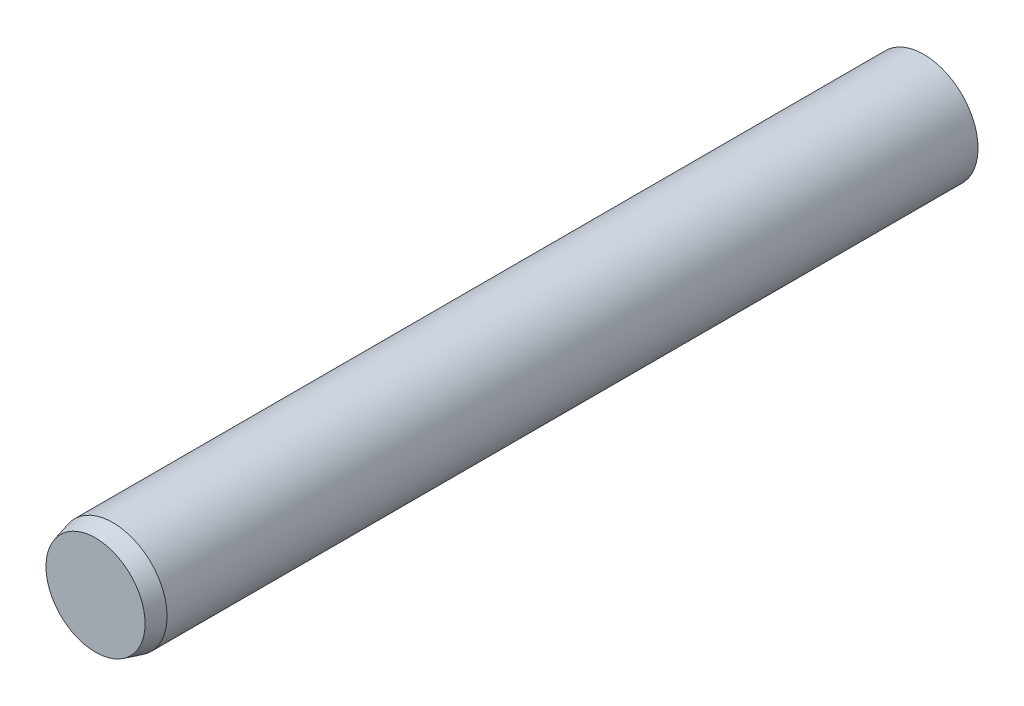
ISO-10303-21;
HEADER;
FILE_DESCRIPTION(('STEP AP214'),'2;1');
FILE_NAME('part.step','',(''),(''),'','','');
FILE_SCHEMA(('AUTOMOTIVE_DESIGN { 1 0 10303 214 1 1 1 1 }'));
ENDSEC;
DATA;
#1=APPLICATION_CONTEXT('core data for automotive mechanical design processes');
#2=APPLICATION_PROTOCOL_DEFINITION('international standard','automotive_design',2000,#1);
#3=PRODUCT_CONTEXT('',#1,'mechanical');
#4=PRODUCT('Part','Part','',(#3));
#5=PRODUCT_RELATED_PRODUCT_CATEGORY('part','',(#4));
#6=PRODUCT_DEFINITION_FORMATION('','',#4);
#7=PRODUCT_DEFINITION_CONTEXT('part definition',#1,'design');
#8=PRODUCT_DEFINITION('design','',#6,#7);
#9=PRODUCT_DEFINITION_SHAPE('','',#8);
#10=(LENGTH_UNIT() NAMED_UNIT(*) SI_UNIT(.MILLI.,.METRE.));
#11=(NAMED_UNIT(*) PLANE_ANGLE_UNIT() SI_UNIT($,.RADIAN.));
#12=(NAMED_UNIT(*) SI_UNIT($,.STERADIAN.) SOLID_ANGLE_UNIT());
#13=UNCERTAINTY_MEASURE_WITH_UNIT(LENGTH_MEASURE(1.E-05),#10,'distance_accuracy_value','');
#14=(GEOMETRIC_REPRESENTATION_CONTEXT(3) GLOBAL_UNCERTAINTY_ASSIGNED_CONTEXT((#13)) GLOBAL_UNIT_ASSIGNED_CONTEXT((#10,
#11,#12)) REPRESENTATION_CONTEXT('',''));
#15=CARTESIAN_POINT('',(0.,0.,0.));
#16=DIRECTION('',(0.,0.,1.));
#17=DIRECTION('',(1.,0.,0.));
#18=AXIS2_PLACEMENT_3D('',#15,#16,#17);
#19=CARTESIAN_POINT('',(0.,0.,15.25));
#20=DIRECTION('',(0.,0.,1.));
#21=DIRECTION('',(-1.,0.,0.));
#22=AXIS2_PLACEMENT_3D('',#19,#20,#21);
#23=ELLIPSE('',#22,1.98437500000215,1.98421113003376);
#24=DIRECTION('',(0.,0.,-1.));
#25=VECTOR('',#24,1.);
#26=SURFACE_OF_LINEAR_EXTRUSION('',#23,#25);
#27=CARTESIAN_POINT('',(0.,0.,-15.0798522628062));
#28=DIRECTION('',(0.,0.,1.));
#29=DIRECTION('',(-1.,0.,0.));
#30=AXIS2_PLACEMENT_3D('',#27,#28,#29);
#31=ELLIPSE('',#30,1.98437500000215,1.98421113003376);
#32=CARTESIAN_POINT('',(-1.98437500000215,0.,-15.0798522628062));
#33=VERTEX_POINT('',#32);
#34=EDGE_CURVE('E47',#33,#33,#31,.T.);
#35=ORIENTED_EDGE('',*,*,#34,.T.);
#36=EDGE_LOOP('',(#35));
#37=FACE_BOUND('',#36,.T.);
#38=CARTESIAN_POINT('',(0.,0.,14.615));
#39=DIRECTION('',(0.,0.,-1.));
#40=DIRECTION('',(-1.,0.,0.));
#41=AXIS2_PLACEMENT_3D('',#38,#39,#40);
#42=ELLIPSE('',#41,1.98437500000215,1.98421113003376);
#43=CARTESIAN_POINT('',(-1.98437500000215,0.,14.615));
#44=VERTEX_POINT('',#43);
#45=EDGE_CURVE('E52',#44,#44,#42,.T.);
#46=ORIENTED_EDGE('',*,*,#45,.T.);
#47=EDGE_LOOP('',(#46));
#48=FACE_BOUND('',#47,.T.);
#49=ADVANCED_FACE('F30',(#37,#48),#26,.F.);
#50=CARTESIAN_POINT('',(0.,0.,15.25));
#51=DIRECTION('',(0.,0.,1.));
#52=DIRECTION('',(1.,0.,0.));
#53=AXIS2_PLACEMENT_3D('',#50,#51,#52);
#54=PLANE('',#53);
#55=CARTESIAN_POINT('',(-1.81422726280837,0.,15.2500000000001));
#56=CARTESIAN_POINT('',(-1.81422745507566,0.0152652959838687,15.2500000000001));
#57=CARTESIAN_POINT('',(-1.81403506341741,0.0305306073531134,15.2500000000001));
#58=CARTESIAN_POINT('',(-1.81326529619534,0.0610367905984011,15.2500000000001));
#59=CARTESIAN_POINT('',(-1.81268829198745,0.0762776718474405,15.2500000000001));
#60=CARTESIAN_POINT('',(-1.81114973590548,0.106735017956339,15.2500000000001));
#61=CARTESIAN_POINT('',(-1.8101883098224,0.121951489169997,15.2500000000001));
#62=CARTESIAN_POINT('',(-1.80788180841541,0.15236006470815,15.2500000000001));
#63=CARTESIAN_POINT('',(-1.80653661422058,0.167552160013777,15.2500000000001));
#64=CARTESIAN_POINT('',(-1.80346254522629,0.197912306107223,15.2500000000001));
#65=CARTESIAN_POINT('',(-1.80173330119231,0.21308031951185,15.2500000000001));
#66=CARTESIAN_POINT('',(-1.79788905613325,0.243391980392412,15.2500000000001));
#67=CARTESIAN_POINT('',(-1.79577344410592,0.258535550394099,15.2500000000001));
#68=CARTESIAN_POINT('',(-1.79115456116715,0.288797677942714,15.2500000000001));
#69=CARTESIAN_POINT('',(-1.78865044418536,0.303916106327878,15.2500000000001));
#70=CARTESIAN_POINT('',(-1.78325345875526,0.334127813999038,15.2500000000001));
#71=CARTESIAN_POINT('',(-1.78035950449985,0.349220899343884,15.2500000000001));
#72=CARTESIAN_POINT('',(-1.77417671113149,0.379382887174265,15.2500000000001));
#73=CARTESIAN_POINT('',(-1.77088648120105,0.394451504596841,15.2500000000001));
#74=CARTESIAN_POINT('',(-1.76391868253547,0.424519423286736,15.2500000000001));
#75=CARTESIAN_POINT('',(-1.7602406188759,0.43951860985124,15.2500000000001));
#76=CARTESIAN_POINT('',(-1.75251702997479,0.469362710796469,15.2500000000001));
#77=CARTESIAN_POINT('',(-1.74847291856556,0.484207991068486,15.2500000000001));
#78=CARTESIAN_POINT('',(-1.74002147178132,0.513744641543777,15.2500000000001));
#79=CARTESIAN_POINT('',(-1.73561531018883,0.528436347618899,15.2500000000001));
#80=CARTESIAN_POINT('',(-1.72644297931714,0.557667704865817,15.2500000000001));
#81=CARTESIAN_POINT('',(-1.72167771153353,0.572207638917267,15.2500000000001));
#82=CARTESIAN_POINT('',(-1.71178974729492,0.601136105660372,15.2500000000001));
#83=CARTESIAN_POINT('',(-1.70666771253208,0.615524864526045,15.2500000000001));
#84=CARTESIAN_POINT('',(-1.69606809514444,0.644151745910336,15.2500000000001));
#85=CARTESIAN_POINT('',(-1.69059093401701,0.658390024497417,15.2500000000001));
#86=CARTESIAN_POINT('',(-1.67928217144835,0.6867164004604,15.2500000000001));
#87=CARTESIAN_POINT('',(-1.67345075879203,0.700804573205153,15.2500000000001));
#88=CARTESIAN_POINT('',(-1.66143394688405,0.728830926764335,15.2500000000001));
#89=CARTESIAN_POINT('',(-1.65524850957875,0.742769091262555,15.2500000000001));
#90=CARTESIAN_POINT('',(-1.64252343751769,0.770495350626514,15.2500000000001));
#91=CARTESIAN_POINT('',(-1.63598354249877,0.784283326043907,15.2500000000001));
#92=CARTESIAN_POINT('',(-1.62254862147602,0.811708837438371,15.2500000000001));
#93=CARTESIAN_POINT('',(-1.61565311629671,0.82534613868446,15.2500000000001));
#94=CARTESIAN_POINT('',(-1.60150500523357,0.852470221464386,15.2500000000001));
#95=CARTESIAN_POINT('',(-1.59425168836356,0.865956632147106,15.2500000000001));
#96=CARTESIAN_POINT('',(-1.57938611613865,0.892777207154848,15.2500000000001));
#97=CARTESIAN_POINT('',(-1.57177295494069,0.906110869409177,15.2500000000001));
#98=CARTESIAN_POINT('',(-1.5561858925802,0.932622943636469,15.2500000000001));
#99=CARTESIAN_POINT('',(-1.54821091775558,0.945800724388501,15.2500000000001));
#100=CARTESIAN_POINT('',(-1.53190301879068,0.971988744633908,15.2500000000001));
#101=CARTESIAN_POINT('',(-1.52356907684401,0.984998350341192,15.2500000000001));
#102=CARTESIAN_POINT('',(-1.50659680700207,1.01076175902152,15.2500000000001));
#103=CARTESIAN_POINT('',(-1.49795946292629,1.02351621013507,15.2500000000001));
#104=CARTESIAN_POINT('',(-1.48039201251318,1.04875940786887,15.2500000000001));
#105=CARTESIAN_POINT('',(-1.47146296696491,1.06124889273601,15.2500000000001));
#106=CARTESIAN_POINT('',(-1.45331504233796,1.0859638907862,15.2500000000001));
#107=CARTESIAN_POINT('',(-1.444097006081,1.0981900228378,15.2500000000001));
#108=CARTESIAN_POINT('',(-1.42537311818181,1.12238051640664,15.2500000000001));
#109=CARTESIAN_POINT('',(-1.41586788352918,1.13434535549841,15.2500000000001));
#110=CARTESIAN_POINT('',(-1.39657166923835,1.15801511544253,15.2500000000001));
#111=CARTESIAN_POINT('',(-1.38678109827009,1.16972036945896,15.2500000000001));
#112=CARTESIAN_POINT('',(-1.36691502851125,1.19287170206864,15.2500000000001));
#113=CARTESIAN_POINT('',(-1.3568397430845,1.20431796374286,15.2500000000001));
#114=CARTESIAN_POINT('',(-1.33640430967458,1.22695135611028,15.2500000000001));
#115=CARTESIAN_POINT('',(-1.32604418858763,1.23813851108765,15.2500000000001));
#116=CARTESIAN_POINT('',(-1.30503944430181,1.26025401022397,15.2500000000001));
#117=CARTESIAN_POINT('',(-1.29439466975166,1.27118221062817,15.2500000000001));
#118=CARTESIAN_POINT('',(-1.27282048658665,1.29277973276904,15.2500000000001));
#119=CARTESIAN_POINT('',(-1.26189075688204,1.3034487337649,15.2500000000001));
#120=CARTESIAN_POINT('',(-1.23974507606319,1.32452645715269,15.2500000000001));
#121=CARTESIAN_POINT('',(-1.2285286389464,1.33493466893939,15.2500000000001));
#122=CARTESIAN_POINT('',(-1.20580695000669,1.35548995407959,15.2500000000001));
#123=CARTESIAN_POINT('',(-1.19430103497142,1.3656362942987,15.2500000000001));
#124=CARTESIAN_POINT('',(-1.17100139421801,1.38566414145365,15.2500000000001));
#125=CARTESIAN_POINT('',(-1.15920691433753,1.39554477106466,15.2500000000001));
#126=CARTESIAN_POINT('',(-1.13532662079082,1.41503739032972,15.2500000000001));
#127=CARTESIAN_POINT('',(-1.12323990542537,1.4246482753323,15.2500000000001));
#128=CARTESIAN_POINT('',(-1.09884039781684,1.44354750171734,15.2500000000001));
#129=CARTESIAN_POINT('',(-1.08652789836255,1.45283622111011,15.2500000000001));
#130=CARTESIAN_POINT('',(-1.06171462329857,1.47106333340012,15.2500000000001));
#131=CARTESIAN_POINT('',(-1.04921468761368,1.48000286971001,15.2500000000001));
#132=CARTESIAN_POINT('',(-1.02402717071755,1.49753719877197,15.2500000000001));
#133=CARTESIAN_POINT('',(-1.01134021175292,1.50613288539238,15.2500000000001));
#134=CARTESIAN_POINT('',(-0.985781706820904,1.52298064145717,15.2500000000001));
#135=CARTESIAN_POINT('',(-0.972910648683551,1.53123345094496,15.2500000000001));
#136=CARTESIAN_POINT('',(-0.946984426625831,1.54739834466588,15.2500000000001));
#137=CARTESIAN_POINT('',(-0.933929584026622,1.55531094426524,15.2500000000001));
#138=CARTESIAN_POINT('',(-0.907636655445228,1.57079697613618,15.2500000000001));
#139=CARTESIAN_POINT('',(-0.894398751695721,1.5783707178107,15.2500000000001));
#140=CARTESIAN_POINT('',(-0.867740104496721,1.5931797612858,15.2500000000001));
#141=CARTESIAN_POINT('',(-0.854319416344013,1.60041516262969,15.2500000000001));
#142=CARTESIAN_POINT('',(-0.827295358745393,1.61454782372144,15.25));
#143=CARTESIAN_POINT('',(-0.813691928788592,1.62144496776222,15.2500000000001));
#144=CARTESIAN_POINT('',(-0.786302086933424,1.63490058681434,15.2500000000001));
#145=CARTESIAN_POINT('',(-0.772515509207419,1.64145872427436,15.2500000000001));
#146=CARTESIAN_POINT('',(-0.744758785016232,1.65423530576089,15.2500000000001));
#147=CARTESIAN_POINT('',(-0.730788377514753,1.66045318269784,15.2500000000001));
#148=CARTESIAN_POINT('',(-0.702662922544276,1.67254745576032,15.2500000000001));
#149=CARTESIAN_POINT('',(-0.68850752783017,1.67842304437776,15.2500000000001));
#150=CARTESIAN_POINT('',(-0.660010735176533,1.68983028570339,15.2500000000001));
#151=CARTESIAN_POINT('',(-0.645668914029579,1.69536088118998,15.2500000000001));
#152=CARTESIAN_POINT('',(-0.616796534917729,1.70607563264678,15.2500000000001));
#153=CARTESIAN_POINT('',(-0.602265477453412,1.71125844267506,15.2500000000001));
#154=CARTESIAN_POINT('',(-0.573063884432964,1.72125586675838,15.2500000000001));
#155=CARTESIAN_POINT('',(-0.558393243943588,1.7260701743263,15.25));
#156=CARTESIAN_POINT('',(-0.528989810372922,1.73530485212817,15.25));
#157=CARTESIAN_POINT('',(-0.514257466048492,1.73972665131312,15.2500000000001));
#158=CARTESIAN_POINT('',(-0.484727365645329,1.74818248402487,15.2500000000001));
#159=CARTESIAN_POINT('',(-0.469929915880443,1.75221758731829,15.2500000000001));
#160=CARTESIAN_POINT('',(-0.440274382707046,1.75990160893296,15.2500000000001));
#161=CARTESIAN_POINT('',(-0.425416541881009,1.7635514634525,15.2500000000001));
#162=CARTESIAN_POINT('',(-0.39563996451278,1.77046789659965,15.2500000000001));
#163=CARTESIAN_POINT('',(-0.380721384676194,1.77373514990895,15.2500000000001));
#164=CARTESIAN_POINT('',(-0.350823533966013,1.77988873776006,15.2500000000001));
#165=CARTESIAN_POINT('',(-0.335844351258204,1.78277550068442,15.2500000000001));
#166=CARTESIAN_POINT('',(-0.305825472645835,1.78816920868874,15.2500000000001));
#167=CARTESIAN_POINT('',(-0.290785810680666,1.7906763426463,15.2500000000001));
#168=CARTESIAN_POINT('',(-0.260645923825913,1.79531046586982,15.2500000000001));
#169=CARTESIAN_POINT('',(-0.24554569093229,1.79743740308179,15.2500000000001));
#170=CARTESIAN_POINT('',(-0.215284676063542,1.80131117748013,15.2500000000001));
#171=CARTESIAN_POINT('',(-0.200123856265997,1.80305771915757,15.2500000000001));
#172=CARTESIAN_POINT('',(-0.16974158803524,1.80617054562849,15.2500000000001));
#173=CARTESIAN_POINT('',(-0.154520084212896,1.80753628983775,15.2500000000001));
#174=CARTESIAN_POINT('',(-0.124016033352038,1.80988496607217,15.2500000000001));
#175=CARTESIAN_POINT('',(-0.108733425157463,1.81086710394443,15.2500000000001));
#176=CARTESIAN_POINT('',(-0.0781078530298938,1.81244638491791,15.2500000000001));
#177=CARTESIAN_POINT('',(-0.0627648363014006,1.81304250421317,15.2500000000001));
#178=CARTESIAN_POINT('',(-0.0320145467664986,1.81384641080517,15.2500000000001));
#179=CARTESIAN_POINT('',(-0.0166072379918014,1.81405282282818,15.2500000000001));
#180=CARTESIAN_POINT('',(0.0142482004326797,1.81407319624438,15.2500000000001));
#181=CARTESIAN_POINT('',(0.0296963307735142,1.81388612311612,15.2500000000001));
#182=CARTESIAN_POINT('',(0.0605347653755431,1.81311865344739,15.2500000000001));
#183=CARTESIAN_POINT('',(0.0759251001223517,1.81253948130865,15.2500000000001));
#184=CARTESIAN_POINT('',(0.106635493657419,1.81099211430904,15.2500000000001));
#185=CARTESIAN_POINT('',(0.121955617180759,1.81002520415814,15.2500000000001));
#186=CARTESIAN_POINT('',(0.152525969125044,1.8077058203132,15.2500000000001));
#187=CARTESIAN_POINT('',(0.167776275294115,1.80635437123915,15.2500000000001));
#188=CARTESIAN_POINT('',(0.198206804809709,1.80326942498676,15.2500000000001));
#189=CARTESIAN_POINT('',(0.213387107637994,1.80153671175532,15.2500000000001));
#190=CARTESIAN_POINT('',(0.243679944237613,1.79769082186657,15.2500000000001));
#191=CARTESIAN_POINT('',(0.258792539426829,1.79557812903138,15.2500000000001));
#192=CARTESIAN_POINT('',(0.288949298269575,1.79097324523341,15.2500000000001));
#193=CARTESIAN_POINT('',(0.303993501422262,1.78848131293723,15.2500000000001));
#194=CARTESIAN_POINT('',(0.334012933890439,1.78311935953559,15.2500000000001));
#195=CARTESIAN_POINT('',(0.348988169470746,1.78024937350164,15.2500000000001));
#196=CARTESIAN_POINT('',(0.378869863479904,1.77413136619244,15.2500000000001));
#197=CARTESIAN_POINT('',(0.393776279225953,1.77088313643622,15.2500000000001));
#198=CARTESIAN_POINT('',(0.423520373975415,1.76400748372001,15.2500000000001));
#199=CARTESIAN_POINT('',(0.438357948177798,1.76037960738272,15.2500000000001));
#200=CARTESIAN_POINT('',(0.467964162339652,1.75274335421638,15.2500000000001));
#201=CARTESIAN_POINT('',(0.482732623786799,1.74873428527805,15.2500000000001));
#202=CARTESIAN_POINT('',(0.512199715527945,1.74033341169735,15.2500000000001));
#203=CARTESIAN_POINT('',(0.526898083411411,1.7359406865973,15.2500000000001));
#204=CARTESIAN_POINT('',(0.556223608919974,1.72676989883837,15.2500000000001));
#205=CARTESIAN_POINT('',(0.570850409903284,1.72199069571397,15.2500000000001));
#206=CARTESIAN_POINT('',(0.600033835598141,1.71204245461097,15.2500000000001));
#207=CARTESIAN_POINT('',(0.614589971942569,1.70687198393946,15.2500000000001));
#208=CARTESIAN_POINT('',(0.64354024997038,1.69617046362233,15.2500000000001));
#209=CARTESIAN_POINT('',(0.657934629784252,1.69064005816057,15.2500000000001));
#210=CARTESIAN_POINT('',(0.686527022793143,1.67923429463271,15.2500000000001));
#211=CARTESIAN_POINT('',(0.700725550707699,1.67336022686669,15.2500000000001));
#212=CARTESIAN_POINT('',(0.728928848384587,1.66127043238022,15.2500000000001));
#213=CARTESIAN_POINT('',(0.742934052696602,1.65505571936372,15.2500000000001));
#214=CARTESIAN_POINT('',(0.770751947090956,1.64228759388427,15.2500000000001));
#215=CARTESIAN_POINT('',(0.784564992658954,1.63573495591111,15.2500000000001));
#216=CARTESIAN_POINT('',(0.811999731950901,1.62229301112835,15.2500000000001));
#217=CARTESIAN_POINT('',(0.825621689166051,1.61540424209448,15.2500000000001));
#218=CARTESIAN_POINT('',(0.85267521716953,1.60129166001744,15.2500000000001));
#219=CARTESIAN_POINT('',(0.866106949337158,1.59406815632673,15.2500000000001));
#220=CARTESIAN_POINT('',(0.892780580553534,1.57928707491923,15.2500000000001));
#221=CARTESIAN_POINT('',(0.906022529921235,1.57172958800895,15.2500000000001));
#222=CARTESIAN_POINT('',(0.932316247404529,1.5562799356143,15.2500000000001));
#223=CARTESIAN_POINT('',(0.945367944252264,1.54838764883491,15.2500000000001));
#224=CARTESIAN_POINT('',(0.971280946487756,1.53226806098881,15.2500000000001));
#225=CARTESIAN_POINT('',(0.984142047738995,1.52404043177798,15.2500000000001));
#226=CARTESIAN_POINT('',(1.00967409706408,1.50724980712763,15.2500000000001));
#227=CARTESIAN_POINT('',(1.02234469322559,1.49868627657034,15.2500000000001));
#228=CARTESIAN_POINT('',(1.04749464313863,1.48122137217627,15.2500000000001));
#229=CARTESIAN_POINT('',(1.05997348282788,1.47231925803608,15.2500000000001));
#230=CARTESIAN_POINT('',(1.08473737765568,1.45417478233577,15.2500000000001));
#231=CARTESIAN_POINT('',(1.09702176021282,1.44493150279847,15.2500000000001));
#232=CARTESIAN_POINT('',(1.12139420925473,1.4261023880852,15.2500000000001));
#233=CARTESIAN_POINT('',(1.13348143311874,1.41651546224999,15.2500000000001));
#234=CARTESIAN_POINT('',(1.15741763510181,1.39702923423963,15.2500000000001));
#235=CARTESIAN_POINT('',(1.16926641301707,1.38712968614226,15.2500000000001));
#236=CARTESIAN_POINT('',(1.19266323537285,1.3670691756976,15.2500000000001));
#237=CARTESIAN_POINT('',(1.2042122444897,1.35690933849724,15.2500000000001));
#238=CARTESIAN_POINT('',(1.22701222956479,1.33633074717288,15.2500000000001));
#239=CARTESIAN_POINT('',(1.23826401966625,1.3259128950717,15.2500000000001));
#240=CARTESIAN_POINT('',(1.2604732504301,1.30482028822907,15.2500000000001));
#241=CARTESIAN_POINT('',(1.27143132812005,1.29414620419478,15.2500000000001));
#242=CARTESIAN_POINT('',(1.2930560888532,1.27254354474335,15.2500000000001));
#243=CARTESIAN_POINT('',(1.30372324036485,1.26161543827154,15.2500000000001));
#244=CARTESIAN_POINT('',(1.32476635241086,1.23950550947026,15.2500000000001));
#245=CARTESIAN_POINT('',(1.33514262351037,1.22832398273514,15.2500000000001));
#246=CARTESIAN_POINT('',(1.35560457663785,1.20570778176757,15.2500000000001));
#247=CARTESIAN_POINT('',(1.36569039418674,1.1942732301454,15.2500000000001));
#248=CARTESIAN_POINT('',(1.38557221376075,1.17115164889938,15.2500000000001));
#249=CARTESIAN_POINT('',(1.39536816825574,1.15946457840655,15.2500000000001));
#250=CARTESIAN_POINT('',(1.41467078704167,1.13583747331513,15.2500000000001));
#251=CARTESIAN_POINT('',(1.42417720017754,1.12389723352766,15.2500000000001));
#252=CARTESIAN_POINT('',(1.44289902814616,1.09976292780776,15.2500000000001));
#253=CARTESIAN_POINT('',(1.45211399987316,1.08756851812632,15.2500000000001));
#254=CARTESIAN_POINT('',(1.47025086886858,1.06292571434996,15.2500000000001));
#255=CARTESIAN_POINT('',(1.47917213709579,1.05047685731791,15.2500000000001));
#256=CARTESIAN_POINT('',(1.49672063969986,1.02532493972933,15.2500000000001));
#257=CARTESIAN_POINT('',(1.50534704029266,1.01262129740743,15.2500000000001));
#258=CARTESIAN_POINT('',(1.52230373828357,0.98695256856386,15.2500000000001));
#259=CARTESIAN_POINT('',(1.5306328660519,0.973986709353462,15.2500000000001));
#260=CARTESIAN_POINT('',(1.54697879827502,0.947814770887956,15.2500000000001));
#261=CARTESIAN_POINT('',(1.5549947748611,0.934608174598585,15.2500000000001));
#262=CARTESIAN_POINT('',(1.57066111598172,0.908037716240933,15.2500000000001));
#263=CARTESIAN_POINT('',(1.57831258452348,0.894674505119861,15.2500000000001));
#264=CARTESIAN_POINT('',(1.59324859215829,0.86780124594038,15.2500000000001));
#265=CARTESIAN_POINT('',(1.60053424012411,0.854291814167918,15.2500000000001));
#266=CARTESIAN_POINT('',(1.61474176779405,0.827127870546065,15.2500000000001));
#267=CARTESIAN_POINT('',(1.62166454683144,0.813473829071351,15.2500000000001));
#268=CARTESIAN_POINT('',(1.6351490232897,0.786021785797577,15.2500000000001));
#269=CARTESIAN_POINT('',(1.64171140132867,0.772224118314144,15.2500000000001));
#270=CARTESIAN_POINT('',(1.65447709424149,0.744485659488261,15.2500000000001));
#271=CARTESIAN_POINT('',(1.66068087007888,0.73054508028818,15.2500000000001));
#272=CARTESIAN_POINT('',(1.67273069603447,0.702521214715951,15.2500000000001));
#273=CARTESIAN_POINT('',(1.67857698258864,0.688438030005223,15.2500000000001));
#274=CARTESIAN_POINT('',(1.68991288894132,0.660128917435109,15.2500000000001));
#275=CARTESIAN_POINT('',(1.69540251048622,0.645902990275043,15.2500000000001));
#276=CARTESIAN_POINT('',(1.70602400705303,0.617308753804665,15.2500000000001));
#277=CARTESIAN_POINT('',(1.71115567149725,0.6029403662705,15.2500000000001));
#278=CARTESIAN_POINT('',(1.72106038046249,0.57406183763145,15.2500000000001));
#279=CARTESIAN_POINT('',(1.72583300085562,0.55955155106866,15.2500000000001));
#280=CARTESIAN_POINT('',(1.73501927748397,0.530388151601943,15.2500000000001));
#281=CARTESIAN_POINT('',(1.73943225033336,0.515734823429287,15.2500000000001));
#282=CARTESIAN_POINT('',(1.74789682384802,0.486282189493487,15.2500000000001));
#283=CARTESIAN_POINT('',(1.75194743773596,0.471482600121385,15.2500000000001));
#284=CARTESIAN_POINT('',(1.75968405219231,0.441739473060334,15.2500000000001));
#285=CARTESIAN_POINT('',(1.76336888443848,0.426795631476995,15.2500000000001));
#286=CARTESIAN_POINT('',(1.77036947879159,0.396765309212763,15.2500000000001));
#287=CARTESIAN_POINT('',(1.77368387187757,0.381678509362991,15.25));
#288=CARTESIAN_POINT('',(1.77992455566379,0.351433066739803,15.25));
#289=CARTESIAN_POINT('',(1.78285104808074,0.336274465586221,15.2500000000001));
#290=CARTESIAN_POINT('',(1.78831073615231,0.305917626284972,15.2500000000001));
#291=CARTESIAN_POINT('',(1.79084470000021,0.290719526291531,15.2500000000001));
#292=CARTESIAN_POINT('',(1.79552189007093,0.260281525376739,15.2500000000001));
#293=CARTESIAN_POINT('',(1.79766557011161,0.245041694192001,15.2500000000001));
#294=CARTESIAN_POINT('',(1.80156315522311,0.214520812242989,15.2500000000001));
#295=CARTESIAN_POINT('',(1.80331727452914,0.199239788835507,15.2500000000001));
#296=CARTESIAN_POINT('',(1.8064368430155,0.168636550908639,15.2500000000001));
#297=CARTESIAN_POINT('',(1.8078022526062,0.153314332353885,15.2500000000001));
#298=CARTESIAN_POINT('',(1.81014380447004,0.122628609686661,15.2500000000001));
#299=CARTESIAN_POINT('',(1.81111965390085,0.107265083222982,15.2500000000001));
#300=CARTESIAN_POINT('',(1.81268044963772,0.0764968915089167,15.2500000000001));
#301=CARTESIAN_POINT('',(1.81326485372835,0.0610921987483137,15.2500000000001));
#302=CARTESIAN_POINT('',(1.81404136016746,0.0302418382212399,15.2500000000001));
#303=CARTESIAN_POINT('',(1.81423266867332,0.0147961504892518,15.2500000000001));
#304=CARTESIAN_POINT('',(1.81422162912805,-0.0160818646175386,15.2500000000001));
#305=CARTESIAN_POINT('',(1.81401961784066,-0.0315141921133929,15.2500000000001));
#306=CARTESIAN_POINT('',(1.81322308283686,-0.0623117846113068,15.2500000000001));
#307=CARTESIAN_POINT('',(1.81263000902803,-0.0776770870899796,15.2500000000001));
#308=CARTESIAN_POINT('',(1.81105512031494,-0.108341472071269,15.2500000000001));
#309=CARTESIAN_POINT('',(1.81007447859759,-0.123640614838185,15.2500000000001));
#310=CARTESIAN_POINT('',(1.80772838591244,-0.154173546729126,15.2500000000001));
#311=CARTESIAN_POINT('',(1.80636383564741,-0.169407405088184,15.2500000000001));
#312=CARTESIAN_POINT('',(1.80325335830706,-0.199810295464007,15.2500000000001));
#313=CARTESIAN_POINT('',(1.80150807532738,-0.214979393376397,15.2500000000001));
#314=CARTESIAN_POINT('',(1.79763677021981,-0.245252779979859,15.2500000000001));
#315=CARTESIAN_POINT('',(1.79551114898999,-0.260357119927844,15.2500000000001));
#316=CARTESIAN_POINT('',(1.79088001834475,-0.290501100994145,15.2500000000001));
#317=CARTESIAN_POINT('',(1.78837466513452,-0.305540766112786,15.25));
#318=CARTESIAN_POINT('',(1.78298515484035,-0.335555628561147,15.25));
#319=CARTESIAN_POINT('',(1.78010091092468,-0.350530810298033,15.2500000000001));
#320=CARTESIAN_POINT('',(1.77395320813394,-0.380417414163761,15.2500000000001));
#321=CARTESIAN_POINT('',(1.77068940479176,-0.395328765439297,15.2500000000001));
#322=CARTESIAN_POINT('',(1.76378091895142,-0.425086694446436,15.2500000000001));
#323=CARTESIAN_POINT('',(1.76013566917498,-0.439933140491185,15.2500000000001));
#324=CARTESIAN_POINT('',(1.75246296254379,-0.46955972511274,15.2500000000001));
#325=CARTESIAN_POINT('',(1.74843473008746,-0.484339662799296,15.2500000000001));
#326=CARTESIAN_POINT('',(1.7399948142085,-0.513833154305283,15.2500000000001));
#327=CARTESIAN_POINT('',(1.73558211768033,-0.528546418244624,15.2500000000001));
#328=CARTESIAN_POINT('',(1.72636641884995,-0.557909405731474,15.2500000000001));
#329=CARTESIAN_POINT('',(1.72156204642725,-0.572558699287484,15.2500000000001));
#330=CARTESIAN_POINT('',(1.71157236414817,-0.601758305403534,15.2500000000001));
#331=CARTESIAN_POINT('',(1.70638633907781,-0.616308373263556,15.2500000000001));
#332=CARTESIAN_POINT('',(1.69566280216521,-0.645220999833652,15.2500000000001));
#333=CARTESIAN_POINT('',(1.69012657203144,-0.65958403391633,15.2500000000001));
#334=CARTESIAN_POINT('',(1.67870853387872,-0.688119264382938,15.2500000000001));
#335=CARTESIAN_POINT('',(1.67282787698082,-0.702291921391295,15.2500000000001));
#336=CARTESIAN_POINT('',(1.66072421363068,-0.73044761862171,15.2500000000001));
#337=CARTESIAN_POINT('',(1.65450211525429,-0.744431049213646,15.2500000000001));
#338=CARTESIAN_POINT('',(1.64171816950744,-0.772209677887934,15.2500000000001));
#339=CARTESIAN_POINT('',(1.63515698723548,-0.786005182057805,15.2500000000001));
#340=CARTESIAN_POINT('',(1.62169661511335,-0.813408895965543,15.2500000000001));
#341=CARTESIAN_POINT('',(1.61479785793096,-0.827017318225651,15.2500000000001));
#342=CARTESIAN_POINT('',(1.60066355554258,-0.854047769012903,15.2500000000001));
#343=CARTESIAN_POINT('',(1.59342821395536,-0.867469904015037,15.2500000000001));
#344=CARTESIAN_POINT('',(1.5786211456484,-0.89412842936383,15.2500000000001));
#345=CARTESIAN_POINT('',(1.57104939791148,-0.907364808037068,15.2500000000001));
#346=CARTESIAN_POINT('',(1.55556923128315,-0.933650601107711,15.2500000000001));
#347=CARTESIAN_POINT('',(1.54766060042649,-0.946699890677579,15.2500000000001));
#348=CARTESIAN_POINT('',(1.53150676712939,-0.972610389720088,15.2500000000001));
#349=CARTESIAN_POINT('',(1.52326116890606,-0.98547135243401,15.2500000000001));
#350=CARTESIAN_POINT('',(1.50643160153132,-1.0110061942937,15.2500000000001));
#351=CARTESIAN_POINT('',(1.49784699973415,-1.02367965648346,15.2500000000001));
#352=CARTESIAN_POINT('',(1.4803361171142,-1.04883872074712,15.2500000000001));
#353=CARTESIAN_POINT('',(1.47140898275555,-1.06132372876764,15.2500000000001));
#354=CARTESIAN_POINT('',(1.45321186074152,-1.08610282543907,15.2500000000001));
#355=CARTESIAN_POINT('',(1.44394086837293,-1.09839617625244,15.2500000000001));
#356=CARTESIAN_POINT('',(1.42505789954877,-1.12278290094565,15.2500000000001));
#357=CARTESIAN_POINT('',(1.41544490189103,-1.13487548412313,15.2500000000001));
#358=CARTESIAN_POINT('',(1.39593545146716,-1.1587837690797,15.2500000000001));
#359=CARTESIAN_POINT('',(1.386039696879,-1.17060004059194,15.2500000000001));
#360=CARTESIAN_POINT('',(1.36598595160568,-1.19393513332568,15.2500000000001));
#361=CARTESIAN_POINT('',(1.3558290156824,-1.20545486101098,15.2500000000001));
#362=CARTESIAN_POINT('',(1.3352537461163,-1.22820200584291,15.2500000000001));
#363=CARTESIAN_POINT('',(1.32483619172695,-1.23943012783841,15.2500000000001));
#364=CARTESIAN_POINT('',(1.30374207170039,-1.26159554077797,15.2500000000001));
#365=CARTESIAN_POINT('',(1.2930660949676,-1.2725333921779,15.2500000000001));
#366=CARTESIAN_POINT('',(1.27145721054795,-1.29412050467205,15.2500000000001));
#367=CARTESIAN_POINT('',(1.26052469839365,-1.30477016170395,15.2500000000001));
#368=CARTESIAN_POINT('',(1.23840335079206,-1.32578157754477,15.2500000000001));
#369=CARTESIAN_POINT('',(1.22721473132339,-1.33614356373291,15.2500000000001));
#370=CARTESIAN_POINT('',(1.20458140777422,-1.35657987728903,15.2500000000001));
#371=CARTESIAN_POINT('',(1.19313674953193,-1.36665425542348,15.2500000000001));
#372=CARTESIAN_POINT('',(1.1699918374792,-1.38651589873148,15.2500000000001));
#373=CARTESIAN_POINT('',(1.15829146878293,-1.39630303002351,15.2500000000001));
#374=CARTESIAN_POINT('',(1.13463491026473,-1.41558997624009,15.2500000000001));
#375=CARTESIAN_POINT('',(1.12267845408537,-1.42508946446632,15.2500000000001));
#376=CARTESIAN_POINT('',(1.0985083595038,-1.44379974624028,15.2500000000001));
#377=CARTESIAN_POINT('',(1.08629430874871,-1.45301000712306,15.2500000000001));
#378=CARTESIAN_POINT('',(1.06160665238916,-1.4711409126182,15.2500000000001));
#379=CARTESIAN_POINT('',(1.04913248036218,-1.48006078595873,15.2500000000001));
#380=CARTESIAN_POINT('',(1.02392679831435,-1.49760641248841,15.2500000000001));
#381=CARTESIAN_POINT('',(1.01119466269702,-1.50623126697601,15.25));
#382=CARTESIAN_POINT('',(0.985465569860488,-1.52318678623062,15.25));
#383=CARTESIAN_POINT('',(0.972467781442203,-1.53151618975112,15.2500000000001));
#384=CARTESIAN_POINT('',(0.946269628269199,-1.54783697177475,15.2500000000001));
#385=CARTESIAN_POINT('',(0.933069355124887,-1.55582849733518,15.2500000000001));
#386=CARTESIAN_POINT('',(0.906517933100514,-1.57144371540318,15.2500000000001));
#387=CARTESIAN_POINT('',(0.893167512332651,-1.57906864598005,15.2500000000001));
#388=CARTESIAN_POINT('',(0.866316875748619,-1.5939546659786,15.2500000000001));
#389=CARTESIAN_POINT('',(0.852817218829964,-1.60121676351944,15.2500000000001));
#390=CARTESIAN_POINT('',(0.825669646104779,-1.61538007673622,15.2500000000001));
#391=CARTESIAN_POINT('',(0.812022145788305,-1.62228208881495,15.2500000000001));
#392=CARTESIAN_POINT('',(0.784579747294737,-1.63572768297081,15.2500000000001));
#393=CARTESIAN_POINT('',(0.770785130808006,-1.64227183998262,15.2500000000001));
#394=CARTESIAN_POINT('',(0.743049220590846,-1.6550034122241,15.2500000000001));
#395=CARTESIAN_POINT('',(0.72910809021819,-1.6611911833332,15.2500000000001));
#396=CARTESIAN_POINT('',(0.701079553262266,-1.67321093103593,15.2500000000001));
#397=CARTESIAN_POINT('',(0.686992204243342,-1.67904304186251,15.2500000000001));
#398=CARTESIAN_POINT('',(0.658671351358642,-1.69035176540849,15.2500000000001));
#399=CARTESIAN_POINT('',(0.644437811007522,-1.6958282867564,15.2500000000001));
#400=CARTESIAN_POINT('',(0.615824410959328,-1.70642546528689,15.2500000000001));
#401=CARTESIAN_POINT('',(0.601444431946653,-1.71154580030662,15.2500000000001));
#402=CARTESIAN_POINT('',(0.572537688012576,-1.72142954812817,15.2500000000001));
#403=CARTESIAN_POINT('',(0.558010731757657,-1.72619240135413,15.25));
#404=CARTESIAN_POINT('',(0.528808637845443,-1.73535948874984,15.25));
#405=CARTESIAN_POINT('',(0.514133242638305,-1.73976290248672,15.2500000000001));
#406=CARTESIAN_POINT('',(0.484634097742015,-1.74820862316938,15.2500000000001));
#407=CARTESIAN_POINT('',(0.469810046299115,-1.75224987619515,15.2500000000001));
#408=CARTESIAN_POINT('',(0.440011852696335,-1.75996785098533,15.2500000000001));
#409=CARTESIAN_POINT('',(0.425037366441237,-1.76364324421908,15.2500000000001));
#410=CARTESIAN_POINT('',(0.394974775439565,-1.77061748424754,15.2500000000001));
#411=CARTESIAN_POINT('',(0.379886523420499,-1.77391569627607,15.2500000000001));
#412=CARTESIAN_POINT('',(0.349684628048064,-1.78011394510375,15.2500000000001));
#413=CARTESIAN_POINT('',(0.334571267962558,-1.78301536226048,15.2500000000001));
#414=CARTESIAN_POINT('',(0.304320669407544,-1.78842538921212,15.2500000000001));
#415=CARTESIAN_POINT('',(0.28918363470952,-1.79093513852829,15.2500000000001));
#416=CARTESIAN_POINT('',(0.258890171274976,-1.79556356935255,15.2500000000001));
#417=CARTESIAN_POINT('',(0.243733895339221,-1.79768325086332,15.2500000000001));
#418=CARTESIAN_POINT('',(0.213400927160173,-1.80153478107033,15.2500000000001));
#419=CARTESIAN_POINT('',(0.198224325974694,-1.80326734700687,15.2500000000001));
#420=CARTESIAN_POINT('',(0.16785078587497,-1.80634719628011,15.2500000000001));
#421=CARTESIAN_POINT('',(0.152653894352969,-1.80769494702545,15.2500000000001));
#422=CARTESIAN_POINT('',(0.122239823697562,-1.81000611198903,15.2500000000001));
#423=CARTESIAN_POINT('',(0.107022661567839,-1.8109697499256,15.2500000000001));
#424=CARTESIAN_POINT('',(0.0765680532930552,-1.81251259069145,15.2500000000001));
#425=CARTESIAN_POINT('',(0.0613306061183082,-1.81309177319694,15.2500000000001));
#426=CARTESIAN_POINT('',(0.0308354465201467,-1.81386600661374,15.2500000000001));
#427=CARTESIAN_POINT('',(0.0155777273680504,-1.81406079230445,15.2500000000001));
#428=CARTESIAN_POINT('',(-0.0149580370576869,-1.81406594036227,15.2500000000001));
#429=CARTESIAN_POINT('',(-0.030236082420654,-1.81387579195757,15.2500000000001));
#430=CARTESIAN_POINT('',(-0.0608126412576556,-1.81310871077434,15.2500000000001));
#431=CARTESIAN_POINT('',(-0.076111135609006,-1.81253101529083,15.2500000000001));
#432=CARTESIAN_POINT('',(-0.106728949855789,-1.81098654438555,15.2500000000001));
#433=CARTESIAN_POINT('',(-0.122048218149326,-1.81001874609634,15.2500000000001));
#434=CARTESIAN_POINT('',(-0.152707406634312,-1.80769115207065,15.2500000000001));
#435=CARTESIAN_POINT('',(-0.168047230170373,-1.8063300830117,15.2500000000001));
#436=CARTESIAN_POINT('',(-0.198736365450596,-1.80321267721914,15.2500000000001));
#437=CARTESIAN_POINT('',(-0.21408554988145,-1.80145508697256,15.2500000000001));
#438=CARTESIAN_POINT('',(-0.244692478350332,-1.79755376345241,15.2500000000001));
#439=CARTESIAN_POINT('',(-0.259950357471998,-1.79541108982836,15.2500000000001));
#440=CARTESIAN_POINT('',(-0.290356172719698,-1.7907455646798,15.2500000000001));
#441=CARTESIAN_POINT('',(-0.305504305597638,-1.78822399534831,15.2500000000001));
#442=CARTESIAN_POINT('',(-0.33569154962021,-1.78280442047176,15.2500000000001));
#443=CARTESIAN_POINT('',(-0.350730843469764,-1.77990743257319,15.2500000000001));
#444=CARTESIAN_POINT('',(-0.380699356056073,-1.77374009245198,15.2500000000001));
#445=CARTESIAN_POINT('',(-0.395628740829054,-1.77047054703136,15.2500000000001));
#446=CARTESIAN_POINT('',(-0.425378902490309,-1.7635601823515,15.2500000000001));
#447=CARTESIAN_POINT('',(-0.440199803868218,-1.75991989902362,15.2500000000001));
#448=CARTESIAN_POINT('',(-0.469733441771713,-1.75226964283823,15.2500000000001));
#449=CARTESIAN_POINT('',(-0.484446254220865,-1.7482599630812,15.2500000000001));
#450=CARTESIAN_POINT('',(-0.513763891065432,-1.73987153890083,15.2500000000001));
#451=CARTESIAN_POINT('',(-0.52836873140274,-1.73549285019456,15.2500000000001));
#452=CARTESIAN_POINT('',(-0.557470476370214,-1.72636656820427,15.2500000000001));
#453=CARTESIAN_POINT('',(-0.571967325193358,-1.72161879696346,15.2500000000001));
#454=CARTESIAN_POINT('',(-0.600852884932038,-1.71175359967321,15.2500000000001));
#455=CARTESIAN_POINT('',(-0.615241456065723,-1.70663576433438,15.2500000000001));
#456=CARTESIAN_POINT('',(-0.643910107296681,-1.69602911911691,15.2500000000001));
#457=CARTESIAN_POINT('',(-0.658189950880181,-1.69053966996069,15.2500000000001));
#458=CARTESIAN_POINT('',(-0.68664018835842,-1.67918781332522,15.2500000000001));
#459=CARTESIAN_POINT('',(-0.700810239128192,-1.67332454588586,15.2500000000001));
#460=CARTESIAN_POINT('',(-0.729040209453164,-1.66122214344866,15.2500000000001));
#461=CARTESIAN_POINT('',(-0.743099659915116,-1.65498191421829,15.2500000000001));
#462=CARTESIAN_POINT('',(-0.77110884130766,-1.64212133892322,15.2500000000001));
#463=CARTESIAN_POINT('',(-0.785057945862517,-1.63549962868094,15.2500000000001));
#464=CARTESIAN_POINT('',(-0.812770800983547,-1.62190855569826,15.2500000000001));
#465=CARTESIAN_POINT('',(-0.826534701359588,-1.61493949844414,15.2500000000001));
#466=CARTESIAN_POINT('',(-0.853829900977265,-1.60067763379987,15.2500000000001));
#467=CARTESIAN_POINT('',(-0.867361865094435,-1.59338609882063,15.2500000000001));
#468=CARTESIAN_POINT('',(-0.89419786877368,-1.57848405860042,15.2500000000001));
#469=CARTESIAN_POINT('',(-0.90750245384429,-1.57087453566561,15.2500000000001));
#470=CARTESIAN_POINT('',(-0.9338849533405,-1.55533798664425,15.2500000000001));
#471=CARTESIAN_POINT('',(-0.946963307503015,-1.54741170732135,15.2500000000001));
#472=CARTESIAN_POINT('',(-0.972894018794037,-1.53124393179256,15.2500000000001));
#473=CARTESIAN_POINT('',(-0.985746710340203,-1.52300297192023,15.2500000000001));
#474=CARTESIAN_POINT('',(-1.01122719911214,-1.50620813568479,15.2500000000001));
#475=CARTESIAN_POINT('',(-1.02385521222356,-1.49765458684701,15.2500000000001));
#476=CARTESIAN_POINT('',(-1.04888719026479,-1.48023503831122,15.2500000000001));
#477=CARTESIAN_POINT('',(-1.06129123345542,-1.47136915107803,15.2500000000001));
#478=CARTESIAN_POINT('',(-1.08587500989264,-1.4533245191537,15.2500000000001));
#479=CARTESIAN_POINT('',(-1.09805467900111,-1.44414568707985,15.2500000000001));
#480=CARTESIAN_POINT('',(-1.12218962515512,-1.42547505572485,15.2500000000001));
#481=CARTESIAN_POINT('',(-1.1341446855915,-1.4159829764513,15.2500000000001));
#482=CARTESIAN_POINT('',(-1.15783026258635,-1.39668553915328,15.2500000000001));
#483=CARTESIAN_POINT('',(-1.16956040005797,-1.38687971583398,15.2500000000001));
#484=CARTESIAN_POINT('',(-1.19279453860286,-1.36695255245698,15.2500000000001));
#485=CARTESIAN_POINT('',(-1.20429798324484,-1.35683056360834,15.2500000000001));
#486=CARTESIAN_POINT('',(-1.22707739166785,-1.33626907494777,15.2500000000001));
#487=CARTESIAN_POINT('',(-1.23835260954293,-1.32582874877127,15.25));
#488=CARTESIAN_POINT('',(-1.26067349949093,-1.30462760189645,15.25));
#489=CARTESIAN_POINT('',(-1.27171821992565,-1.29386577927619,15.2500000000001));
#490=CARTESIAN_POINT('',(-1.29354644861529,-1.2720472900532,15.2500000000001));
#491=CARTESIAN_POINT('',(-1.3043295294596,-1.2609901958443,15.2500000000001));
#492=CARTESIAN_POINT('',(-1.32557147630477,-1.23864457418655,15.2500000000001));
#493=CARTESIAN_POINT('',(-1.33603137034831,-1.227357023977,15.2500000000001));
#494=CARTESIAN_POINT('',(-1.35662818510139,-1.204555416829,15.2500000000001));
#495=CARTESIAN_POINT('',(-1.36676601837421,-1.19304218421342,15.2500000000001));
#496=CARTESIAN_POINT('',(-1.38672144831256,-1.169791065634,15.2500000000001));
#497=CARTESIAN_POINT('',(-1.39653977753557,-1.15805380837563,15.2500000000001));
#498=CARTESIAN_POINT('',(-1.41585883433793,-1.13435693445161,15.2500000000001));
#499=CARTESIAN_POINT('',(-1.425360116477,-1.12239776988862,15.2500000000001));
#500=CARTESIAN_POINT('',(-1.44404646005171,-1.09825740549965,15.2500000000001));
#501=CARTESIAN_POINT('',(-1.45323188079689,-1.08607648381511,15.2500000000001));
#502=CARTESIAN_POINT('',(-1.47128708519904,-1.06149328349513,15.2500000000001));
#503=CARTESIAN_POINT('',(-1.48015704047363,-1.04909113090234,15.2500000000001));
#504=CARTESIAN_POINT('',(-1.49758223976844,-1.02406635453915,15.2500000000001));
#505=CARTESIAN_POINT('',(-1.50613746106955,-1.01144371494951,15.2500000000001));
#506=CARTESIAN_POINT('',(-1.52293312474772,-0.985977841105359,15.2500000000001));
#507=CARTESIAN_POINT('',(-1.53117333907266,-0.973134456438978,15.2500000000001));
#508=CARTESIAN_POINT('',(-1.54733791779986,-0.947226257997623,15.2500000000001));
#509=CARTESIAN_POINT('',(-1.55526183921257,-0.934161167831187,15.2500000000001));
#510=CARTESIAN_POINT('',(-1.57079265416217,-0.907808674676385,15.2500000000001));
#511=CARTESIAN_POINT('',(-1.57839888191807,-0.894520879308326,15.2500000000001));
#512=CARTESIAN_POINT('',(-1.59329221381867,-0.867721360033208,15.2500000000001));
#513=CARTESIAN_POINT('',(-1.60057841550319,-0.854209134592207,15.2500000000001));
#514=CARTESIAN_POINT('',(-1.61482926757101,-0.826958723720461,15.2500000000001));
#515=CARTESIAN_POINT('',(-1.62179276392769,-0.813219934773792,15.2500000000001));
#516=CARTESIAN_POINT('',(-1.63538815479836,-0.785527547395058,15.2500000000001));
#517=CARTESIAN_POINT('',(-1.64201898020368,-0.77157342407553,15.2500000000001));
#518=CARTESIAN_POINT('',(-1.6549039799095,-0.743539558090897,15.2500000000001));
#519=CARTESIAN_POINT('',(-1.66115915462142,-0.729460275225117,15.2500000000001));
#520=CARTESIAN_POINT('',(-1.67328845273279,-0.701194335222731,15.2500000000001));
#521=CARTESIAN_POINT('',(-1.67916378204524,-0.687008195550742,15.2500000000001));
#522=CARTESIAN_POINT('',(-1.6905370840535,-0.658529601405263,15.2500000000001));
#523=CARTESIAN_POINT('',(-1.6960360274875,-0.644237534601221,15.2500000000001));
#524=CARTESIAN_POINT('',(-1.70665941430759,-0.615548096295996,15.2500000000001));
#525=CARTESIAN_POINT('',(-1.71178460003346,-0.601150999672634,15.2500000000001));
#526=CARTESIAN_POINT('',(-1.72166254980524,-0.572252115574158,15.2500000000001));
#527=CARTESIAN_POINT('',(-1.72641582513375,-0.557750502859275,15.25));
#528=CARTESIAN_POINT('',(-1.73555159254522,-0.52864300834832,15.25));
#529=CARTESIAN_POINT('',(-1.73993436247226,-0.514037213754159,15.2500000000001));
#530=CARTESIAN_POINT('',(-1.74833004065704,-0.484721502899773,15.2500000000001));
#531=CARTESIAN_POINT('',(-1.75234299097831,-0.470011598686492,15.2500000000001));
#532=CARTESIAN_POINT('',(-1.75999816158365,-0.440487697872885,15.2500000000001));
#533=CARTESIAN_POINT('',(-1.76364019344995,-0.425673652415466,15.2500000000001));
#534=CARTESIAN_POINT('',(-1.77055300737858,-0.395941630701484,15.2500000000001));
#535=CARTESIAN_POINT('',(-1.77382336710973,-0.381023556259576,15.2500000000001));
#536=CARTESIAN_POINT('',(-1.77999239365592,-0.351082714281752,15.2500000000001));
#537=CARTESIAN_POINT('',(-1.78289037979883,-0.336059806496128,15.2500000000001));
#538=CARTESIAN_POINT('',(-1.78831183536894,-0.305908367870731,15.2500000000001));
#539=CARTESIAN_POINT('',(-1.79083436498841,-0.290779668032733,15.2500000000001));
#540=CARTESIAN_POINT('',(-1.79550222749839,-0.260416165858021,15.2500000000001));
#541=CARTESIAN_POINT('',(-1.79764636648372,-0.245181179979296,15.2500000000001));
#542=CARTESIAN_POINT('',(-1.80155347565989,-0.214605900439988,15.2500000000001));
#543=CARTESIAN_POINT('',(-1.80331502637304,-0.199265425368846,15.2500000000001));
#544=CARTESIAN_POINT('',(-1.80644424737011,-0.168560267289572,15.2500000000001));
#545=CARTESIAN_POINT('',(-1.80781232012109,-0.153195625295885,15.2500000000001));
#546=CARTESIAN_POINT('',(-1.81015190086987,-0.122491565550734,15.2500000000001));
#547=CARTESIAN_POINT('',(-1.81112481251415,-0.107152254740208,15.2500000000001));
#548=CARTESIAN_POINT('',(-1.81267824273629,-0.0764984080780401,15.2500000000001));
#549=CARTESIAN_POINT('',(-1.81325989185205,-0.0611839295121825,15.2500000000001));
#550=CARTESIAN_POINT('',(-1.81403402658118,-0.0305796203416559,15.2500000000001));
#551=CARTESIAN_POINT('',(-1.81422738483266,-0.0152898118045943,15.2500000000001));
#552=CARTESIAN_POINT('',(-1.81422726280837,0.,15.2500000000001));
#553=B_SPLINE_CURVE_WITH_KNOTS('',3,(#55,#56,#57,#58,#59,#60,#61,#62,#63,#64,#65,#66,#67,#68,
#69,#70,#71,#72,#73,#74,#75,#76,#77,#78,#79,#80,#81,#82,#83,#84,#85,#86,#87,#88,#89,#90,#91,#92,
#93,#94,#95,#96,#97,#98,#99,#100,#101,#102,#103,#104,#105,#106,#107,#108,#109,#110,#111,#112,
#113,#114,#115,#116,#117,#118,#119,#120,#121,#122,#123,#124,#125,#126,#127,#128,#129,#130,#131,
#132,#133,#134,#135,#136,#137,#138,#139,#140,#141,#142,#143,#144,#145,#146,#147,#148,#149,#150,
#151,#152,#153,#154,#155,#156,#157,#158,#159,#160,#161,#162,#163,#164,#165,#166,#167,#168,#169,
#170,#171,#172,#173,#174,#175,#176,#177,#178,#179,#180,#181,#182,#183,#184,#185,#186,#187,#188,
#189,#190,#191,#192,#193,#194,#195,#196,#197,#198,#199,#200,#201,#202,#203,#204,#205,#206,#207,
#208,#209,#210,#211,#212,#213,#214,#215,#216,#217,#218,#219,#220,#221,#222,#223,#224,#225,#226,
#227,#228,#229,#230,#231,#232,#233,#234,#235,#236,#237,#238,#239,#240,#241,#242,#243,#244,#245,
#246,#247,#248,#249,#250,#251,#252,#253,#254,#255,#256,#257,#258,#259,#260,#261,#262,#263,#264,
#265,#266,#267,#268,#269,#270,#271,#272,#273,#274,#275,#276,#277,#278,#279,#280,#281,#282,#283,
#284,#285,#286,#287,#288,#289,#290,#291,#292,#293,#294,#295,#296,#297,#298,#299,#300,#301,#302,
#303,#304,#305,#306,#307,#308,#309,#310,#311,#312,#313,#314,#315,#316,#317,#318,#319,#320,#321,
#322,#323,#324,#325,#326,#327,#328,#329,#330,#331,#332,#333,#334,#335,#336,#337,#338,#339,#340,
#341,#342,#343,#344,#345,#346,#347,#348,#349,#350,#351,#352,#353,#354,#355,#356,#357,#358,#359,
#360,#361,#362,#363,#364,#365,#366,#367,#368,#369,#370,#371,#372,#373,#374,#375,#376,#377,#378,
#379,#380,#381,#382,#383,#384,#385,#386,#387,#388,#389,#390,#391,#392,#393,#394,#395,#396,#397,
#398,#399,#400,#401,#402,#403,#404,#405,#406,#407,#408,#409,#410,#411,#412,#413,#414,#415,#416,
#417,#418,#419,#420,#421,#422,#423,#424,#425,#426,#427,#428,#429,#430,#431,#432,#433,#434,#435,
#436,#437,#438,#439,#440,#441,#442,#443,#444,#445,#446,#447,#448,#449,#450,#451,#452,#453,#454,
#455,#456,#457,#458,#459,#460,#461,#462,#463,#464,#465,#466,#467,#468,#469,#470,#471,#472,#473,
#474,#475,#476,#477,#478,#479,#480,#481,#482,#483,#484,#485,#486,#487,#488,#489,#490,#491,#492,
#493,#494,#495,#496,#497,#498,#499,#500,#501,#502,#503,#504,#505,#506,#507,#508,#509,#510,#511,
#512,#513,#514,#515,#516,#517,#518,#519,#520,#521,#522,#523,#524,#525,#526,#527,#528,#529,#530,
#531,#532,#533,#534,#535,#536,#537,#538,#539,#540,#541,#542,#543,#544,#545,#546,#547,#548,#549,
#550,#551,#552),.UNSPECIFIED.,.F.,.F.,(4,2,2,2,2,2,2,2,2,2,2,2,2,2,2,2,2,2,2,2,2,2,2,2,2,2,2,2,
2,2,2,2,2,2,2,2,2,2,2,2,2,2,2,2,2,2,2,2,2,2,2,2,2,2,2,2,2,2,2,2,2,2,2,2,2,2,2,2,2,2,2,2,2,2,2,2,
2,2,2,2,2,2,2,2,2,2,2,2,2,2,2,2,2,2,2,2,2,2,2,2,2,2,2,2,2,2,2,2,2,2,2,2,2,2,2,2,2,2,2,2,2,2,2,2,
2,2,2,2,2,2,2,2,2,2,2,2,2,2,2,2,2,2,2,2,2,2,2,2,2,2,2,2,2,2,2,2,2,2,2,2,2,2,2,2,2,2,2,2,2,2,2,2,
2,2,2,2,2,2,2,2,2,2,2,2,2,2,2,2,2,2,2,2,2,2,2,2,2,2,2,2,2,2,2,2,2,2,2,2,2,2,2,2,2,2,2,2,2,2,2,2,
2,2,2,2,2,2,2,2,2,2,2,2,2,2,2,2,2,2,2,2,2,2,2,2,2,2,2,2,4),(0.,0.0457946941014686,
0.0915452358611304,0.13728081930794,0.183030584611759,0.228824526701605,0.274691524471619,
0.320659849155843,0.366758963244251,0.413024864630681,0.459350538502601,0.505504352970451,
0.551514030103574,0.597411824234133,0.643226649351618,0.68898805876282,0.734725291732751,
0.780467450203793,0.826243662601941,0.872083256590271,0.918017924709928,0.964075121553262,
1.01027929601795,1.0566244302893,1.10283109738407,1.14888520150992,1.19481561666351,
1.24065353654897,1.2864287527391,1.33217053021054,1.3779080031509,1.42367029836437,
1.469486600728,1.51538652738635,1.5614034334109,1.60755718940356,1.65387838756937,
1.70014325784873,1.74624114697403,1.79221016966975,1.83807418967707,1.88386609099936,
1.92961528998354,1.97535094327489,2.02110213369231,2.06689803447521,2.11276807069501,
2.15874226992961,2.20485105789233,2.25112906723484,2.29744515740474,2.34358505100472,
2.38959337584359,2.43548718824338,2.48129881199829,2.52705840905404,2.57279516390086,
2.61853817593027,2.66431659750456,2.71015967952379,2.75609717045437,2.80215600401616,
2.848377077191,2.89471982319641,2.94091851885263,2.98696539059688,3.03289069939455,
3.07872244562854,3.12449624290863,3.17023895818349,3.21597743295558,3.2617412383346,
3.30756033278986,3.35346426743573,3.39948152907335,3.44563991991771,3.49197636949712,
3.53823205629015,3.58432401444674,3.63028556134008,3.67614608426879,3.72193549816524,
3.76768340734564,3.81341895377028,3.85917121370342,3.90496937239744,3.95084371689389,
3.99682488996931,4.04294038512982,4.0892181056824,4.1355331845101,4.18167380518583,
4.22767113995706,4.27355896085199,4.31936791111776,4.36512593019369,4.41086224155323,
4.45660601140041,4.50238839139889,4.54823732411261,4.59417879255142,4.64024092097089,
4.68646782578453,4.73280964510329,4.77900078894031,4.82504222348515,4.87096355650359,
4.91679495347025,4.96256606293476,5.0083065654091,5.05404684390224,5.0998138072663,
5.14563401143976,5.19153934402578,5.23756610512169,5.28373544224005,5.33007012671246,
5.3763806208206,5.42259930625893,5.46876390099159,5.51490304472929,5.56104688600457,
5.6072253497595,5.65346764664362,5.69980323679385,5.74609917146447,5.79222441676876,
5.83821109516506,5.88409076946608,5.92989342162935,5.97564807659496,6.02138396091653,
6.06713034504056,6.1129185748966,6.1587758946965,6.20472814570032,6.25080537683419,
6.29705134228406,6.34338629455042,6.38956051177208,6.43558835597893,6.48149921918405,
6.52732321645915,6.57308994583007,6.61882933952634,6.66457159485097,6.71034306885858,
6.75616994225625,6.80208680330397,6.84812664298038,6.89431364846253,6.94065256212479,
6.98688555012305,7.0329545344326,7.07889921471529,7.1247475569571,7.17052933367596,
7.21627382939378,7.26201020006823,7.30776755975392,7.35357507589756,7.39946252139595,
7.44546327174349,7.4915935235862,7.53790147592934,7.58418906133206,7.63030740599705,
7.67628953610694,7.72216523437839,7.76796492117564,7.81371805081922,7.85945380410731,
7.90520126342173,7.95098957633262,7.99684812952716,8.04280858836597,8.0888987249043,
8.13515054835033,8.18147909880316,8.22764214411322,8.27366827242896,8.3195747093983,
8.36539537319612,8.41116014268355,8.45689821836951,8.50263871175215,8.54841075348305,
8.59424357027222,8.64016685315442,8.68621134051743,8.73240661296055,8.77875002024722,
8.82496780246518,8.87103256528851,8.91697497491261,8.96281971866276,9.00859910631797,
9.05434247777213,9.10007895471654,9.14583762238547,9.19164769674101,9.23753868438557,
9.28353934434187,9.32968062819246,9.37599861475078,9.4222765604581,9.46838585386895,
9.51436194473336,9.56023539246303,9.60603386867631,9.65178566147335,9.69752114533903,
9.7432695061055,9.78905992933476,9.83492173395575,9.88088479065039,9.92697949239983,
9.97323703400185,10.0195656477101,10.0657273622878,10.1117438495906,10.1576460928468,
10.2034633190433,10.2492265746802,10.2949645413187,10.3407058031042,10.3864795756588,
10.4323153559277,10.4782428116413,10.5242924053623,10.5704956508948,10.6168389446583,
10.6630527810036,10.7091118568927,10.7550472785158,10.8008888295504,10.8466662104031,
10.8924089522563,10.9381464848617,10.9839071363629,11.02971927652,11.0756140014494,
11.1216217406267,11.1677721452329,11.2140909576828,11.2603622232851,11.3064676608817,
11.3524392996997,11.3983075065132),.UNSPECIFIED.);
#554=CARTESIAN_POINT('',(-1.81422726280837,0.,15.2500000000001));
#555=VERTEX_POINT('',#554);
#556=EDGE_CURVE('E10',#555,#555,#553,.F.);
#557=ORIENTED_EDGE('',*,*,#556,.T.);
#558=EDGE_LOOP('',(#557));
#559=FACE_BOUND('',#558,.T.);
#560=ADVANCED_FACE('F76',(#559),#54,.T.);
#561=CARTESIAN_POINT('',(0.,0.,-15.25));
#562=DIRECTION('',(0.,0.,1.));
#563=DIRECTION('',(1.,0.,0.));
#564=AXIS2_PLACEMENT_3D('',#561,#562,#563);
#565=PLANE('',#564);
#566=CARTESIAN_POINT('',(-1.34937500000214,0.,-15.25));
#567=CARTESIAN_POINT('',(-1.3493750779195,-0.0440263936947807,-15.25));
#568=CARTESIAN_POINT('',(-1.34722495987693,-0.0879162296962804,-15.25));
#569=CARTESIAN_POINT('',(-1.33864299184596,-0.175423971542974,-15.25));
#570=CARTESIAN_POINT('',(-1.33220813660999,-0.219045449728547,-15.25));
#571=CARTESIAN_POINT('',(-1.32143011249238,-0.273389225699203,-15.25));
#572=CARTESIAN_POINT('',(-1.31913507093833,-0.284252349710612,-15.25));
#573=CARTESIAN_POINT('',(-1.31427023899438,-0.305953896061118,-15.25));
#574=CARTESIAN_POINT('',(-1.31169598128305,-0.316806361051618,-15.25));
#575=CARTESIAN_POINT('',(-1.30359423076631,-0.34916945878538,-15.25));
#576=CARTESIAN_POINT('',(-1.29768344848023,-0.370520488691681,-15.25));
#577=CARTESIAN_POINT('',(-1.28485497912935,-0.412804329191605,-15.25));
#578=CARTESIAN_POINT('',(-1.27793850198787,-0.433733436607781,-15.25));
#579=CARTESIAN_POINT('',(-1.26311312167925,-0.475171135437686,-15.25));
#580=CARTESIAN_POINT('',(-1.25520420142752,-0.495679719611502,-15.25));
#581=CARTESIAN_POINT('',(-1.23839868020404,-0.536278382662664,-15.25));
#582=CARTESIAN_POINT('',(-1.22950207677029,-0.556368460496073,-15.25));
#583=CARTESIAN_POINT('',(-1.21071885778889,-0.596129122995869,-15.25));
#584=CARTESIAN_POINT('',(-1.20083225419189,-0.615799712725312,-15.25));
#585=CARTESIAN_POINT('',(-1.18005954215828,-0.654717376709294,-15.25));
#586=CARTESIAN_POINT('',(-1.16916945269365,-0.673970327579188,-15.25));
#587=CARTESIAN_POINT('',(-1.15208396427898,-0.702509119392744,-15.25));
#588=CARTESIAN_POINT('',(-1.14625942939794,-0.711971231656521,-15.25));
#589=CARTESIAN_POINT('',(-1.13435022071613,-0.730791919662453,-15.25));
#590=CARTESIAN_POINT('',(-1.12827691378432,-0.740131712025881,-15.25));
#591=CARTESIAN_POINT('',(-1.10976817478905,-0.767838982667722,-15.25));
#592=CARTESIAN_POINT('',(-1.09701718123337,-0.785941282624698,-15.25));
#593=CARTESIAN_POINT('',(-1.07071152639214,-0.821409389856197,-15.25));
#594=CARTESIAN_POINT('',(-1.0571559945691,-0.838777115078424,-15.25));
#595=CARTESIAN_POINT('',(-1.01529491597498,-0.889793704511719,-15.25));
#596=CARTESIAN_POINT('',(-0.985797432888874,-0.922358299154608,-15.25));
#597=CARTESIAN_POINT('',(-0.939167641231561,-0.969036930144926,-15.25));
#598=CARTESIAN_POINT('',(-0.923226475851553,-0.98423451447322,-15.25));
#599=CARTESIAN_POINT('',(-0.890539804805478,-1.01389799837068,-15.25));
#600=CARTESIAN_POINT('',(-0.873789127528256,-1.02836739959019,-15.25));
#601=CARTESIAN_POINT('',(-0.839489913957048,-1.05654758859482,-15.25));
#602=CARTESIAN_POINT('',(-0.82187803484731,-1.07030145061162,-15.25));
#603=CARTESIAN_POINT('',(-0.786239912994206,-1.09673971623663,-15.25));
#604=CARTESIAN_POINT('',(-0.768145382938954,-1.10948342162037,-15.25));
#605=CARTESIAN_POINT('',(-0.731452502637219,-1.13400382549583,-15.25));
#606=CARTESIAN_POINT('',(-0.712847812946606,-1.14578601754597,-15.25));
#607=CARTESIAN_POINT('',(-0.675127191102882,-1.16840411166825,-15.25));
#608=CARTESIAN_POINT('',(-0.65601125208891,-1.17924000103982,-15.25));
#609=CARTESIAN_POINT('',(-0.61726965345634,-1.19996830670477,-15.25));
#610=CARTESIAN_POINT('',(-0.597643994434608,-1.2098607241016,-15.25));
#611=CARTESIAN_POINT('',(-0.557880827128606,-1.22869814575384,-15.25));
#612=CARTESIAN_POINT('',(-0.53774332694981,-1.23764316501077,-15.25));
#613=CARTESIAN_POINT('',(-0.496950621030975,-1.25457495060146,-15.25));
#614=CARTESIAN_POINT('',(-0.476294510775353,-1.26256166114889,-15.25));
#615=CARTESIAN_POINT('',(-0.444917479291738,-1.27380969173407,-15.25));
#616=CARTESIAN_POINT('',(-0.434378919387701,-1.27744097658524,-15.25));
#617=CARTESIAN_POINT('',(-0.413242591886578,-1.28443235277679,-15.25));
#618=CARTESIAN_POINT('',(-0.402653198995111,-1.28779028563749,-15.25));
#619=CARTESIAN_POINT('',(-0.370833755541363,-1.29745007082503,-15.25));
#620=CARTESIAN_POINT('',(-0.34952077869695,-1.303350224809,-15.25));
#621=CARTESIAN_POINT('',(-0.306737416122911,-1.31407455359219,-15.25));
#622=CARTESIAN_POINT('',(-0.285260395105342,-1.31890109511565,-15.25));
#623=CARTESIAN_POINT('',(-0.220575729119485,-1.33178901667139,-15.25));
#624=CARTESIAN_POINT('',(-0.177115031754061,-1.33826214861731,-15.25));
#625=CARTESIAN_POINT('',(-0.111416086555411,-1.34478408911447,-15.25));
#626=CARTESIAN_POINT('',(-0.0894316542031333,-1.34642593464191,-15.25));
#627=CARTESIAN_POINT('',(-0.0452910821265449,-1.34863192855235,-15.25));
#628=CARTESIAN_POINT('',(-0.0231417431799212,-1.34919588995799,-15.25));
#629=CARTESIAN_POINT('',(0.0102339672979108,-1.34921830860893,-15.25));
#630=CARTESIAN_POINT('',(0.0213861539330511,-1.34908753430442,-15.25));
#631=CARTESIAN_POINT('',(0.0436114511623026,-1.34855199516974,-15.25));
#632=CARTESIAN_POINT('',(0.054706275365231,-1.34814746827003,-15.25));
#633=CARTESIAN_POINT('',(0.087896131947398,-1.34652769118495,-15.25));
#634=CARTESIAN_POINT('',(0.109936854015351,-1.34490659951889,-15.25));
#635=CARTESIAN_POINT('',(0.175737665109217,-1.33844519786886,-15.25));
#636=CARTESIAN_POINT('',(0.219230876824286,-1.33201009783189,-15.25));
#637=CARTESIAN_POINT('',(0.283888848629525,-1.31919670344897,-15.25));
#638=CARTESIAN_POINT('',(0.305345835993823,-1.31439789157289,-15.25));
#639=CARTESIAN_POINT('',(0.348067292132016,-1.30373840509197,-15.25));
#640=CARTESIAN_POINT('',(0.369331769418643,-1.29787777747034,-15.25));
#641=CARTESIAN_POINT('',(0.411665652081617,-1.2850805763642,-15.25));
#642=CARTESIAN_POINT('',(0.432722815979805,-1.27814834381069,-15.25));
#643=CARTESIAN_POINT('',(0.464195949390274,-1.26691328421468,-15.25));
#644=CARTESIAN_POINT('',(0.474638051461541,-1.26303900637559,-15.25));
#645=CARTESIAN_POINT('',(0.495366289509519,-1.25505606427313,-15.25));
#646=CARTESIAN_POINT('',(0.505665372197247,-1.2509427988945,-15.25));
#647=CARTESIAN_POINT('',(0.536351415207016,-1.23824778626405,-15.25));
#648=CARTESIAN_POINT('',(0.556539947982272,-1.22930649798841,-15.25));
#649=CARTESIAN_POINT('',(0.596380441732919,-1.21048449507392,-15.25));
#650=CARTESIAN_POINT('',(0.616033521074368,-1.20060332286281,-15.25));
#651=CARTESIAN_POINT('',(0.674197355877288,-1.16956002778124,-15.25));
#652=CARTESIAN_POINT('',(0.711914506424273,-1.14700115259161,-15.25));
#653=CARTESIAN_POINT('',(0.785216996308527,-1.09813232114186,-15.25));
#654=CARTESIAN_POINT('',(0.820808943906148,-1.07181769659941,-15.25));
#655=CARTESIAN_POINT('',(0.889759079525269,-1.0153215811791,-15.25));
#656=CARTESIAN_POINT('',(0.922539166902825,-0.985615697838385,-15.25));
#657=CARTESIAN_POINT('',(0.98485924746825,-0.923362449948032,-15.25));
#658=CARTESIAN_POINT('',(1.01439322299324,-0.890819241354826,-15.25));
#659=CARTESIAN_POINT('',(1.07022847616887,-0.822916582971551,-15.25));
#660=CARTESIAN_POINT('',(1.09653295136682,-0.7875480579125,-15.25));
#661=CARTESIAN_POINT('',(1.12733886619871,-0.741559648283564,-15.25));
#662=CARTESIAN_POINT('',(1.13339918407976,-0.732265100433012,-15.25));
#663=CARTESIAN_POINT('',(1.14530413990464,-0.713506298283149,-15.25));
#664=CARTESIAN_POINT('',(1.15116115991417,-0.704020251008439,-15.25));
#665=CARTESIAN_POINT('',(1.16262136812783,-0.684933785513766,-15.25));
#666=CARTESIAN_POINT('',(1.16821977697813,-0.675342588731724,-15.25));
#667=CARTESIAN_POINT('',(1.17916240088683,-0.656054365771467,-15.25));
#668=CARTESIAN_POINT('',(1.18450555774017,-0.64635917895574,-15.25));
#669=CARTESIAN_POINT('',(1.20015411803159,-0.617121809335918,-15.25));
#670=CARTESIAN_POINT('',(1.21007881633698,-0.597427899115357,-15.25));
#671=CARTESIAN_POINT('',(1.22892592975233,-0.557640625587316,-15.25));
#672=CARTESIAN_POINT('',(1.23784829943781,-0.537547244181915,-15.25));
#673=CARTESIAN_POINT('',(1.26312057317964,-0.476671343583,-15.25));
#674=CARTESIAN_POINT('',(1.27798032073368,-0.435287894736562,-15.25));
#675=CARTESIAN_POINT('',(1.29725066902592,-0.372030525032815,-15.25));
#676=CARTESIAN_POINT('',(1.30317300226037,-0.350732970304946,-15.25));
#677=CARTESIAN_POINT('',(1.31128537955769,-0.318499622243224,-15.25));
#678=CARTESIAN_POINT('',(1.31386262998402,-0.307698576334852,-15.25));
#679=CARTESIAN_POINT('',(1.31875692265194,-0.286001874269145,-15.25));
#680=CARTESIAN_POINT('',(1.321076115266,-0.275093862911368,-15.25));
#681=CARTESIAN_POINT('',(1.32761394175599,-0.242352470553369,-15.25));
#682=CARTESIAN_POINT('',(1.33142221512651,-0.220472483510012,-15.25));
#683=CARTESIAN_POINT('',(1.33795097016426,-0.176591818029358,-15.25));
#684=CARTESIAN_POINT('',(1.34067110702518,-0.154593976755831,-15.25));
#685=CARTESIAN_POINT('',(1.34720328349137,-0.088428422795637,-15.25));
#686=CARTESIAN_POINT('',(1.34939090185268,-0.0440866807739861,-15.25));
#687=CARTESIAN_POINT('',(1.34935892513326,0.0450529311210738,-15.25));
#688=CARTESIAN_POINT('',(1.34714025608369,0.0892435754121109,-15.25));
#689=CARTESIAN_POINT('',(1.33845082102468,0.176904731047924,-15.25));
#690=CARTESIAN_POINT('',(1.33197947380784,0.220373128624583,-15.25));
#691=CARTESIAN_POINT('',(1.31480988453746,0.306590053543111,-15.25));
#692=CARTESIAN_POINT('',(1.30410652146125,0.349347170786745,-15.25));
#693=CARTESIAN_POINT('',(1.28803841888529,0.402311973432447,-15.25));
#694=CARTESIAN_POINT('',(1.28468598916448,0.412888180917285,-15.25));
#695=CARTESIAN_POINT('',(1.27771306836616,0.433981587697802,-15.25));
#696=CARTESIAN_POINT('',(1.27408405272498,0.444520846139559,-15.25));
#697=CARTESIAN_POINT('',(1.26657442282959,0.465481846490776,-15.25));
#698=CARTESIAN_POINT('',(1.26269933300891,0.475889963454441,-15.25));
#699=CARTESIAN_POINT('',(1.25470598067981,0.496577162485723,-15.25));
#700=CARTESIAN_POINT('',(1.25058860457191,0.506853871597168,-15.25));
#701=CARTESIAN_POINT('',(1.23787774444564,0.537485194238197,-15.25));
#702=CARTESIAN_POINT('',(1.22892572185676,0.557641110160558,-15.25));
#703=CARTESIAN_POINT('',(1.21007785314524,0.597429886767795,-15.25));
#704=CARTESIAN_POINT('',(1.20018196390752,0.6170627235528,-15.25));
#705=CARTESIAN_POINT('',(1.16908679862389,0.675181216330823,-15.25));
#706=CARTESIAN_POINT('',(1.14647837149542,0.712894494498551,-15.25));
#707=CARTESIAN_POINT('',(1.10974162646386,0.767873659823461,-15.25));
#708=CARTESIAN_POINT('',(1.09701384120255,0.785947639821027,-15.25));
#709=CARTESIAN_POINT('',(1.07721409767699,0.812640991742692,-15.25));
#710=CARTESIAN_POINT('',(1.07048920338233,0.82147748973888,-15.25));
#711=CARTESIAN_POINT('',(1.05680349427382,0.839006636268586,-15.25));
#712=CARTESIAN_POINT('',(1.04983135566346,0.847712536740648,-15.25));
#713=CARTESIAN_POINT('',(1.02865451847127,0.873493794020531,-15.25));
#714=CARTESIAN_POINT('',(1.01417268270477,0.890259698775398,-15.25));
#715=CARTESIAN_POINT('',(0.984477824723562,0.922982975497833,-15.25));
#716=CARTESIAN_POINT('',(0.969267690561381,0.93893719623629,-15.25));
#717=CARTESIAN_POINT('',(0.922562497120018,0.985592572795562,-15.25));
#718=CARTESIAN_POINT('',(0.889994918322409,1.01508899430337,-15.25));
#719=CARTESIAN_POINT('',(0.839002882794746,1.0569290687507,-15.25));
#720=CARTESIAN_POINT('',(0.821648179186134,1.07047434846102,-15.25));
#721=CARTESIAN_POINT('',(0.786217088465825,1.09675425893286,-15.25));
#722=CARTESIAN_POINT('',(0.768134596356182,1.10949253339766,-15.25));
#723=CARTESIAN_POINT('',(0.740478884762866,1.12797088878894,-15.25));
#724=CARTESIAN_POINT('',(0.731165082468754,1.13402911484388,-15.25));
#725=CARTESIAN_POINT('',(0.712347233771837,1.14594039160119,-15.25));
#726=CARTESIAN_POINT('',(0.702859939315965,1.15178229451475,-15.25));
#727=CARTESIAN_POINT('',(0.674271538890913,1.16890175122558,-15.25));
#728=CARTESIAN_POINT('',(0.654998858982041,1.17980455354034,-15.25));
#729=CARTESIAN_POINT('',(0.616042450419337,1.20060067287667,-15.25));
#730=CARTESIAN_POINT('',(0.596357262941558,1.21049529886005,-15.25));
#731=CARTESIAN_POINT('',(0.5565775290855,1.2292888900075,-15.25));
#732=CARTESIAN_POINT('',(0.536482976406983,1.2381878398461,-15.25));
#733=CARTESIAN_POINT('',(0.495886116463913,1.2549939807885,-15.25));
#734=CARTESIAN_POINT('',(0.475383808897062,1.26290117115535,-15.25));
#735=CARTESIAN_POINT('',(0.433970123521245,1.27772059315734,-15.25));
#736=CARTESIAN_POINT('',(0.41305875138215,1.28463283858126,-15.25));
#737=CARTESIAN_POINT('',(0.370822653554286,1.29745195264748,-15.25));
#738=CARTESIAN_POINT('',(0.349491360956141,1.3033598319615,-15.25));
#739=CARTESIAN_POINT('',(0.306434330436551,1.31414827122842,-15.25));
#740=CARTESIAN_POINT('',(0.284630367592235,1.31904127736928,-15.25));
#741=CARTESIAN_POINT('',(0.241103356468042,1.32768384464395,-15.25));
#742=CARTESIAN_POINT('',(0.219295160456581,1.33145739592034,-15.25));
#743=CARTESIAN_POINT('',(0.175637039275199,1.33791502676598,-15.25));
#744=CARTESIAN_POINT('',(0.153779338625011,1.34060126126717,-15.25));
#745=CARTESIAN_POINT('',(0.0881212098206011,1.34704914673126,-15.25));
#746=CARTESIAN_POINT('',(0.0442359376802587,1.34920344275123,-15.25));
#747=CARTESIAN_POINT('',(-0.0217619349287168,1.34921494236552,-15.25));
#748=CARTESIAN_POINT('',(-0.0437895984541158,1.34868126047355,-15.25));
#749=CARTESIAN_POINT('',(-0.0879023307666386,1.34652636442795,-15.25));
#750=CARTESIAN_POINT('',(-0.109988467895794,1.34490471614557,-15.25));
#751=CARTESIAN_POINT('',(-0.143158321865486,1.34164275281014,-15.25));
#752=CARTESIAN_POINT('',(-0.154236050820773,1.34041474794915,-15.25));
#753=CARTESIAN_POINT('',(-0.176332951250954,1.33768782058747,-15.25));
#754=CARTESIAN_POINT('',(-0.187341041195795,1.33619082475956,-15.25));
#755=CARTESIAN_POINT('',(-0.22023500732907,1.3313036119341,-15.25));
#756=CARTESIAN_POINT('',(-0.24202358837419,1.32751487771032,-15.25));
#757=CARTESIAN_POINT('',(-0.285282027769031,1.3188976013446,-15.25));
#758=CARTESIAN_POINT('',(-0.306758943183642,1.31406838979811,-15.25));
#759=CARTESIAN_POINT('',(-0.349411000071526,1.30337850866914,-15.25));
#760=CARTESIAN_POINT('',(-0.370586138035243,1.29751782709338,-15.25));
#761=CARTESIAN_POINT('',(-0.412635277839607,1.28476718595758,-15.25));
#762=CARTESIAN_POINT('',(-0.433509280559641,1.27787722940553,-15.25));
#763=CARTESIAN_POINT('',(-0.474954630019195,1.26306284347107,-15.25));
#764=CARTESIAN_POINT('',(-0.495525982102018,1.25513843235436,-15.25));
#765=CARTESIAN_POINT('',(-0.536362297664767,1.23824237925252,-15.25));
#766=CARTESIAN_POINT('',(-0.556621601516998,1.22927315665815,-15.25));
#767=CARTESIAN_POINT('',(-0.586793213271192,1.21501115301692,-15.25));
#768=CARTESIAN_POINT('',(-0.596816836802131,1.21012008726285,-15.25));
#769=CARTESIAN_POINT('',(-0.61667631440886,1.20012361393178,-15.25));
#770=CARTESIAN_POINT('',(-0.626530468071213,1.19501045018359,-15.25));
#771=CARTESIAN_POINT('',(-0.675375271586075,1.16889096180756,-15.25));
#772=CARTESIAN_POINT('',(-0.713183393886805,1.1462093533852,-15.25));
#773=CARTESIAN_POINT('',(-0.786288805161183,1.09736187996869,-15.25));
#774=CARTESIAN_POINT('',(-0.821592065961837,1.0711954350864,-15.25));
#775=CARTESIAN_POINT('',(-0.87266381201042,1.02931918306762,-15.25));
#776=CARTESIAN_POINT('',(-0.889373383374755,1.01492198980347,-15.25));
#777=CARTESIAN_POINT('',(-0.913959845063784,0.992659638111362,-15.25));
#778=CARTESIAN_POINT('',(-0.922075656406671,0.985127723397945,-15.25));
#779=CARTESIAN_POINT('',(-0.938146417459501,0.969839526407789,-15.25));
#780=CARTESIAN_POINT('',(-0.946099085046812,0.962085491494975,-15.25));
#781=CARTESIAN_POINT('',(-0.961850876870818,0.946341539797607,-15.25));
#782=CARTESIAN_POINT('',(-0.969633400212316,0.938367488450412,-15.25));
#783=CARTESIAN_POINT('',(-0.984951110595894,0.92228022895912,-15.25));
#784=CARTESIAN_POINT('',(-0.992499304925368,0.914154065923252,-15.25));
#785=CARTESIAN_POINT('',(-1.01479998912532,0.889545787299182,-15.25));
#786=CARTESIAN_POINT('',(-1.02922007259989,0.872822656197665,-15.25));
#787=CARTESIAN_POINT('',(-1.07114588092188,0.821728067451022,-15.25));
#788=CARTESIAN_POINT('',(-1.0973299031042,0.786423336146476,-15.25));
#789=CARTESIAN_POINT('',(-1.13397253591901,0.731622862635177,-15.25));
#790=CARTESIAN_POINT('',(-1.14574736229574,0.713048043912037,-15.25));
#791=CARTESIAN_POINT('',(-1.16841206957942,0.675278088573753,-15.25));
#792=CARTESIAN_POINT('',(-1.17930200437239,0.656082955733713,-15.25));
#793=CARTESIAN_POINT('',(-1.20018436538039,0.617063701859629,-15.25));
#794=CARTESIAN_POINT('',(-1.21017792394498,0.597237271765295,-15.25));
#795=CARTESIAN_POINT('',(-1.22924371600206,0.556950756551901,-15.25));
#796=CARTESIAN_POINT('',(-1.23823593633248,0.536660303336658,-15.25));
#797=CARTESIAN_POINT('',(-1.25516777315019,0.495778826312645,-15.25));
#798=CARTESIAN_POINT('',(-1.26310636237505,0.475189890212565,-15.25));
#799=CARTESIAN_POINT('',(-1.2779434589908,0.433719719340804,-15.25));
#800=CARTESIAN_POINT('',(-1.28484191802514,0.412838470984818,-15.25));
#801=CARTESIAN_POINT('',(-1.30398757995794,0.349759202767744,-15.25));
#802=CARTESIAN_POINT('',(-1.31468874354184,0.307124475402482,-15.25));
#803=CARTESIAN_POINT('',(-1.32761971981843,0.242301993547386,-15.25));
#804=CARTESIAN_POINT('',(-1.33140964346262,0.220543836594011,-15.25));
#805=CARTESIAN_POINT('',(-1.33630045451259,0.187691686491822,-15.25));
#806=CARTESIAN_POINT('',(-1.33779889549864,0.176699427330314,-15.25));
#807=CARTESIAN_POINT('',(-1.3405274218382,0.154650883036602,-15.25));
#808=CARTESIAN_POINT('',(-1.34175970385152,0.143571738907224,-15.25));
#809=CARTESIAN_POINT('',(-1.34394626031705,0.121415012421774,-15.25));
#810=CARTESIAN_POINT('',(-1.3448999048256,0.110350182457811,-15.25));
#811=CARTESIAN_POINT('',(-1.34653216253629,0.0882333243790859,-15.25));
#812=CARTESIAN_POINT('',(-1.34721058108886,0.0771836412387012,-15.25));
#813=CARTESIAN_POINT('',(-1.34883653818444,0.0440605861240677,-15.25));
#814=CARTESIAN_POINT('',(-1.34937496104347,0.0220131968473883,-15.25));
#815=CARTESIAN_POINT('',(-1.34937500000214,0.,-15.25));
#816=B_SPLINE_CURVE_WITH_KNOTS('',3,(#566,#567,#568,#569,#570,#571,#572,#573,#574,#575,#576,
#577,#578,#579,#580,#581,#582,#583,#584,#585,#586,#587,#588,#589,#590,#591,#592,#593,#594,#595,
#596,#597,#598,#599,#600,#601,#602,#603,#604,#605,#606,#607,#608,#609,#610,#611,#612,#613,#614,
#615,#616,#617,#618,#619,#620,#621,#622,#623,#624,#625,#626,#627,#628,#629,#630,#631,#632,#633,
#634,#635,#636,#637,#638,#639,#640,#641,#642,#643,#644,#645,#646,#647,#648,#649,#650,#651,#652,
#653,#654,#655,#656,#657,#658,#659,#660,#661,#662,#663,#664,#665,#666,#667,#668,#669,#670,#671,
#672,#673,#674,#675,#676,#677,#678,#679,#680,#681,#682,#683,#684,#685,#686,#687,#688,#689,#690,
#691,#692,#693,#694,#695,#696,#697,#698,#699,#700,#701,#702,#703,#704,#705,#706,#707,#708,#709,
#710,#711,#712,#713,#714,#715,#716,#717,#718,#719,#720,#721,#722,#723,#724,#725,#726,#727,#728,
#729,#730,#731,#732,#733,#734,#735,#736,#737,#738,#739,#740,#741,#742,#743,#744,#745,#746,#747,
#748,#749,#750,#751,#752,#753,#754,#755,#756,#757,#758,#759,#760,#761,#762,#763,#764,#765,#766,
#767,#768,#769,#770,#771,#772,#773,#774,#775,#776,#777,#778,#779,#780,#781,#782,#783,#784,#785,
#786,#787,#788,#789,#790,#791,#792,#793,#794,#795,#796,#797,#798,#799,#800,#801,#802,#803,#804,
#805,#806,#807,#808,#809,#810,#811,#812,#813,#814,#815),.UNSPECIFIED.,.T.,.F.,(4,2,2,2,2,2,2,2,
2,2,2,2,2,2,2,2,2,2,2,2,2,2,2,2,2,2,2,2,2,2,2,2,2,2,2,2,2,2,2,2,2,2,2,2,2,2,2,2,2,2,2,2,2,2,2,2,
2,2,2,2,2,2,2,2,2,2,2,2,2,2,2,2,2,2,2,2,2,2,2,2,2,2,2,2,2,2,2,2,2,2,2,2,2,2,2,2,2,2,2,2,2,2,2,2,
2,2,2,2,2,2,2,2,2,2,2,2,2,2,2,2,2,2,2,2,4),(0.000140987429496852,0.000272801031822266,
0.000404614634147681,0.000437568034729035,0.000470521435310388,0.000536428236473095,
0.000602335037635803,0.00066824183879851,0.000734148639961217,0.000800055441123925,
0.000865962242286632,0.000898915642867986,0.000931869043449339,0.000997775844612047,
0.00106368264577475,0.00119549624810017,0.00126140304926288,0.00132730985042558,
0.00139321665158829,0.001459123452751,0.00152503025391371,0.00159093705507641,
0.00165684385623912,0.00172275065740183,0.00178865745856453,0.00182161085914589,
0.00185456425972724,0.00192047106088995,0.00198637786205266,0.00211819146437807,
0.00218409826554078,0.00225000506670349,0.00228295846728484,0.00231591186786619,
0.0023818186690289,0.00251363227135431,0.00257953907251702,0.00264544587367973,
0.00271135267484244,0.00274430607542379,0.00277725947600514,0.00284316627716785,
0.00290907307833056,0.00304088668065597,0.00317270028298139,0.0033045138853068,
0.00343632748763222,0.00356814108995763,0.00360109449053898,0.00363404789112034,
0.00366700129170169,0.00369995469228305,0.00376586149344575,0.00383176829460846,
0.00396358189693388,0.00402948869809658,0.00406244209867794,0.00409539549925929,
0.004161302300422,0.00422720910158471,0.00435902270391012,0.00449083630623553,
0.00462264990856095,0.00475446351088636,0.00478741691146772,0.00482037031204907,
0.00485332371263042,0.00488627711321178,0.00495218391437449,0.00501809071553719,
0.00514990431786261,0.00521581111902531,0.00524876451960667,0.00528171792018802,
0.00534762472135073,0.00541353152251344,0.00554534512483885,0.00561125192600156,
0.00567715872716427,0.00571011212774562,0.00574306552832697,0.00580897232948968,
0.00587487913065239,0.00594078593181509,0.0060066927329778,0.00607259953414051,
0.00613850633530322,0.00620441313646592,0.00627031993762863,0.00633622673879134,
0.00646804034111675,0.00653394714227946,0.00659985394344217,0.00663280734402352,
0.00666576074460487,0.00673166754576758,0.00679757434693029,0.006863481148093,
0.0069293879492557,0.00699529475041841,0.00706120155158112,0.00709415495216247,
0.00712710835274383,0.00725892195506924,0.00739073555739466,0.00745664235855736,
0.00748959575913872,0.00752254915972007,0.00755550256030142,0.00758845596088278,
0.00765436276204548,0.0077861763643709,0.00785208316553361,0.00791798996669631,
0.00798389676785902,0.00804980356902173,0.00811571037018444,0.00818161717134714,
0.00831343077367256,0.00837933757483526,0.00841229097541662,0.00844524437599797,
0.00847819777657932,0.00851115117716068,0.00857705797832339),.UNSPECIFIED.);
#817=CARTESIAN_POINT('',(-1.34937500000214,0.,-15.25));
#818=VERTEX_POINT('',#817);
#819=EDGE_CURVE('E42',#818,#818,#816,.F.);
#820=ORIENTED_EDGE('',*,*,#819,.T.);
#821=EDGE_LOOP('',(#820));
#822=FACE_BOUND('',#821,.T.);
#823=ADVANCED_FACE('F77',(#822),#565,.F.);
#824=CARTESIAN_POINT('',(-1.98437500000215,0.,-15.0798522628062));
#825=CARTESIAN_POINT('',(-1.98437511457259,-0.0647497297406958,-15.0798522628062));
#826=CARTESIAN_POINT('',(-1.98121292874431,-0.129298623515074,-15.0798522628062));
#827=CARTESIAN_POINT('',(-1.96859142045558,-0.25799634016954,-15.0798522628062));
#828=CARTESIAN_POINT('',(-1.95912767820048,-0.322150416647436,-15.0798522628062));
#829=CARTESIAN_POINT('',(-1.9432764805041,-0.402073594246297,-15.0798522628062));
#830=CARTESIAN_POINT('',(-1.93990117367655,-0.418049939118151,-15.0798522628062));
#831=CARTESIAN_POINT('',(-1.93274649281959,-0.449966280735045,-15.0798522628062));
#832=CARTESIAN_POINT('',(-1.92896054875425,-0.465926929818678,-15.0798522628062));
#833=CARTESIAN_POINT('',(-1.91704536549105,-0.513523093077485,-15.0798522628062));
#834=CARTESIAN_POINT('',(-1.90835243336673,-0.544923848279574,-15.0798522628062));
#835=CARTESIAN_POINT('',(-1.88948575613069,-0.60711018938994,-15.0798522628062));
#836=CARTESIAN_POINT('',(-1.87931379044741,-0.637890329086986,-15.0798522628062));
#837=CARTESIAN_POINT('',(-1.85751035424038,-0.698832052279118,-15.0798522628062));
#838=CARTESIAN_POINT('',(-1.84587885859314,-0.728993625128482,-15.0798522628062));
#839=CARTESIAN_POINT('',(-1.8211633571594,-0.788701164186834,-15.0798522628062));
#840=CARTESIAN_POINT('',(-1.80807934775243,-0.818247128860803,-15.0798522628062));
#841=CARTESIAN_POINT('',(-1.78045540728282,-0.876721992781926,-15.0798522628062));
#842=CARTESIAN_POINT('',(-1.76591549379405,-0.905650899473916,-15.0798522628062));
#843=CARTESIAN_POINT('',(-1.73536580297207,-0.962885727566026,-15.0798522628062));
#844=CARTESIAN_POINT('',(-1.71935017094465,-0.991200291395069,-15.0798522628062));
#845=CARTESIAN_POINT('',(-1.69422327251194,-1.03317107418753,-15.0798522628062));
#846=CARTESIAN_POINT('',(-1.68565738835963,-1.0470865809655,-15.0798522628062));
#847=CARTESIAN_POINT('',(-1.66814306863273,-1.07476529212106,-15.0798522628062));
#848=CARTESIAN_POINT('',(-1.65921134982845,-1.08850087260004,-15.0798522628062));
#849=CARTESIAN_POINT('',(-1.63199147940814,-1.12924856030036,-15.0798522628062));
#850=CARTESIAN_POINT('',(-1.61323928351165,-1.15587062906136,-15.0798522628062));
#851=CARTESIAN_POINT('',(-1.57455309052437,-1.20803150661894,-15.0798522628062));
#852=CARTESIAN_POINT('',(-1.55461781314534,-1.23357313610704,-15.0798522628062));
#853=CARTESIAN_POINT('',(-1.49305550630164,-1.30859984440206,-15.0798522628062));
#854=CARTESIAN_POINT('',(-1.44967574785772,-1.35649014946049,-15.0798522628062));
#855=CARTESIAN_POINT('',(-1.38110118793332,-1.42513653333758,-15.0798522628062));
#856=CARTESIAN_POINT('',(-1.35765790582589,-1.44748629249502,-15.0798522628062));
#857=CARTESIAN_POINT('',(-1.30958860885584,-1.49110966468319,-15.0798522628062));
#858=CARTESIAN_POINT('',(-1.2849549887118,-1.51238842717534,-15.0798522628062));
#859=CARTESIAN_POINT('',(-1.2345145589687,-1.55383021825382,-15.0798522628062));
#860=CARTESIAN_POINT('',(-1.20861459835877,-1.57405659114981,-15.0798522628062));
#861=CARTESIAN_POINT('',(-1.15620546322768,-1.6129364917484,-15.0798522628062));
#862=CARTESIAN_POINT('',(-1.12959586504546,-1.63167722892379,-15.0798522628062));
#863=CARTESIAN_POINT('',(-1.07563590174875,-1.66773654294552,-15.0798522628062));
#864=CARTESIAN_POINT('',(-1.04827621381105,-1.68506319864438,-15.0798522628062));
#865=CARTESIAN_POINT('',(-0.992805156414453,-1.71832483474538,-15.0798522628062));
#866=CARTESIAN_POINT('',(-0.964693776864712,-1.73425979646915,-15.0798522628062));
#867=CARTESIAN_POINT('',(-0.90772157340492,-1.76474220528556,-15.0798522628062));
#868=CARTESIAN_POINT('',(-0.878860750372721,-1.779289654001,-15.0798522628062));
#869=CARTESIAN_POINT('',(-0.820386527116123,-1.80699126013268,-15.0798522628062));
#870=CARTESIAN_POINT('',(-0.790773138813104,-1.82014543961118,-15.0798522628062));
#871=CARTESIAN_POINT('',(-0.730785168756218,-1.84504458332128,-15.0798522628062));
#872=CARTESIAN_POINT('',(-0.700409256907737,-1.85678946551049,-15.0798522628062));
#873=CARTESIAN_POINT('',(-0.654267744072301,-1.87333026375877,-15.0798522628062));
#874=CARTESIAN_POINT('',(-0.638770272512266,-1.87867024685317,-15.0798522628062));
#875=CARTESIAN_POINT('',(-0.607688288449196,-1.88895140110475,-15.0798522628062));
#876=CARTESIAN_POINT('',(-0.592116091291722,-1.89388939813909,-15.0798522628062));
#877=CARTESIAN_POINT('',(-0.545324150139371,-1.90809455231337,-15.0798522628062));
#878=CARTESIAN_POINT('',(-0.513982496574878,-1.91677098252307,-15.0798522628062));
#879=CARTESIAN_POINT('',(-0.451067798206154,-1.9325415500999,-15.0798522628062));
#880=CARTESIAN_POINT('',(-0.419484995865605,-1.93963916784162,-15.0798522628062));
#881=CARTESIAN_POINT('',(-0.324363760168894,-1.95859134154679,-15.0798522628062));
#882=CARTESIAN_POINT('',(-0.260453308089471,-1.96811029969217,-15.0798522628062));
#883=CARTESIAN_POINT('',(-0.16384085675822,-1.97770102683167,-15.0798522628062));
#884=CARTESIAN_POINT('',(-0.131512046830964,-1.98011541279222,-15.0798522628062));
#885=CARTESIAN_POINT('',(-0.0666019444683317,-1.98335939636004,-15.0798522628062));
#886=CARTESIAN_POINT('',(-0.034030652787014,-1.98418871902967,-15.0798522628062));
#887=CARTESIAN_POINT('',(0.0150493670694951,-1.98422168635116,-15.0798522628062));
#888=CARTESIAN_POINT('',(0.0314490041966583,-1.98402937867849,-15.0798522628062));
#889=CARTESIAN_POINT('',(0.0641319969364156,-1.98324185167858,-15.0798522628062));
#890=CARTESIAN_POINT('',(0.0804472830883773,-1.98264698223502,-15.0798522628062));
#891=CARTESIAN_POINT('',(0.129254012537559,-1.98026504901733,-15.0798522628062));
#892=CARTESIAN_POINT('',(0.161665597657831,-1.97788118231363,-15.0798522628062));
#893=CARTESIAN_POINT('',(0.258427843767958,-1.96837947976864,-15.0798522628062));
#894=CARTESIAN_POINT('',(0.322386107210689,-1.95891644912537,-15.0798522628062));
#895=CARTESIAN_POINT('',(0.41746808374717,-1.94007387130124,-15.0798522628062));
#896=CARTESIAN_POINT('',(0.449021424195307,-1.93301703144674,-15.0798522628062));
#897=CARTESIAN_POINT('',(0.511845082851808,-1.91734181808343,-15.0798522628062));
#898=CARTESIAN_POINT('',(0.543115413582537,-1.90872351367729,-15.0798522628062));
#899=CARTESIAN_POINT('',(0.605369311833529,-1.8899046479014,-15.0798522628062));
#900=CARTESIAN_POINT('',(0.636334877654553,-1.87971047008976,-15.0798522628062));
#901=CARTESIAN_POINT('',(0.68261770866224,-1.86318874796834,-15.0798522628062));
#902=CARTESIAN_POINT('',(0.69797336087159,-1.85749142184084,-15.0798522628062));
#903=CARTESIAN_POINT('',(0.728455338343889,-1.84575208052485,-15.0798522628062));
#904=CARTESIAN_POINT('',(0.743600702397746,-1.83970329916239,-15.0798522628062));
#905=CARTESIAN_POINT('',(0.788726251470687,-1.82103457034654,-15.0798522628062));
#906=CARTESIAN_POINT('',(0.818414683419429,-1.80788587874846,-15.0798522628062));
#907=CARTESIAN_POINT('',(0.877002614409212,-1.78020694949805,-15.0798522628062));
#908=CARTESIAN_POINT('',(0.90590375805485,-1.76567603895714,-15.0798522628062));
#909=CARTESIAN_POINT('',(0.991437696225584,-1.72002472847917,-15.0798522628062));
#910=CARTESIAN_POINT('',(1.04690364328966,-1.68685020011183,-15.0798522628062));
#911=CARTESIAN_POINT('',(1.15470110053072,-1.61498448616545,-15.0798522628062));
#912=CARTESIAN_POINT('',(1.20704232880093,-1.57628643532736,-15.0798522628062));
#913=CARTESIAN_POINT('',(1.3084403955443,-1.49320325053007,-15.0798522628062));
#914=CARTESIAN_POINT('',(1.35664707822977,-1.44951754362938,-15.0798522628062));
#915=CARTESIAN_POINT('',(1.44829603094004,-1.35796687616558,-15.0798522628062));
#916=CARTESIAN_POINT('',(1.49172945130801,-1.31010802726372,-15.0798522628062));
#917=CARTESIAN_POINT('',(1.57384263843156,-1.21024811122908,-15.0798522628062));
#918=CARTESIAN_POINT('',(1.61252710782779,-1.15823369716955,-15.0798522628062));
#919=CARTESIAN_POINT('',(1.65783180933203,-1.09060086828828,-15.0798522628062));
#920=CARTESIAN_POINT('',(1.66674442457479,-1.07693182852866,-15.0798522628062));
#921=CARTESIAN_POINT('',(1.68425248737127,-1.04934413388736,-15.0798522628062));
#922=CARTESIAN_POINT('',(1.69286614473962,-1.0353934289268,-15.0798522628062));
#923=CARTESIAN_POINT('',(1.70972018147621,-1.00732378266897,-15.0798522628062));
#924=CARTESIAN_POINT('',(1.71795353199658,-0.993218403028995,-15.0798522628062));
#925=CARTESIAN_POINT('',(1.73404642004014,-0.964851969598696,-15.0798522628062));
#926=CARTESIAN_POINT('',(1.74190440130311,-0.950593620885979,-15.0798522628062));
#927=CARTESIAN_POINT('',(1.76491818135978,-0.907595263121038,-15.0798522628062));
#928=CARTESIAN_POINT('',(1.7795141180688,-0.878632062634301,-15.0798522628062));
#929=CARTESIAN_POINT('',(1.80723202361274,-0.820118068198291,-15.0798522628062));
#930=CARTESIAN_POINT('',(1.82035392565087,-0.790567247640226,-15.0798522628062));
#931=CARTESIAN_POINT('',(1.85752128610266,-0.70103843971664,-15.0798522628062));
#932=CARTESIAN_POINT('',(1.87937527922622,-0.640176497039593,-15.0798522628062));
#933=CARTESIAN_POINT('',(1.90771594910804,-0.547144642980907,-15.0798522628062));
#934=CARTESIAN_POINT('',(1.91642586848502,-0.515822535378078,-15.0798522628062));
#935=CARTESIAN_POINT('',(1.9283566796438,-0.468417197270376,-15.0798522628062));
#936=CARTESIAN_POINT('',(1.93214702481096,-0.452532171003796,-15.0798522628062));
#937=CARTESIAN_POINT('',(1.93934503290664,-0.420622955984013,-15.0798522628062));
#938=CARTESIAN_POINT('',(1.9427558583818,-0.404580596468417,-15.0798522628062));
#939=CARTESIAN_POINT('',(1.95237101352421,-0.356427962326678,-15.0798522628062));
#940=CARTESIAN_POINT('',(1.95797183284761,-0.324249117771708,-15.0798522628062));
#941=CARTESIAN_POINT('',(1.96757366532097,-0.259713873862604,-15.0798522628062));
#942=CARTESIAN_POINT('',(1.9715741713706,-0.227361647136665,-15.0798522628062));
#943=CARTESIAN_POINT('',(1.98118104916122,-0.130051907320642,-15.0798522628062));
#944=CARTESIAN_POINT('',(1.98439838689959,-0.0648383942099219,-15.0798522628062));
#945=CARTESIAN_POINT('',(1.98435135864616,0.066259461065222,-15.0798522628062));
#946=CARTESIAN_POINT('',(1.98108835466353,0.131250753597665,-15.0798522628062));
#947=CARTESIAN_POINT('',(1.96830879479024,0.26017409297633,-15.0798522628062));
#948=CARTESIAN_POINT('',(1.95879138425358,0.324103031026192,-15.0798522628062));
#949=CARTESIAN_POINT('',(1.9335401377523,0.450901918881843,-15.0798522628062));
#950=CARTESIAN_POINT('',(1.91779877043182,0.513784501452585,-15.0798522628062));
#951=CARTESIAN_POINT('',(1.8941676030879,0.591679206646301,-15.0798522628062));
#952=CARTESIAN_POINT('',(1.8892372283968,0.60723349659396,-15.0798522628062));
#953=CARTESIAN_POINT('',(1.87898225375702,0.638255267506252,-15.0798522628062));
#954=CARTESIAN_POINT('',(1.87364511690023,0.653755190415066,-15.0798522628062));
#955=CARTESIAN_POINT('',(1.86260083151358,0.684582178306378,-15.0798522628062));
#956=CARTESIAN_POINT('',(1.85690180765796,0.699889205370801,-15.0798522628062));
#957=CARTESIAN_POINT('',(1.84514614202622,0.730313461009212,-15.0798522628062));
#958=CARTESIAN_POINT('',(1.83909080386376,0.745427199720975,-15.0798522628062));
#959=CARTESIAN_POINT('',(1.82039722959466,0.790475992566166,-15.0798522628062));
#960=CARTESIAN_POINT('',(1.80723171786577,0.820118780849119,-15.0798522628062));
#961=CARTESIAN_POINT('',(1.77951270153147,0.878634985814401,-15.0798522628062));
#962=CARTESIAN_POINT('',(1.76495913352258,0.907508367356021,-15.0798522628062));
#963=CARTESIAN_POINT('',(1.71922858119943,0.992981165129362,-15.0798522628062));
#964=CARTESIAN_POINT('',(1.68597931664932,1.04844446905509,-15.0798522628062));
#965=CARTESIAN_POINT('',(1.63195243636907,1.12929955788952,-15.0798522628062));
#966=CARTESIAN_POINT('',(1.61323437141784,1.15587997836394,-15.0798522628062));
#967=CARTESIAN_POINT('',(1.58411604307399,1.19513633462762,-15.0798522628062));
#968=CARTESIAN_POINT('',(1.57422614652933,1.20813163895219,-15.0798522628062));
#969=CARTESIAN_POINT('',(1.55409942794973,1.23391066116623,-15.0798522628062));
#970=CARTESIAN_POINT('',(1.5438459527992,1.24671386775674,-15.0798522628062));
#971=CARTESIAN_POINT('',(1.51270258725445,1.28462864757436,-15.0798522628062));
#972=CARTESIAN_POINT('',(1.49140517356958,1.30928507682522,-15.0798522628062));
#973=CARTESIAN_POINT('',(1.44773516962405,1.35740874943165,-15.0798522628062));
#974=CARTESIAN_POINT('',(1.42536682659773,1.38087135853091,-15.0798522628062));
#975=CARTESIAN_POINT('',(1.35668138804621,1.4494835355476,-15.0798522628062));
#976=CARTESIAN_POINT('',(1.30878722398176,1.4928612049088,-15.0798522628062));
#977=CARTESIAN_POINT('',(1.23379833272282,1.55439122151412,-15.0798522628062));
#978=CARTESIAN_POINT('',(1.20827657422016,1.57431085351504,-15.0798522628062));
#979=CARTESIAN_POINT('',(1.15617189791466,1.61295787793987,-15.0798522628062));
#980=CARTESIAN_POINT('',(1.12958000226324,1.63169062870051,-15.0798522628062));
#981=CARTESIAN_POINT('',(1.08890995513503,1.65886460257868,-15.0798522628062));
#982=CARTESIAN_POINT('',(1.07521324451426,1.66777372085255,-15.0798522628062));
#983=CARTESIAN_POINT('',(1.04754009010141,1.68529020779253,-15.0798522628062));
#984=CARTESIAN_POINT('',(1.03358828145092,1.69388118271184,-15.0798522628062));
#985=CARTESIAN_POINT('',(0.99154685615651,1.71905665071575,-15.0798522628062));
#986=CARTESIAN_POINT('',(0.963204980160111,1.73509001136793,-15.0798522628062));
#987=CARTESIAN_POINT('',(0.905916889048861,1.76567214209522,-15.0798522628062));
#988=CARTESIAN_POINT('',(0.876968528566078,1.78022283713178,-15.0798522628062));
#989=CARTESIAN_POINT('',(0.818469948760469,1.80785998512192,-15.0798522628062));
#990=CARTESIAN_POINT('',(0.788919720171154,1.82094641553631,-15.0798522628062));
#991=CARTESIAN_POINT('',(0.729219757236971,1.84566078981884,-15.0798522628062));
#992=CARTESIAN_POINT('',(0.699070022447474,1.85728873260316,-15.0798522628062));
#993=CARTESIAN_POINT('',(0.63816910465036,1.879081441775,-15.0798522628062));
#994=CARTESIAN_POINT('',(0.60741792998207,1.8892462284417,-15.0798522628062));
#995=CARTESIAN_POINT('',(0.545307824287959,1.90809731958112,-15.0798522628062));
#996=CARTESIAN_POINT('',(0.513939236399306,1.91678511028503,-15.0798522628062));
#997=CARTESIAN_POINT('',(0.45062209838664,1.93264995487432,-15.0798522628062));
#998=CARTESIAN_POINT('',(0.418558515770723,1.93984531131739,-15.0798522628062));
#999=CARTESIAN_POINT('',(0.354550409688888,1.95255453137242,-15.0798522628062));
#1000=CARTESIAN_POINT('',(0.32248067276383,1.95810367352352,-15.0798522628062));
#1001=CARTESIAN_POINT('',(0.258279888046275,1.96759984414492,-15.0798522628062));
#1002=CARTESIAN_POINT('',(0.226137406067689,1.97155004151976,-15.0798522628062));
#1003=CARTESIAN_POINT('',(0.129584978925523,1.98103186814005,-15.0798522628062));
#1004=CARTESIAN_POINT('',(0.0650503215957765,1.98419982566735,-15.0798522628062));
#1005=CARTESIAN_POINT('',(-0.03200160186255,1.98421673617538,-15.0798522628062));
#1006=CARTESIAN_POINT('',(-0.0643939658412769,1.98343194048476,-15.0798522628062));
#1007=CARTESIAN_POINT('',(-0.129263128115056,1.98026309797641,-15.0798522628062));
#1008=CARTESIAN_POINT('',(-0.161741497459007,1.97787841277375,-15.0798522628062));
#1009=CARTESIAN_POINT('',(-0.210518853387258,1.97308158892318,-15.0798522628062));
#1010=CARTESIAN_POINT('',(-0.226809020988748,1.9712757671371,-15.0798522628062));
#1011=CARTESIAN_POINT('',(-0.259303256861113,1.96726572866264,-15.0798522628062));
#1012=CARTESIAN_POINT('',(-0.275491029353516,1.96506434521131,-15.0798522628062));
#1013=CARTESIAN_POINT('',(-0.32386275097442,1.95787752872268,-15.0798522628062));
#1014=CARTESIAN_POINT('',(-0.355903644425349,1.95230605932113,-15.0798522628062));
#1015=CARTESIAN_POINT('',(-0.419516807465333,1.93963403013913,-15.0798522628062));
#1016=CARTESIAN_POINT('',(-0.451099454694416,1.93253248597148,-15.0798522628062));
#1017=CARTESIAN_POINT('',(-0.513821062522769,1.91681257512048,-15.0798522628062));
#1018=CARTESIAN_POINT('',(-0.544960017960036,1.90819419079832,-15.0798522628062));
#1019=CARTESIAN_POINT('',(-0.60679519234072,1.88944379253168,-15.0798522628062));
#1020=CARTESIAN_POINT('',(-0.637491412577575,1.87931178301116,-15.0798522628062));
#1021=CARTESIAN_POINT('',(-0.698438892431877,1.85752648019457,-15.0798522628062));
#1022=CARTESIAN_POINT('',(-0.72869015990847,1.84587321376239,-15.0798522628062));
#1023=CARTESIAN_POINT('',(-0.788742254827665,1.82102661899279,-15.0798522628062));
#1024=CARTESIAN_POINT('',(-0.818534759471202,1.80783684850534,-15.0798522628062));
#1025=CARTESIAN_POINT('',(-0.862903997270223,1.7868636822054,-15.0798522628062));
#1026=CARTESIAN_POINT('',(-0.877644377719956,1.7796710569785,-15.0798522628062));
#1027=CARTESIAN_POINT('',(-0.90684904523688,1.76497058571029,-15.0798522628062));
#1028=CARTESIAN_POINT('',(-0.921340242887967,1.75745133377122,-15.0798522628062));
#1029=CARTESIAN_POINT('',(-0.993169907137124,1.71904081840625,-15.0798522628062));
#1030=CARTESIAN_POINT('',(-1.04876964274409,1.68568579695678,-15.0798522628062));
#1031=CARTESIAN_POINT('',(-1.15627729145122,1.61385148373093,-15.0798522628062));
#1032=CARTESIAN_POINT('',(-1.20819398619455,1.57537133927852,-15.0798522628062));
#1033=CARTESIAN_POINT('',(-1.2833000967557,1.51378812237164,-15.0798522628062));
#1034=CARTESIAN_POINT('',(-1.30787326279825,1.49261555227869,-15.0798522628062));
#1035=CARTESIAN_POINT('',(-1.34403031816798,1.45987635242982,-15.0798522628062));
#1036=CARTESIAN_POINT('',(-1.35596551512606,1.44879984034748,-15.0798522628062));
#1037=CARTESIAN_POINT('',(-1.37959937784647,1.42631682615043,-15.0798522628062));
#1038=CARTESIAN_POINT('',(-1.39129468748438,1.41491362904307,-15.0798522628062));
#1039=CARTESIAN_POINT('',(-1.41445953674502,1.39176030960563,-15.0798522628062));
#1040=CARTESIAN_POINT('',(-1.42590466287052,1.38003351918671,-15.0798522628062));
#1041=CARTESIAN_POINT('',(-1.4484312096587,1.35637525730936,-15.0798522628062));
#1042=CARTESIAN_POINT('',(-1.45953175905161,1.3444247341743,-15.0798522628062));
#1043=CARTESIAN_POINT('',(-1.49232770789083,1.30823517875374,-15.0798522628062));
#1044=CARTESIAN_POINT('',(-1.51353430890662,1.28364165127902,-15.0798522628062));
#1045=CARTESIAN_POINT('',(-1.57519180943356,1.20850023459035,-15.0798522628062));
#1046=CARTESIAN_POINT('',(-1.61369914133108,1.15657963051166,-15.0798522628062));
#1047=CARTESIAN_POINT('',(-1.66758761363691,1.07598733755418,-15.0798522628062));
#1048=CARTESIAN_POINT('',(-1.68490430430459,1.04867021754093,-15.0798522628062));
#1049=CARTESIAN_POINT('',(-1.71823631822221,0.993123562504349,-15.0798522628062));
#1050=CARTESIAN_POINT('',(-1.73425172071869,0.964894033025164,-15.0798522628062));
#1051=CARTESIAN_POINT('',(-1.76496266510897,0.907509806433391,-15.0798522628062));
#1052=CARTESIAN_POINT('',(-1.77965987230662,0.878351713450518,-15.0798522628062));
#1053=CARTESIAN_POINT('',(-1.80769938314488,0.81910349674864,-15.0798522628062));
#1054=CARTESIAN_POINT('',(-1.8209240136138,0.789262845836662,-15.0798522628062));
#1055=CARTESIAN_POINT('',(-1.84582528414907,0.729139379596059,-15.0798522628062));
#1056=CARTESIAN_POINT('',(-1.85750041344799,0.698859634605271,-15.0798522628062));
#1057=CARTESIAN_POINT('',(-1.87932108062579,0.63787015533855,-15.0798522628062));
#1058=CARTESIAN_POINT('',(-1.88946654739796,0.60716040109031,-15.0798522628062));
#1059=CARTESIAN_POINT('',(-1.917623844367,0.514390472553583,-15.0798522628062));
#1060=CARTESIAN_POINT('',(-1.93336197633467,0.451687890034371,-15.0798522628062));
#1061=CARTESIAN_POINT('',(-1.95237951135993,0.356353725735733,-15.0798522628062));
#1062=CARTESIAN_POINT('',(-1.9579533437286,0.324354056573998,-15.0798522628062));
#1063=CARTESIAN_POINT('',(-1.96514625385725,0.276038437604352,-15.0798522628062));
#1064=CARTESIAN_POINT('',(-1.96735001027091,0.259872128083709,-15.0798522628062));
#1065=CARTESIAN_POINT('',(-1.97136285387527,0.227445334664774,-15.0798522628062));
#1066=CARTESIAN_POINT('',(-1.97317517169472,0.211151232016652,-15.0798522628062));
#1067=CARTESIAN_POINT('',(-1.97639094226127,0.178565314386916,-15.0798522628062));
#1068=CARTESIAN_POINT('',(-1.97779346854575,0.162292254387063,-15.0798522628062));
#1069=CARTESIAN_POINT('',(-1.98019403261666,0.129764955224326,-15.0798522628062));
#1070=CARTESIAN_POINT('',(-1.98119178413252,0.113514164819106,-15.0798522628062));
#1071=CARTESIAN_POINT('',(-1.98358308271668,0.064800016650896,-15.0798522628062));
#1072=CARTESIAN_POINT('',(-1.98437494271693,0.0323748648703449,-15.0798522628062));
#1073=CARTESIAN_POINT('',(-1.98437500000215,0.,-15.0798522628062));
#1074=CARTESIAN_POINT('',(-1.34937500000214,0.,-15.25));
#1075=CARTESIAN_POINT('',(-1.34937507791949,-0.0440263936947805,-15.25));
#1076=CARTESIAN_POINT('',(-1.34722495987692,-0.0879162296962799,-15.25));
#1077=CARTESIAN_POINT('',(-1.33864299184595,-0.175423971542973,-15.25));
#1078=CARTESIAN_POINT('',(-1.33220813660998,-0.219045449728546,-15.25));
#1079=CARTESIAN_POINT('',(-1.32143011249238,-0.273389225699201,-15.25));
#1080=CARTESIAN_POINT('',(-1.31913507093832,-0.284252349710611,-15.25));
#1081=CARTESIAN_POINT('',(-1.31427023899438,-0.305953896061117,-15.25));
#1082=CARTESIAN_POINT('',(-1.31169598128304,-0.316806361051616,-15.25));
#1083=CARTESIAN_POINT('',(-1.30359423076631,-0.349169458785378,-15.25));
#1084=CARTESIAN_POINT('',(-1.29768344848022,-0.370520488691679,-15.25));
#1085=CARTESIAN_POINT('',(-1.28485497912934,-0.412804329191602,-15.25));
#1086=CARTESIAN_POINT('',(-1.27793850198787,-0.433733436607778,-15.25));
#1087=CARTESIAN_POINT('',(-1.26311312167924,-0.475171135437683,-15.25));
#1088=CARTESIAN_POINT('',(-1.25520420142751,-0.4956797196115,-15.25));
#1089=CARTESIAN_POINT('',(-1.23839868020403,-0.536278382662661,-15.25));
#1090=CARTESIAN_POINT('',(-1.22950207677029,-0.55636846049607,-15.25));
#1091=CARTESIAN_POINT('',(-1.21071885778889,-0.596129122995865,-15.25));
#1092=CARTESIAN_POINT('',(-1.20083225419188,-0.615799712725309,-15.25));
#1093=CARTESIAN_POINT('',(-1.18005954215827,-0.65471737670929,-15.25));
#1094=CARTESIAN_POINT('',(-1.16916945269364,-0.673970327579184,-15.25));
#1095=CARTESIAN_POINT('',(-1.15208396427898,-0.70250911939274,-15.25));
#1096=CARTESIAN_POINT('',(-1.14625942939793,-0.711971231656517,-15.25));
#1097=CARTESIAN_POINT('',(-1.13435022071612,-0.730791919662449,-15.25));
#1098=CARTESIAN_POINT('',(-1.12827691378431,-0.740131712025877,-15.25));
#1099=CARTESIAN_POINT('',(-1.10976817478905,-0.767838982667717,-15.25));
#1100=CARTESIAN_POINT('',(-1.09701718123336,-0.785941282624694,-15.25));
#1101=CARTESIAN_POINT('',(-1.07071152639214,-0.821409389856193,-15.25));
#1102=CARTESIAN_POINT('',(-1.0571559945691,-0.83877711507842,-15.25));
#1103=CARTESIAN_POINT('',(-1.01529491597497,-0.889793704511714,-15.25));
#1104=CARTESIAN_POINT('',(-0.985797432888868,-0.922358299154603,-15.25));
#1105=CARTESIAN_POINT('',(-0.939167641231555,-0.969036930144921,-15.25));
#1106=CARTESIAN_POINT('',(-0.923226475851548,-0.984234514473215,-15.25));
#1107=CARTESIAN_POINT('',(-0.890539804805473,-1.01389799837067,-15.25));
#1108=CARTESIAN_POINT('',(-0.873789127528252,-1.02836739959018,-15.25));
#1109=CARTESIAN_POINT('',(-0.839489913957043,-1.05654758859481,-15.25));
#1110=CARTESIAN_POINT('',(-0.821878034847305,-1.07030145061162,-15.25));
#1111=CARTESIAN_POINT('',(-0.786239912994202,-1.09673971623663,-15.25));
#1112=CARTESIAN_POINT('',(-0.76814538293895,-1.10948342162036,-15.25));
#1113=CARTESIAN_POINT('',(-0.731452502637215,-1.13400382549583,-15.25));
#1114=CARTESIAN_POINT('',(-0.712847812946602,-1.14578601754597,-15.25));
#1115=CARTESIAN_POINT('',(-0.675127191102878,-1.16840411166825,-15.25));
#1116=CARTESIAN_POINT('',(-0.656011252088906,-1.17924000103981,-15.25));
#1117=CARTESIAN_POINT('',(-0.617269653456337,-1.19996830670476,-15.25));
#1118=CARTESIAN_POINT('',(-0.597643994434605,-1.20986072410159,-15.25));
#1119=CARTESIAN_POINT('',(-0.557880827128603,-1.22869814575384,-15.25));
#1120=CARTESIAN_POINT('',(-0.537743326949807,-1.23764316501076,-15.25));
#1121=CARTESIAN_POINT('',(-0.496950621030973,-1.25457495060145,-15.25));
#1122=CARTESIAN_POINT('',(-0.476294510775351,-1.26256166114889,-15.25));
#1123=CARTESIAN_POINT('',(-0.444917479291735,-1.27380969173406,-15.25));
#1124=CARTESIAN_POINT('',(-0.434378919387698,-1.27744097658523,-15.25));
#1125=CARTESIAN_POINT('',(-0.413242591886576,-1.28443235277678,-15.25));
#1126=CARTESIAN_POINT('',(-0.402653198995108,-1.28779028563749,-15.25));
#1127=CARTESIAN_POINT('',(-0.370833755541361,-1.29745007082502,-15.25));
#1128=CARTESIAN_POINT('',(-0.349520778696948,-1.30335022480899,-15.25));
#1129=CARTESIAN_POINT('',(-0.306737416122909,-1.31407455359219,-15.25));
#1130=CARTESIAN_POINT('',(-0.285260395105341,-1.31890109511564,-15.25));
#1131=CARTESIAN_POINT('',(-0.220575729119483,-1.33178901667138,-15.25));
#1132=CARTESIAN_POINT('',(-0.17711503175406,-1.3382621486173,-15.25));
#1133=CARTESIAN_POINT('',(-0.11141608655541,-1.34478408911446,-15.25));
#1134=CARTESIAN_POINT('',(-0.0894316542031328,-1.34642593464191,-15.25));
#1135=CARTESIAN_POINT('',(-0.0452910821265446,-1.34863192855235,-15.25));
#1136=CARTESIAN_POINT('',(-0.0231417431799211,-1.34919588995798,-15.25));
#1137=CARTESIAN_POINT('',(0.0102339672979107,-1.34921830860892,-15.25));
#1138=CARTESIAN_POINT('',(0.0213861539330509,-1.34908753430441,-15.25));
#1139=CARTESIAN_POINT('',(0.0436114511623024,-1.34855199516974,-15.25));
#1140=CARTESIAN_POINT('',(0.0547062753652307,-1.34814746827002,-15.25));
#1141=CARTESIAN_POINT('',(0.0878961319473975,-1.34652769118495,-15.25));
#1142=CARTESIAN_POINT('',(0.10993685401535,-1.34490659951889,-15.25));
#1143=CARTESIAN_POINT('',(0.175737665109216,-1.33844519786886,-15.25));
#1144=CARTESIAN_POINT('',(0.219230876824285,-1.33201009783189,-15.25));
#1145=CARTESIAN_POINT('',(0.283888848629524,-1.31919670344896,-15.25));
#1146=CARTESIAN_POINT('',(0.305345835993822,-1.31439789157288,-15.25));
#1147=CARTESIAN_POINT('',(0.348067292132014,-1.30373840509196,-15.25));
#1148=CARTESIAN_POINT('',(0.369331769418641,-1.29787777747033,-15.25));
#1149=CARTESIAN_POINT('',(0.411665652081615,-1.28508057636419,-15.25));
#1150=CARTESIAN_POINT('',(0.432722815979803,-1.27814834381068,-15.25));
#1151=CARTESIAN_POINT('',(0.464195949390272,-1.26691328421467,-15.25));
#1152=CARTESIAN_POINT('',(0.474638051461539,-1.26303900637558,-15.25));
#1153=CARTESIAN_POINT('',(0.495366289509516,-1.25505606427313,-15.25));
#1154=CARTESIAN_POINT('',(0.505665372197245,-1.2509427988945,-15.25));
#1155=CARTESIAN_POINT('',(0.536351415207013,-1.23824778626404,-15.25));
#1156=CARTESIAN_POINT('',(0.556539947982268,-1.2293064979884,-15.25));
#1157=CARTESIAN_POINT('',(0.596380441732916,-1.21048449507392,-15.25));
#1158=CARTESIAN_POINT('',(0.616033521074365,-1.2006033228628,-15.25));
#1159=CARTESIAN_POINT('',(0.674197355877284,-1.16956002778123,-15.25));
#1160=CARTESIAN_POINT('',(0.711914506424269,-1.1470011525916,-15.25));
#1161=CARTESIAN_POINT('',(0.785216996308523,-1.09813232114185,-15.25));
#1162=CARTESIAN_POINT('',(0.820808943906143,-1.0718176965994,-15.25));
#1163=CARTESIAN_POINT('',(0.889759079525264,-1.01532158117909,-15.25));
#1164=CARTESIAN_POINT('',(0.92253916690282,-0.98561569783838,-15.25));
#1165=CARTESIAN_POINT('',(0.984859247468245,-0.923362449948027,-15.25));
#1166=CARTESIAN_POINT('',(1.01439322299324,-0.890819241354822,-15.25));
#1167=CARTESIAN_POINT('',(1.07022847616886,-0.822916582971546,-15.25));
#1168=CARTESIAN_POINT('',(1.09653295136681,-0.787548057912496,-15.25));
#1169=CARTESIAN_POINT('',(1.12733886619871,-0.74155964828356,-15.25));
#1170=CARTESIAN_POINT('',(1.13339918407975,-0.732265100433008,-15.25));
#1171=CARTESIAN_POINT('',(1.14530413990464,-0.713506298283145,-15.25));
#1172=CARTESIAN_POINT('',(1.15116115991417,-0.704020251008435,-15.25));
#1173=CARTESIAN_POINT('',(1.16262136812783,-0.684933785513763,-15.25));
#1174=CARTESIAN_POINT('',(1.16821977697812,-0.675342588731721,-15.25));
#1175=CARTESIAN_POINT('',(1.17916240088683,-0.656054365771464,-15.25));
#1176=CARTESIAN_POINT('',(1.18450555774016,-0.646359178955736,-15.25));
#1177=CARTESIAN_POINT('',(1.20015411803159,-0.617121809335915,-15.25));
#1178=CARTESIAN_POINT('',(1.21007881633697,-0.597427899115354,-15.25));
#1179=CARTESIAN_POINT('',(1.22892592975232,-0.557640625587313,-15.25));
#1180=CARTESIAN_POINT('',(1.2378482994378,-0.537547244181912,-15.25));
#1181=CARTESIAN_POINT('',(1.26312057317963,-0.476671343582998,-15.25));
#1182=CARTESIAN_POINT('',(1.27798032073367,-0.43528789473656,-15.25));
#1183=CARTESIAN_POINT('',(1.29725066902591,-0.372030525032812,-15.25));
#1184=CARTESIAN_POINT('',(1.30317300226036,-0.350732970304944,-15.25));
#1185=CARTESIAN_POINT('',(1.31128537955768,-0.318499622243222,-15.25));
#1186=CARTESIAN_POINT('',(1.31386262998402,-0.30769857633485,-15.25));
#1187=CARTESIAN_POINT('',(1.31875692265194,-0.286001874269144,-15.25));
#1188=CARTESIAN_POINT('',(1.321076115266,-0.275093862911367,-15.25));
#1189=CARTESIAN_POINT('',(1.32761394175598,-0.242352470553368,-15.25));
#1190=CARTESIAN_POINT('',(1.33142221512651,-0.220472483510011,-15.25));
#1191=CARTESIAN_POINT('',(1.33795097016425,-0.176591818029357,-15.25));
#1192=CARTESIAN_POINT('',(1.34067110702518,-0.15459397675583,-15.25));
#1193=CARTESIAN_POINT('',(1.34720328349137,-0.0884284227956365,-15.25));
#1194=CARTESIAN_POINT('',(1.34939090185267,-0.0440866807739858,-15.25));
#1195=CARTESIAN_POINT('',(1.34935892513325,0.0450529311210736,-15.25));
#1196=CARTESIAN_POINT('',(1.34714025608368,0.0892435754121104,-15.25));
#1197=CARTESIAN_POINT('',(1.33845082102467,0.176904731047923,-15.25));
#1198=CARTESIAN_POINT('',(1.33197947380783,0.220373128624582,-15.25));
#1199=CARTESIAN_POINT('',(1.31480988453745,0.306590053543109,-15.25));
#1200=CARTESIAN_POINT('',(1.30410652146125,0.349347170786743,-15.25));
#1201=CARTESIAN_POINT('',(1.28803841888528,0.402311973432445,-15.25));
#1202=CARTESIAN_POINT('',(1.28468598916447,0.412888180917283,-15.25));
#1203=CARTESIAN_POINT('',(1.27771306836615,0.4339815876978,-15.25));
#1204=CARTESIAN_POINT('',(1.27408405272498,0.444520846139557,-15.25));
#1205=CARTESIAN_POINT('',(1.26657442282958,0.465481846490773,-15.25));
#1206=CARTESIAN_POINT('',(1.26269933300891,0.475889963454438,-15.25));
#1207=CARTESIAN_POINT('',(1.2547059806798,0.49657716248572,-15.25));
#1208=CARTESIAN_POINT('',(1.2505886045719,0.506853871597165,-15.25));
#1209=CARTESIAN_POINT('',(1.23787774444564,0.537485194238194,-15.25));
#1210=CARTESIAN_POINT('',(1.22892572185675,0.557641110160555,-15.25));
#1211=CARTESIAN_POINT('',(1.21007785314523,0.597429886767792,-15.25));
#1212=CARTESIAN_POINT('',(1.20018196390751,0.617062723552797,-15.25));
#1213=CARTESIAN_POINT('',(1.16908679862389,0.675181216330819,-15.25));
#1214=CARTESIAN_POINT('',(1.14647837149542,0.712894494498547,-15.25));
#1215=CARTESIAN_POINT('',(1.10974162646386,0.767873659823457,-15.25));
#1216=CARTESIAN_POINT('',(1.09701384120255,0.785947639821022,-15.25));
#1217=CARTESIAN_POINT('',(1.07721409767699,0.812640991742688,-15.25));
#1218=CARTESIAN_POINT('',(1.07048920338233,0.821477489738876,-15.25));
#1219=CARTESIAN_POINT('',(1.05680349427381,0.839006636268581,-15.25));
#1220=CARTESIAN_POINT('',(1.04983135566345,0.847712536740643,-15.25));
#1221=CARTESIAN_POINT('',(1.02865451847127,0.873493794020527,-15.25));
#1222=CARTESIAN_POINT('',(1.01417268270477,0.890259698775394,-15.25));
#1223=CARTESIAN_POINT('',(0.984477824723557,0.922982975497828,-15.25));
#1224=CARTESIAN_POINT('',(0.969267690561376,0.938937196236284,-15.25));
#1225=CARTESIAN_POINT('',(0.922562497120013,0.985592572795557,-15.25));
#1226=CARTESIAN_POINT('',(0.889994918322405,1.01508899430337,-15.25));
#1227=CARTESIAN_POINT('',(0.839002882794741,1.05692906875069,-15.25));
#1228=CARTESIAN_POINT('',(0.82164817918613,1.07047434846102,-15.25));
#1229=CARTESIAN_POINT('',(0.786217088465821,1.09675425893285,-15.25));
#1230=CARTESIAN_POINT('',(0.768134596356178,1.10949253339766,-15.25));
#1231=CARTESIAN_POINT('',(0.740478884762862,1.12797088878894,-15.25));
#1232=CARTESIAN_POINT('',(0.73116508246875,1.13402911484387,-15.25));
#1233=CARTESIAN_POINT('',(0.712347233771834,1.14594039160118,-15.25));
#1234=CARTESIAN_POINT('',(0.702859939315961,1.15178229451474,-15.25));
#1235=CARTESIAN_POINT('',(0.674271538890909,1.16890175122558,-15.25));
#1236=CARTESIAN_POINT('',(0.654998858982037,1.17980455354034,-15.25));
#1237=CARTESIAN_POINT('',(0.616042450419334,1.20060067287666,-15.25));
#1238=CARTESIAN_POINT('',(0.596357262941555,1.21049529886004,-15.25));
#1239=CARTESIAN_POINT('',(0.556577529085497,1.22928889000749,-15.25));
#1240=CARTESIAN_POINT('',(0.53648297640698,1.23818783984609,-15.25));
#1241=CARTESIAN_POINT('',(0.49588611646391,1.25499398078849,-15.25));
#1242=CARTESIAN_POINT('',(0.475383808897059,1.26290117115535,-15.25));
#1243=CARTESIAN_POINT('',(0.433970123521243,1.27772059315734,-15.25));
#1244=CARTESIAN_POINT('',(0.413058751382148,1.28463283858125,-15.25));
#1245=CARTESIAN_POINT('',(0.370822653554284,1.29745195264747,-15.25));
#1246=CARTESIAN_POINT('',(0.349491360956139,1.30335983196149,-15.25));
#1247=CARTESIAN_POINT('',(0.306434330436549,1.31414827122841,-15.25));
#1248=CARTESIAN_POINT('',(0.284630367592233,1.31904127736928,-15.25));
#1249=CARTESIAN_POINT('',(0.241103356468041,1.32768384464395,-15.25));
#1250=CARTESIAN_POINT('',(0.21929516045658,1.33145739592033,-15.25));
#1251=CARTESIAN_POINT('',(0.175637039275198,1.33791502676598,-15.25));
#1252=CARTESIAN_POINT('',(0.153779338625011,1.34060126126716,-15.25));
#1253=CARTESIAN_POINT('',(0.0881212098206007,1.34704914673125,-15.25));
#1254=CARTESIAN_POINT('',(0.0442359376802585,1.34920344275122,-15.25));
#1255=CARTESIAN_POINT('',(-0.0217619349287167,1.34921494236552,-15.25));
#1256=CARTESIAN_POINT('',(-0.0437895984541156,1.34868126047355,-15.25));
#1257=CARTESIAN_POINT('',(-0.0879023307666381,1.34652636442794,-15.25));
#1258=CARTESIAN_POINT('',(-0.109988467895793,1.34490471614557,-15.25));
#1259=CARTESIAN_POINT('',(-0.143158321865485,1.34164275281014,-15.25));
#1260=CARTESIAN_POINT('',(-0.154236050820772,1.34041474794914,-15.25));
#1261=CARTESIAN_POINT('',(-0.176332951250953,1.33768782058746,-15.25));
#1262=CARTESIAN_POINT('',(-0.187341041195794,1.33619082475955,-15.25));
#1263=CARTESIAN_POINT('',(-0.220235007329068,1.3313036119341,-15.25));
#1264=CARTESIAN_POINT('',(-0.242023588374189,1.32751487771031,-15.25));
#1265=CARTESIAN_POINT('',(-0.28528202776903,1.31889760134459,-15.25));
#1266=CARTESIAN_POINT('',(-0.306758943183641,1.31406838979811,-15.25));
#1267=CARTESIAN_POINT('',(-0.349411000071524,1.30337850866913,-15.25));
#1268=CARTESIAN_POINT('',(-0.370586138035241,1.29751782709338,-15.25));
#1269=CARTESIAN_POINT('',(-0.412635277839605,1.28476718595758,-15.25));
#1270=CARTESIAN_POINT('',(-0.433509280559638,1.27787722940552,-15.25));
#1271=CARTESIAN_POINT('',(-0.474954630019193,1.26306284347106,-15.25));
#1272=CARTESIAN_POINT('',(-0.495525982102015,1.25513843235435,-15.25));
#1273=CARTESIAN_POINT('',(-0.536362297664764,1.23824237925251,-15.25));
#1274=CARTESIAN_POINT('',(-0.556621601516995,1.22927315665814,-15.25));
#1275=CARTESIAN_POINT('',(-0.586793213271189,1.21501115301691,-15.25));
#1276=CARTESIAN_POINT('',(-0.596816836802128,1.21012008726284,-15.25));
#1277=CARTESIAN_POINT('',(-0.616676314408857,1.20012361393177,-15.25));
#1278=CARTESIAN_POINT('',(-0.626530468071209,1.19501045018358,-15.25));
#1279=CARTESIAN_POINT('',(-0.675375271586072,1.16889096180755,-15.25));
#1280=CARTESIAN_POINT('',(-0.713183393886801,1.14620935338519,-15.25));
#1281=CARTESIAN_POINT('',(-0.786288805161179,1.09736187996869,-15.25));
#1282=CARTESIAN_POINT('',(-0.821592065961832,1.0711954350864,-15.25));
#1283=CARTESIAN_POINT('',(-0.872663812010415,1.02931918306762,-15.25));
#1284=CARTESIAN_POINT('',(-0.88937338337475,1.01492198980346,-15.25));
#1285=CARTESIAN_POINT('',(-0.913959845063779,0.992659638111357,-15.25));
#1286=CARTESIAN_POINT('',(-0.922075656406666,0.985127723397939,-15.25));
#1287=CARTESIAN_POINT('',(-0.938146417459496,0.969839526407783,-15.25));
#1288=CARTESIAN_POINT('',(-0.946099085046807,0.96208549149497,-15.25));
#1289=CARTESIAN_POINT('',(-0.961850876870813,0.946341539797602,-15.25));
#1290=CARTESIAN_POINT('',(-0.969633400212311,0.938367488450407,-15.25));
#1291=CARTESIAN_POINT('',(-0.984951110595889,0.922280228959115,-15.25));
#1292=CARTESIAN_POINT('',(-0.992499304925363,0.914154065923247,-15.25));
#1293=CARTESIAN_POINT('',(-1.01479998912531,0.889545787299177,-15.25));
#1294=CARTESIAN_POINT('',(-1.02922007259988,0.872822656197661,-15.25));
#1295=CARTESIAN_POINT('',(-1.07114588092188,0.821728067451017,-15.25));
#1296=CARTESIAN_POINT('',(-1.09732990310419,0.786423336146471,-15.25));
#1297=CARTESIAN_POINT('',(-1.133972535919,0.731622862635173,-15.25));
#1298=CARTESIAN_POINT('',(-1.14574736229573,0.713048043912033,-15.25));
#1299=CARTESIAN_POINT('',(-1.16841206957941,0.675278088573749,-15.25));
#1300=CARTESIAN_POINT('',(-1.17930200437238,0.65608295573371,-15.25));
#1301=CARTESIAN_POINT('',(-1.20018436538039,0.617063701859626,-15.25));
#1302=CARTESIAN_POINT('',(-1.21017792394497,0.597237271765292,-15.25));
#1303=CARTESIAN_POINT('',(-1.22924371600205,0.556950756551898,-15.25));
#1304=CARTESIAN_POINT('',(-1.23823593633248,0.536660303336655,-15.25));
#1305=CARTESIAN_POINT('',(-1.25516777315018,0.495778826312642,-15.25));
#1306=CARTESIAN_POINT('',(-1.26310636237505,0.475189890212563,-15.25));
#1307=CARTESIAN_POINT('',(-1.2779434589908,0.433719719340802,-15.25));
#1308=CARTESIAN_POINT('',(-1.28484191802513,0.412838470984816,-15.25));
#1309=CARTESIAN_POINT('',(-1.30398757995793,0.349759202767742,-15.25));
#1310=CARTESIAN_POINT('',(-1.31468874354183,0.30712447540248,-15.25));
#1311=CARTESIAN_POINT('',(-1.32761971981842,0.242301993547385,-15.25));
#1312=CARTESIAN_POINT('',(-1.33140964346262,0.22054383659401,-15.25));
#1313=CARTESIAN_POINT('',(-1.33630045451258,0.187691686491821,-15.25));
#1314=CARTESIAN_POINT('',(-1.33779889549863,0.176699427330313,-15.25));
#1315=CARTESIAN_POINT('',(-1.34052742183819,0.154650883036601,-15.25));
#1316=CARTESIAN_POINT('',(-1.34175970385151,0.143571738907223,-15.25));
#1317=CARTESIAN_POINT('',(-1.34394626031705,0.121415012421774,-15.25));
#1318=CARTESIAN_POINT('',(-1.34489990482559,0.11035018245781,-15.25));
#1319=CARTESIAN_POINT('',(-1.34653216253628,0.0882333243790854,-15.25));
#1320=CARTESIAN_POINT('',(-1.34721058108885,0.0771836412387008,-15.25));
#1321=CARTESIAN_POINT('',(-1.34883653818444,0.0440605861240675,-15.25));
#1322=CARTESIAN_POINT('',(-1.34937496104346,0.0220131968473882,-15.25));
#1323=CARTESIAN_POINT('',(-1.34937500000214,0.,-15.25));
#1324=B_SPLINE_SURFACE_WITH_KNOTS('',1,3,((#824,#825,#826,#827,#828,#829,#830,#831,#832,#833,
#834,#835,#836,#837,#838,#839,#840,#841,#842,#843,#844,#845,#846,#847,#848,#849,#850,#851,#852,
#853,#854,#855,#856,#857,#858,#859,#860,#861,#862,#863,#864,#865,#866,#867,#868,#869,#870,#871,
#872,#873,#874,#875,#876,#877,#878,#879,#880,#881,#882,#883,#884,#885,#886,#887,#888,#889,#890,
#891,#892,#893,#894,#895,#896,#897,#898,#899,#900,#901,#902,#903,#904,#905,#906,#907,#908,#909,
#910,#911,#912,#913,#914,#915,#916,#917,#918,#919,#920,#921,#922,#923,#924,#925,#926,#927,#928,
#929,#930,#931,#932,#933,#934,#935,#936,#937,#938,#939,#940,#941,#942,#943,#944,#945,#946,#947,
#948,#949,#950,#951,#952,#953,#954,#955,#956,#957,#958,#959,#960,#961,#962,#963,#964,#965,#966,
#967,#968,#969,#970,#971,#972,#973,#974,#975,#976,#977,#978,#979,#980,#981,#982,#983,#984,#985,
#986,#987,#988,#989,#990,#991,#992,#993,#994,#995,#996,#997,#998,#999,#1000,#1001,#1002,#1003,
#1004,#1005,#1006,#1007,#1008,#1009,#1010,#1011,#1012,#1013,#1014,#1015,#1016,#1017,#1018,#1019,
#1020,#1021,#1022,#1023,#1024,#1025,#1026,#1027,#1028,#1029,#1030,#1031,#1032,#1033,#1034,#1035,
#1036,#1037,#1038,#1039,#1040,#1041,#1042,#1043,#1044,#1045,#1046,#1047,#1048,#1049,#1050,#1051,
#1052,#1053,#1054,#1055,#1056,#1057,#1058,#1059,#1060,#1061,#1062,#1063,#1064,#1065,#1066,#1067,
#1068,#1069,#1070,#1071,#1072,#1073),(#1074,#1075,#1076,#1077,#1078,#1079,#1080,#1081,#1082,
#1083,#1084,#1085,#1086,#1087,#1088,#1089,#1090,#1091,#1092,#1093,#1094,#1095,#1096,#1097,#1098,
#1099,#1100,#1101,#1102,#1103,#1104,#1105,#1106,#1107,#1108,#1109,#1110,#1111,#1112,#1113,#1114,
#1115,#1116,#1117,#1118,#1119,#1120,#1121,#1122,#1123,#1124,#1125,#1126,#1127,#1128,#1129,#1130,
#1131,#1132,#1133,#1134,#1135,#1136,#1137,#1138,#1139,#1140,#1141,#1142,#1143,#1144,#1145,#1146,
#1147,#1148,#1149,#1150,#1151,#1152,#1153,#1154,#1155,#1156,#1157,#1158,#1159,#1160,#1161,#1162,
#1163,#1164,#1165,#1166,#1167,#1168,#1169,#1170,#1171,#1172,#1173,#1174,#1175,#1176,#1177,#1178,
#1179,#1180,#1181,#1182,#1183,#1184,#1185,#1186,#1187,#1188,#1189,#1190,#1191,#1192,#1193,#1194,
#1195,#1196,#1197,#1198,#1199,#1200,#1201,#1202,#1203,#1204,#1205,#1206,#1207,#1208,#1209,#1210,
#1211,#1212,#1213,#1214,#1215,#1216,#1217,#1218,#1219,#1220,#1221,#1222,#1223,#1224,#1225,#1226,
#1227,#1228,#1229,#1230,#1231,#1232,#1233,#1234,#1235,#1236,#1237,#1238,#1239,#1240,#1241,#1242,
#1243,#1244,#1245,#1246,#1247,#1248,#1249,#1250,#1251,#1252,#1253,#1254,#1255,#1256,#1257,#1258,
#1259,#1260,#1261,#1262,#1263,#1264,#1265,#1266,#1267,#1268,#1269,#1270,#1271,#1272,#1273,#1274,
#1275,#1276,#1277,#1278,#1279,#1280,#1281,#1282,#1283,#1284,#1285,#1286,#1287,#1288,#1289,#1290,
#1291,#1292,#1293,#1294,#1295,#1296,#1297,#1298,#1299,#1300,#1301,#1302,#1303,#1304,#1305,#1306,
#1307,#1308,#1309,#1310,#1311,#1312,#1313,#1314,#1315,#1316,#1317,#1318,#1319,#1320,#1321,#1322,
#1323)),.UNSPECIFIED.,.F.,.T.,.F.,(2,2),(4,2,2,2,2,2,2,2,2,2,2,2,2,2,2,2,2,2,2,2,2,2,2,2,2,2,2,
2,2,2,2,2,2,2,2,2,2,2,2,2,2,2,2,2,2,2,2,2,2,2,2,2,2,2,2,2,2,2,2,2,2,2,2,2,2,2,2,2,2,2,2,2,2,2,2,
2,2,2,2,2,2,2,2,2,2,2,2,2,2,2,2,2,2,2,2,2,2,2,2,2,2,2,2,2,2,2,2,2,2,2,2,2,2,2,2,2,2,2,2,2,2,2,2,
2,4),(0.,1.),(0.000140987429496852,0.000272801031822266,0.000404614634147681,
0.000437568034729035,0.000470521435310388,0.000536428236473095,0.000602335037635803,
0.00066824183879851,0.000734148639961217,0.000800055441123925,0.000865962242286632,
0.000898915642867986,0.000931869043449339,0.000997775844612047,0.00106368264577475,
0.00119549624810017,0.00126140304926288,0.00132730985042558,0.00139321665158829,
0.001459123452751,0.00152503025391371,0.00159093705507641,0.00165684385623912,
0.00172275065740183,0.00178865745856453,0.00182161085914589,0.00185456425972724,
0.00192047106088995,0.00198637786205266,0.00211819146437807,0.00218409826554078,
0.00225000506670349,0.00228295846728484,0.00231591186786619,0.0023818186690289,
0.00251363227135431,0.00257953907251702,0.00264544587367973,0.00271135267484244,
0.00274430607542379,0.00277725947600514,0.00284316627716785,0.00290907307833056,
0.00304088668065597,0.00317270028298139,0.0033045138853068,0.00343632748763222,
0.00356814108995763,0.00360109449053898,0.00363404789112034,0.00366700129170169,
0.00369995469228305,0.00376586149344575,0.00383176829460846,0.00396358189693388,
0.00402948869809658,0.00406244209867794,0.00409539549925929,0.004161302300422,
0.00422720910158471,0.00435902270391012,0.00449083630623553,0.00462264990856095,
0.00475446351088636,0.00478741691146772,0.00482037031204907,0.00485332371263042,
0.00488627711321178,0.00495218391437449,0.00501809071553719,0.00514990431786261,
0.00521581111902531,0.00524876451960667,0.00528171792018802,0.00534762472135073,
0.00541353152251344,0.00554534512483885,0.00561125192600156,0.00567715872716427,
0.00571011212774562,0.00574306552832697,0.00580897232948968,0.00587487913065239,
0.00594078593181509,0.0060066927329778,0.00607259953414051,0.00613850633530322,
0.00620441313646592,0.00627031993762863,0.00633622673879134,0.00646804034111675,
0.00653394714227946,0.00659985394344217,0.00663280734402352,0.00666576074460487,
0.00673166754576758,0.00679757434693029,0.006863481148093,0.0069293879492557,
0.00699529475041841,0.00706120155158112,0.00709415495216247,0.00712710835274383,
0.00725892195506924,0.00739073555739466,0.00745664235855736,0.00748959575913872,
0.00752254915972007,0.00755550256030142,0.00758845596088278,0.00765436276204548,
0.0077861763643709,0.00785208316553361,0.00791798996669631,0.00798389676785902,
0.00804980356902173,0.00811571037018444,0.00818161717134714,0.00831343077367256,
0.00837933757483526,0.00841229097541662,0.00844524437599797,0.00847819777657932,
0.00851115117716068,0.00857705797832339),.UNSPECIFIED.);
#1325=ORIENTED_EDGE('',*,*,#819,.F.);
#1326=EDGE_LOOP('',(#1325));
#1327=FACE_BOUND('',#1326,.T.);
#1328=ORIENTED_EDGE('',*,*,#34,.F.);
#1329=EDGE_LOOP('',(#1328));
#1330=FACE_BOUND('',#1329,.T.);
#1331=ADVANCED_FACE('F80',(#1327,#1330),#1324,.T.);
#1332=CARTESIAN_POINT('',(-1.81422726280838,0.,15.25));
#1333=CARTESIAN_POINT('',(-1.81422721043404,-0.0295970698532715,15.25));
#1334=CARTESIAN_POINT('',(-1.81350332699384,-0.0592401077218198,15.25));
#1335=CARTESIAN_POINT('',(-1.81131730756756,-0.103774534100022,15.25));
#1336=CARTESIAN_POINT('',(-1.81040520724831,-0.118630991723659,15.25));
#1337=CARTESIAN_POINT('',(-1.80821071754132,-0.14836742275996,15.25));
#1338=CARTESIAN_POINT('',(-1.80692858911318,-0.163244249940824,15.25));
#1339=CARTESIAN_POINT('',(-1.80398887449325,-0.193034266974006,15.25));
#1340=CARTESIAN_POINT('',(-1.80233212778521,-0.207930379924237,15.25));
#1341=CARTESIAN_POINT('',(-1.79866375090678,-0.237575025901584,15.25));
#1342=CARTESIAN_POINT('',(-1.79664916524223,-0.252354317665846,15.25));
#1343=CARTESIAN_POINT('',(-1.79007369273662,-0.29652461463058,15.25));
#1344=CARTESIAN_POINT('',(-1.78497830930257,-0.325778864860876,15.25));
#1345=CARTESIAN_POINT('',(-1.76759318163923,-0.412933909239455,15.25));
#1346=CARTESIAN_POINT('',(-1.75320592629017,-0.470257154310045,15.25));
#1347=CARTESIAN_POINT('',(-1.7274653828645,-0.555068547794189,15.25));
#1348=CARTESIAN_POINT('',(-1.71819068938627,-0.583143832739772,15.25));
#1349=CARTESIAN_POINT('',(-1.69824281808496,-0.638901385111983,15.25));
#1350=CARTESIAN_POINT('',(-1.68756970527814,-0.666583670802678,15.25));
#1351=CARTESIAN_POINT('',(-1.6648055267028,-0.721549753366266,15.25));
#1352=CARTESIAN_POINT('',(-1.65271586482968,-0.748830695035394,15.25));
#1353=CARTESIAN_POINT('',(-1.62708260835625,-0.802996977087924,15.25));
#1354=CARTESIAN_POINT('',(-1.61364656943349,-0.829654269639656,15.25));
#1355=CARTESIAN_POINT('',(-1.58557089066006,-0.882116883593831,15.25));
#1356=CARTESIAN_POINT('',(-1.5709297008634,-0.907925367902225,15.25));
#1357=CARTESIAN_POINT('',(-1.54045765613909,-0.958708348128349,15.25));
#1358=CARTESIAN_POINT('',(-1.52462672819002,-0.983682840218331,15.25));
#1359=CARTESIAN_POINT('',(-1.47536167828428,-1.05736404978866,15.25));
#1360=CARTESIAN_POINT('',(-1.44015789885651,-1.10483261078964,15.25));
#1361=CARTESIAN_POINT('',(-1.38378956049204,-1.17353136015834,15.25));
#1362=CARTESIAN_POINT('',(-1.36440206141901,-1.19601630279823,15.25));
#1363=CARTESIAN_POINT('',(-1.33441922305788,-1.22910319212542,15.25));
#1364=CARTESIAN_POINT('',(-1.32427082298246,-1.24002916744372,15.25));
#1365=CARTESIAN_POINT('',(-1.30367643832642,-1.26165920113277,15.25));
#1366=CARTESIAN_POINT('',(-1.29321298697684,-1.27238065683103,15.25));
#1367=CARTESIAN_POINT('',(-1.27203492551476,-1.29354916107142,15.25));
#1368=CARTESIAN_POINT('',(-1.26134267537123,-1.30397483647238,15.25));
#1369=CARTESIAN_POINT('',(-1.23973574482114,-1.32453057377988,15.25));
#1370=CARTESIAN_POINT('',(-1.22882413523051,-1.3346576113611,15.25));
#1371=CARTESIAN_POINT('',(-1.19576791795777,-1.36459047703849,15.25));
#1372=CARTESIAN_POINT('',(-1.17330206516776,-1.38394825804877,15.25));
#1373=CARTESIAN_POINT('',(-1.10463653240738,-1.44025313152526,15.25));
#1374=CARTESIAN_POINT('',(-1.05717149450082,-1.47543540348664,15.25));
#1375=CARTESIAN_POINT('',(-0.958881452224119,-1.54111373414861,15.25));
#1376=CARTESIAN_POINT('',(-0.908048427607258,-1.57161056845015,15.25));
#1377=CARTESIAN_POINT('',(-0.842376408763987,-1.60672992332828,15.25));
#1378=CARTESIAN_POINT('',(-0.829127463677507,-1.61360490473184,15.25));
#1379=CARTESIAN_POINT('',(-0.802426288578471,-1.62704583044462,15.25));
#1380=CARTESIAN_POINT('',(-0.788949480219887,-1.63362219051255,15.25));
#1381=CARTESIAN_POINT('',(-0.748383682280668,-1.65279835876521,15.25));
#1382=CARTESIAN_POINT('',(-0.721144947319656,-1.6648580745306,15.25));
#1383=CARTESIAN_POINT('',(-0.666240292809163,-1.68757594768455,15.25));
#1384=CARTESIAN_POINT('',(-0.638581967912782,-1.698230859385,15.25));
#1385=CARTESIAN_POINT('',(-0.582858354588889,-1.71814982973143,15.25));
#1386=CARTESIAN_POINT('',(-0.554793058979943,-1.72741386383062,15.25));
#1387=CARTESIAN_POINT('',(-0.49825753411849,-1.74455801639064,15.25));
#1388=CARTESIAN_POINT('',(-0.469787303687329,-1.7524381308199,15.25));
#1389=CARTESIAN_POINT('',(-0.412441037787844,-1.76681146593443,15.25));
#1390=CARTESIAN_POINT('',(-0.383565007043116,-1.77330470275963,15.25));
#1391=CARTESIAN_POINT('',(-0.325403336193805,-1.7848912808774,15.25));
#1392=CARTESIAN_POINT('',(-0.296108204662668,-1.789985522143,15.25));
#1393=CARTESIAN_POINT('',(-0.251881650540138,-1.79655675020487,15.25));
#1394=CARTESIAN_POINT('',(-0.23708107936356,-1.79856957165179,15.25));
#1395=CARTESIAN_POINT('',(-0.207371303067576,-1.80223613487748,15.25));
#1396=CARTESIAN_POINT('',(-0.192477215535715,-1.8038872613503,15.25));
#1397=CARTESIAN_POINT('',(-0.147880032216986,-1.80827317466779,15.25));
#1398=CARTESIAN_POINT('',(-0.118184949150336,-1.81045358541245,15.25));
#1399=CARTESIAN_POINT('',(-0.0588748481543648,-1.81335097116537,15.25));
#1400=CARTESIAN_POINT('',(-0.029258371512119,-1.81406853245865,15.25));
#1401=CARTESIAN_POINT('',(0.0594766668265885,-1.81405302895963,15.25));
#1402=CARTESIAN_POINT('',(0.118481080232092,-1.81115639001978,15.25));
#1403=CARTESIAN_POINT('',(0.206759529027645,-1.80248665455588,15.25));
#1404=CARTESIAN_POINT('',(0.236147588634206,-1.79887478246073,15.25));
#1405=CARTESIAN_POINT('',(0.294846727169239,-1.7901919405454,15.25));
#1406=CARTESIAN_POINT('',(0.32416821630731,-1.78511808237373,15.25));
#1407=CARTESIAN_POINT('',(0.38269123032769,-1.77349737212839,15.25));
#1408=CARTESIAN_POINT('',(0.412006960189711,-1.76691831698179,15.25));
#1409=CARTESIAN_POINT('',(0.469897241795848,-1.75241250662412,15.25));
#1410=CARTESIAN_POINT('',(0.49857732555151,-1.74446892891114,15.25));
#1411=CARTESIAN_POINT('',(0.555363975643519,-1.72723272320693,15.25));
#1412=CARTESIAN_POINT('',(0.583479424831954,-1.71793872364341,15.25));
#1413=CARTESIAN_POINT('',(0.63916034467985,-1.69801297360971,15.25));
#1414=CARTESIAN_POINT('',(0.666725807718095,-1.68738120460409,15.25));
#1415=CARTESIAN_POINT('',(0.721308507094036,-1.66478417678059,15.25));
#1416=CARTESIAN_POINT('',(0.748325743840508,-1.65281891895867,15.25));
#1417=CARTESIAN_POINT('',(0.801809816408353,-1.6275496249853,15.25));
#1418=CARTESIAN_POINT('',(0.828276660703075,-1.61424560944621,15.25));
#1419=CARTESIAN_POINT('',(0.880653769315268,-1.58628377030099,15.25));
#1420=CARTESIAN_POINT('',(0.906565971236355,-1.5716242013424,15.25));
#1421=CARTESIAN_POINT('',(0.945003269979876,-1.54860586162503,15.25));
#1422=CARTESIAN_POINT('',(0.957759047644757,-1.54075097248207,15.25));
#1423=CARTESIAN_POINT('',(0.983059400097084,-1.5247356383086,15.25));
#1424=CARTESIAN_POINT('',(0.995581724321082,-1.51659001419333,15.25));
#1425=CARTESIAN_POINT('',(1.03276451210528,-1.49174488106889,15.25));
#1426=CARTESIAN_POINT('',(1.05707621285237,-1.47461759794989,15.25));
#1427=CARTESIAN_POINT('',(1.10471288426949,-1.43928289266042,15.25));
#1428=CARTESIAN_POINT('',(1.12804606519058,-1.42107056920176,15.25));
#1429=CARTESIAN_POINT('',(1.19660419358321,-1.36481446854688,15.25));
#1430=CARTESIAN_POINT('',(1.24039084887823,-1.32515506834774,15.25));
#1431=CARTESIAN_POINT('',(1.30318528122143,-1.26242465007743,15.25));
#1432=CARTESIAN_POINT('',(1.32363507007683,-1.24097343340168,15.25));
#1433=CARTESIAN_POINT('',(1.36355932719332,-1.19697542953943,15.25));
#1434=CARTESIAN_POINT('',(1.38302987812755,-1.17443292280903,15.25));
#1435=CARTESIAN_POINT('',(1.41150181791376,-1.13976875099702,15.25));
#1436=CARTESIAN_POINT('',(1.42087569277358,-1.12806331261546,15.25));
#1437=CARTESIAN_POINT('',(1.43927568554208,-1.10449481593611,15.25));
#1438=CARTESIAN_POINT('',(1.44831710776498,-1.09261383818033,15.25));
#1439=CARTESIAN_POINT('',(1.47493727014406,-1.05672372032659,15.25));
#1440=CARTESIAN_POINT('',(1.49204935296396,-1.03242269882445,15.25));
#1441=CARTESIAN_POINT('',(1.54144077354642,-0.95850142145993,15.25));
#1442=CARTESIAN_POINT('',(1.57183703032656,-0.907794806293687,15.25));
#1443=CARTESIAN_POINT('',(1.61364341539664,-0.829652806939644,15.25));
#1444=CARTESIAN_POINT('',(1.62694809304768,-0.80325590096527,15.25));
#1445=CARTESIAN_POINT('',(1.65228838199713,-0.749758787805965,15.25));
#1446=CARTESIAN_POINT('',(1.6643240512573,-0.722658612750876,15.25));
#1447=CARTESIAN_POINT('',(1.68141333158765,-0.681473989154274,15.25));
#1448=CARTESIAN_POINT('',(1.68694898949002,-0.66765668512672,15.25));
#1449=CARTESIAN_POINT('',(1.69769574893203,-0.639842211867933,15.25));
#1450=CARTESIAN_POINT('',(1.70290565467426,-0.625848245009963,15.25));
#1451=CARTESIAN_POINT('',(1.71300206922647,-0.597665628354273,15.25));
#1452=CARTESIAN_POINT('',(1.71788110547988,-0.583495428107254,15.25));
#1453=CARTESIAN_POINT('',(1.72725588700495,-0.555134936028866,15.25));
#1454=CARTESIAN_POINT('',(1.73176307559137,-0.540915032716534,15.25));
#1455=CARTESIAN_POINT('',(1.75336590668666,-0.46970289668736,15.25));
#1456=CARTESIAN_POINT('',(1.76775609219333,-0.412215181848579,15.25));
#1457=CARTESIAN_POINT('',(1.79083981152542,-0.296295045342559,15.25));
#1458=CARTESIAN_POINT('',(1.799540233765,-0.237851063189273,15.25));
#1459=CARTESIAN_POINT('',(1.81122276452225,-0.119989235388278,15.25));
#1460=CARTESIAN_POINT('',(1.81420565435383,-0.0605742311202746,15.25));
#1461=CARTESIAN_POINT('',(1.81424863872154,0.0592752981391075,15.25));
#1462=CARTESIAN_POINT('',(1.81130748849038,0.118893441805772,15.25));
#1463=CARTESIAN_POINT('',(1.80252528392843,0.207854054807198,15.25));
#1464=CARTESIAN_POINT('',(1.79886818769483,0.237430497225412,15.25));
#1465=CARTESIAN_POINT('',(1.79009058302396,0.296428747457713,15.25));
#1466=CARTESIAN_POINT('',(1.78497053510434,0.325846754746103,15.25));
#1467=CARTESIAN_POINT('',(1.77618073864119,0.369868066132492,15.25));
#1468=CARTESIAN_POINT('',(1.7730626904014,0.384534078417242,15.25));
#1469=CARTESIAN_POINT('',(1.76648252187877,0.413705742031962,15.25));
#1470=CARTESIAN_POINT('',(1.76301751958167,0.42822796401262,15.25));
#1471=CARTESIAN_POINT('',(1.75211077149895,0.471566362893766,15.25));
#1472=CARTESIAN_POINT('',(1.74414843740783,0.500201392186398,15.25));
#1473=CARTESIAN_POINT('',(1.71824023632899,0.585252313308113,15.25));
#1474=CARTESIAN_POINT('',(1.6982618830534,0.640893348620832,15.25));
#1475=CARTESIAN_POINT('',(1.66428425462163,0.722742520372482,15.25));
#1476=CARTESIAN_POINT('',(1.6522884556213,0.74975858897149,15.25));
#1477=CARTESIAN_POINT('',(1.62694918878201,0.803253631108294,15.25));
#1478=CARTESIAN_POINT('',(1.61360578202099,0.829732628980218,15.25));
#1479=CARTESIAN_POINT('',(1.59256683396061,0.86904308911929,15.25));
#1480=CARTESIAN_POINT('',(1.58538314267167,0.882078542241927,15.25));
#1481=CARTESIAN_POINT('',(1.570671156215,0.908012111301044,15.25));
#1482=CARTESIAN_POINT('',(1.56314427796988,0.920907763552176,15.25));
#1483=CARTESIAN_POINT('',(1.54773642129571,0.946570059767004,15.25));
#1484=CARTESIAN_POINT('',(1.53986181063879,0.959324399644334,15.25));
#1485=CARTESIAN_POINT('',(1.52385592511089,0.98454626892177,15.25));
#1486=CARTESIAN_POINT('',(1.51570798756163,0.997043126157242,15.25));
#1487=CARTESIAN_POINT('',(1.47429022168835,1.05887624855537,15.25));
#1488=CARTESIAN_POINT('',(1.43892447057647,1.10643061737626,15.25));
#1489=CARTESIAN_POINT('',(1.36385511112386,1.19772858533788,15.25));
#1490=CARTESIAN_POINT('',(1.32414720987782,1.24148437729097,15.25));
#1491=CARTESIAN_POINT('',(1.24035880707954,1.32518679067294,15.25));
#1492=CARTESIAN_POINT('',(1.19628641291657,1.36512781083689,15.25));
#1493=CARTESIAN_POINT('',(1.10358360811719,1.44108981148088,15.25));
#1494=CARTESIAN_POINT('',(1.05573042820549,1.47647132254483,15.25));
#1495=CARTESIAN_POINT('',(0.957175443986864,1.5421783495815,15.25));
#1496=CARTESIAN_POINT('',(0.906464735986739,1.57251015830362,15.25));
#1497=CARTESIAN_POINT('',(0.828263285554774,1.61424987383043,15.25));
#1498=CARTESIAN_POINT('',(0.801839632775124,1.62753576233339,15.25));
#1499=CARTESIAN_POINT('',(0.748273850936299,1.65284321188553,15.25));
#1500=CARTESIAN_POINT('',(0.721130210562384,1.66486539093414,15.25));
#1501=CARTESIAN_POINT('',(0.679872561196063,1.68193471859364,15.25));
#1502=CARTESIAN_POINT('',(0.666025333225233,1.68746529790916,15.25));
#1503=CARTESIAN_POINT('',(0.638156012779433,1.69819892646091,15.25));
#1504=CARTESIAN_POINT('',(0.624116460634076,1.70340818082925,15.25));
#1505=CARTESIAN_POINT('',(0.581800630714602,1.71851446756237,15.25));
#1506=CARTESIAN_POINT('',(0.553489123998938,1.7278353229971,15.25));
#1507=CARTESIAN_POINT('',(0.496570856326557,1.74504204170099,15.25));
#1508=CARTESIAN_POINT('',(0.467980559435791,1.75292206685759,15.25));
#1509=CARTESIAN_POINT('',(0.410541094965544,1.76725450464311,15.25));
#1510=CARTESIAN_POINT('',(0.381691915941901,1.77370685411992,15.25));
#1511=CARTESIAN_POINT('',(0.294758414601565,1.79093539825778,15.25));
#1512=CARTESIAN_POINT('',(0.236281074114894,1.79958787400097,15.25));
#1513=CARTESIAN_POINT('',(0.147810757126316,1.80827570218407,15.25));
#1514=CARTESIAN_POINT('',(0.118176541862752,1.81045537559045,15.25));
#1515=CARTESIAN_POINT('',(0.0735521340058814,1.81263326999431,15.25));
#1516=CARTESIAN_POINT('',(0.0586349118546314,1.8131771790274,15.25));
#1517=CARTESIAN_POINT('',(0.0287524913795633,1.8138972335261,15.25));
#1518=CARTESIAN_POINT('',(0.0137581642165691,1.81407305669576,15.25));
#1519=CARTESIAN_POINT('',(-0.0311157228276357,1.81404287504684,15.25));
#1520=CARTESIAN_POINT('',(-0.060895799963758,1.81328456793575,15.25));
#1521=CARTESIAN_POINT('',(-0.120243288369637,1.81031840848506,15.25));
#1522=CARTESIAN_POINT('',(-0.149801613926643,1.80811080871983,15.25));
#1523=CARTESIAN_POINT('',(-0.238134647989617,1.79934152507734,15.25));
#1524=CARTESIAN_POINT('',(-0.296568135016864,1.79063788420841,15.25));
#1525=CARTESIAN_POINT('',(-0.383537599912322,1.77330903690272,15.25));
#1526=CARTESIAN_POINT('',(-0.412413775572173,1.76681936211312,15.25));
#1527=CARTESIAN_POINT('',(-0.469936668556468,1.75239962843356,15.25));
#1528=CARTESIAN_POINT('',(-0.498592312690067,1.74446638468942,15.25));
#1529=CARTESIAN_POINT('',(-0.541374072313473,1.7314780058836,15.25));
#1530=CARTESIAN_POINT('',(-0.555611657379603,1.7269629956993,15.25));
#1531=CARTESIAN_POINT('',(-0.584029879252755,1.717562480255,15.25));
#1532=CARTESIAN_POINT('',(-0.598198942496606,1.71267998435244,15.25));
#1533=CARTESIAN_POINT('',(-0.640385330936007,1.69755627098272,15.25));
#1534=CARTESIAN_POINT('',(-0.668157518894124,1.68681759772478,15.25));
#1535=CARTESIAN_POINT('',(-0.723003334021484,1.66405170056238,15.25));
#1536=CARTESIAN_POINT('',(-0.750078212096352,1.65202453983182,15.25));
#1537=CARTESIAN_POINT('',(-0.80353980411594,1.62669640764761,15.25));
#1538=CARTESIAN_POINT('',(-0.829926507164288,1.61339541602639,15.25));
#1539=CARTESIAN_POINT('',(-0.882014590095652,1.58552488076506,15.25));
#1540=CARTESIAN_POINT('',(-0.90771596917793,1.57095533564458,15.25));
#1541=CARTESIAN_POINT('',(-0.958431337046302,1.54054386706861,15.25));
#1542=CARTESIAN_POINT('',(-0.98344533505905,1.52470196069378,15.25));
#1543=CARTESIAN_POINT('',(-1.03277889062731,1.49173271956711,15.25));
#1544=CARTESIAN_POINT('',(-1.05710693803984,1.47459802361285,15.25));
#1545=CARTESIAN_POINT('',(-1.1050224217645,1.43905004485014,15.25));
#1546=CARTESIAN_POINT('',(-1.12870145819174,1.42055718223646,15.25));
#1547=CARTESIAN_POINT('',(-1.1748160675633,1.3826676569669,15.25));
#1548=CARTESIAN_POINT('',(-1.19733709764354,1.36321284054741,15.25));
#1549=CARTESIAN_POINT('',(-1.2412837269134,1.32332893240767,15.25));
#1550=CARTESIAN_POINT('',(-1.2627163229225,1.30289509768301,15.25));
#1551=CARTESIAN_POINT('',(-1.3254091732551,1.2401336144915,15.25));
#1552=CARTESIAN_POINT('',(-1.36506793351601,1.19634911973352,15.25));
#1553=CARTESIAN_POINT('',(-1.42134924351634,1.12775518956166,15.25));
#1554=CARTESIAN_POINT('',(-1.43957435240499,1.10440356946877,15.25));
#1555=CARTESIAN_POINT('',(-1.47494169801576,1.05671526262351,15.25));
#1556=CARTESIAN_POINT('',(-1.49208509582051,1.0323760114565,15.25));
#1557=CARTESIAN_POINT('',(-1.51696965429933,0.995122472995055,15.25));
#1558=CARTESIAN_POINT('',(-1.525135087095,0.982564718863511,15.25));
#1559=CARTESIAN_POINT('',(-1.54114658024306,0.957259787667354,15.25));
#1560=CARTESIAN_POINT('',(-1.54897746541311,0.944537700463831,15.25));
#1561=CARTESIAN_POINT('',(-1.57194828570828,0.906166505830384,15.25));
#1562=CARTESIAN_POINT('',(-1.5865896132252,0.880280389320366,15.25));
#1563=CARTESIAN_POINT('',(-1.6145177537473,0.827954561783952,15.25));
#1564=CARTESIAN_POINT('',(-1.62780992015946,0.801506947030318,15.25));
#1565=CARTESIAN_POINT('',(-1.653063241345,0.748047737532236,15.25));
#1566=CARTESIAN_POINT('',(-1.66502438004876,0.721036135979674,15.25));
#1567=CARTESIAN_POINT('',(-1.68761874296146,0.666450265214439,15.25));
#1568=CARTESIAN_POINT('',(-1.69825197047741,0.638875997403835,15.25));
#1569=CARTESIAN_POINT('',(-1.71818409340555,0.583162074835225,15.25));
#1570=CARTESIAN_POINT('',(-1.72748301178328,0.555022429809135,15.25));
#1571=CARTESIAN_POINT('',(-1.74473035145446,0.498170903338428,15.25));
#1572=CARTESIAN_POINT('',(-1.7526771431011,0.469464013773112,15.25));
#1573=CARTESIAN_POINT('',(-1.7635695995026,0.425951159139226,15.25));
#1574=CARTESIAN_POINT('',(-1.76703057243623,0.411359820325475,15.25));
#1575=CARTESIAN_POINT('',(-1.77357110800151,0.382181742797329,15.25));
#1576=CARTESIAN_POINT('',(-1.77665668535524,0.367576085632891,15.25));
#1577=CARTESIAN_POINT('',(-1.79114722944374,0.294510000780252,15.25));
#1578=CARTESIAN_POINT('',(-1.79979859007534,0.23586021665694,15.25));
#1579=CARTESIAN_POINT('',(-1.81133663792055,0.118204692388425,15.25));
#1580=CARTESIAN_POINT('',(-1.81422736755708,0.0591941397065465,15.25));
#1581=CARTESIAN_POINT('',(-1.81422726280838,0.,15.25));
#1582=CARTESIAN_POINT('',(-1.98437500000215,0.,14.615));
#1583=CARTESIAN_POINT('',(-1.98437494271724,-0.0323733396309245,14.615));
#1584=CARTESIAN_POINT('',(-1.98358315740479,-0.0647969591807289,14.615));
#1585=CARTESIAN_POINT('',(-1.9811920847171,-0.113508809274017,14.615));
#1586=CARTESIAN_POINT('',(-1.98019442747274,-0.129758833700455,14.615));
#1587=CARTESIAN_POINT('',(-1.97779409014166,-0.162284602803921,14.615));
#1588=CARTESIAN_POINT('',(-1.97639169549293,-0.178556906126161,14.615));
#1589=CARTESIAN_POINT('',(-1.97317622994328,-0.211141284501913,14.615));
#1590=CARTESIAN_POINT('',(-1.9713640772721,-0.2274346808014,14.615));
#1591=CARTESIAN_POINT('',(-1.96735160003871,-0.25986004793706,14.615));
#1592=CARTESIAN_POINT('',(-1.96514804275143,-0.276025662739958,14.615));
#1593=CARTESIAN_POINT('',(-1.95795578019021,-0.324339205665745,14.615));
#1594=CARTESIAN_POINT('',(-1.95238244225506,-0.356337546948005,14.615));
#1595=CARTESIAN_POINT('',(-1.93336656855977,-0.451667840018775,14.615));
#1596=CARTESIAN_POINT('',(-1.91762977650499,-0.514368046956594,14.615));
#1597=CARTESIAN_POINT('',(-1.88947476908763,-0.60713475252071,14.615));
#1598=CARTESIAN_POINT('',(-1.87933011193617,-0.637843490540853,14.615));
#1599=CARTESIAN_POINT('',(-1.85751114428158,-0.698831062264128,14.615));
#1600=CARTESIAN_POINT('',(-1.84583690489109,-0.729109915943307,14.615));
#1601=CARTESIAN_POINT('',(-1.82093748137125,-0.789231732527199,14.615));
#1602=CARTESIAN_POINT('',(-1.80771383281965,-0.819071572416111,14.615));
#1603=CARTESIAN_POINT('',(-1.77967624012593,-0.878318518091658,14.615));
#1604=CARTESIAN_POINT('',(-1.76497994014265,-0.90747618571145,14.615));
#1605=CARTESIAN_POINT('',(-1.73427086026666,-0.964859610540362,14.615));
#1606=CARTESIAN_POINT('',(-1.71825638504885,-0.993088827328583,14.615));
#1607=CARTESIAN_POINT('',(-1.68492620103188,-1.04863502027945,14.615));
#1608=CARTESIAN_POINT('',(-1.66761041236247,-1.07595199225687,14.615));
#1609=CARTESIAN_POINT('',(-1.61372458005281,-1.15654408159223,14.615));
#1610=CARTESIAN_POINT('',(-1.57521892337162,-1.20846486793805,14.615));
#1611=CARTESIAN_POINT('',(-1.51356368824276,-1.28360700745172,14.615));
#1612=CARTESIAN_POINT('',(-1.49235780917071,-1.30820084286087,14.615));
#1613=CARTESIAN_POINT('',(-1.45956285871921,-1.34439097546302,14.615));
#1614=CARTESIAN_POINT('',(-1.44846263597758,-1.35634170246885,14.615));
#1615=CARTESIAN_POINT('',(-1.42593670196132,-1.38000041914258,14.615));
#1616=CARTESIAN_POINT('',(-1.41449188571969,-1.39172743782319,14.615));
#1617=CARTESIAN_POINT('',(-1.39132754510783,-1.41488132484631,14.615));
#1618=CARTESIAN_POINT('',(-1.37963247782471,-1.42628481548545,14.615));
#1619=CARTESIAN_POINT('',(-1.35599905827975,-1.44876845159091,14.615));
#1620=CARTESIAN_POINT('',(-1.34406406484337,-1.45984528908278,14.615));
#1621=CARTESIAN_POINT('',(-1.30790756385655,-1.4925855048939,14.615));
#1622=CARTESIAN_POINT('',(-1.28333469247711,-1.51375880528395,14.615));
#1623=CARTESIAN_POINT('',(-1.20822922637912,-1.5753443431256,14.615));
#1624=CARTESIAN_POINT('',(-1.15631264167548,-1.61382620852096,14.615));
#1625=CARTESIAN_POINT('',(-1.04880450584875,-1.68566415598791,14.615));
#1626=CARTESIAN_POINT('',(-0.993204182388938,-1.71902108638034,14.615));
#1627=CARTESIAN_POINT('',(-0.921373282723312,-1.75743401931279,14.615));
#1628=CARTESIAN_POINT('',(-0.906881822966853,-1.76495375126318,14.615));
#1629=CARTESIAN_POINT('',(-0.877676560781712,-1.77965519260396,14.615));
#1630=CARTESIAN_POINT('',(-0.86293587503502,-1.78684829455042,14.615));
#1631=CARTESIAN_POINT('',(-0.818565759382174,-1.80782283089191,14.615));
#1632=CARTESIAN_POINT('',(-0.788772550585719,-1.82101351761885,14.615));
#1633=CARTESIAN_POINT('',(-0.728718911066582,-1.84586188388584,14.615));
#1634=CARTESIAN_POINT('',(-0.698466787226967,-1.85751601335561,14.615));
#1635=CARTESIAN_POINT('',(-0.637517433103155,-1.87930297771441,14.615));
#1636=CARTESIAN_POINT('',(-0.606820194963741,-1.88943578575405,14.615));
#1637=CARTESIAN_POINT('',(-0.544982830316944,-1.90818769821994,14.615));
#1638=CARTESIAN_POINT('',(-0.51384270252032,-1.91680679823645,14.615));
#1639=CARTESIAN_POINT('',(-0.451118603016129,-1.93252803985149,14.615));
#1640=CARTESIAN_POINT('',(-0.419534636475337,-1.939630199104,14.615));
#1641=CARTESIAN_POINT('',(-0.35591869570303,-1.95230334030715,14.615));
#1642=CARTESIAN_POINT('',(-0.323876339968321,-1.95787530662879,14.615));
#1643=CARTESIAN_POINT('',(-0.275502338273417,-1.96506276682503,14.615));
#1644=CARTESIAN_POINT('',(-0.25931381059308,-1.9672643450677,14.615));
#1645=CARTESIAN_POINT('',(-0.226817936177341,-1.97127474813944,14.615));
#1646=CARTESIAN_POINT('',(-0.210527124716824,-1.97308071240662,14.615));
#1647=CARTESIAN_POINT('',(-0.161747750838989,-1.9778779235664,14.615));
#1648=CARTESIAN_POINT('',(-0.129267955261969,-1.98026280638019,14.615));
#1649=CARTESIAN_POINT('',(-0.0643959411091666,-1.98343189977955,14.615));
#1650=CARTESIAN_POINT('',(-0.0320021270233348,-1.9842167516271,14.615));
#1651=CARTESIAN_POINT('',(0.065054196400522,-1.98419979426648,14.615));
#1652=CARTESIAN_POINT('',(0.129591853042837,-1.9810315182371,14.615));
#1653=CARTESIAN_POINT('',(0.226148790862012,-1.97154876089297,14.615));
#1654=CARTESIAN_POINT('',(0.258292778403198,-1.96759817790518,14.615));
#1655=CARTESIAN_POINT('',(0.322496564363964,-1.95810108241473,14.615));
#1656=CARTESIAN_POINT('',(0.354567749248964,-1.95255141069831,14.615));
#1657=CARTESIAN_POINT('',(0.418578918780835,-1.93984093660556,14.615));
#1658=CARTESIAN_POINT('',(0.450643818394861,-1.9326449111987,14.615));
#1659=CARTESIAN_POINT('',(0.513962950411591,-1.91677877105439,14.615));
#1660=CARTESIAN_POINT('',(0.545332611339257,-1.9080902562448,14.615));
#1661=CARTESIAN_POINT('',(0.607444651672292,-1.88923765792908,14.615));
#1662=CARTESIAN_POINT('',(0.638196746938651,-1.87907207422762,14.615));
#1663=CARTESIAN_POINT('',(0.69909940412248,-1.85727769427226,14.615));
#1664=CARTESIAN_POINT('',(0.729249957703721,-1.84564887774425,14.615));
#1665=CARTESIAN_POINT('',(0.788951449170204,-1.82093268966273,14.615));
#1666=CARTESIAN_POINT('',(0.818502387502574,-1.80784531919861,14.615));
#1667=CARTESIAN_POINT('',(0.877002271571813,-1.7802062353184,14.615));
#1668=CARTESIAN_POINT('',(0.90595122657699,-1.76565454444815,14.615));
#1669=CARTESIAN_POINT('',(0.963240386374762,-1.73507037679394,14.615));
#1670=CARTESIAN_POINT('',(0.991582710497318,-1.71903599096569,14.615));
#1671=CARTESIAN_POINT('',(1.03362479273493,-1.69385891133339,14.615));
#1672=CARTESIAN_POINT('',(1.04757685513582,-1.68526736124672,14.615));
#1673=CARTESIAN_POINT('',(1.07524997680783,-1.66775004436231,14.615));
#1674=CARTESIAN_POINT('',(1.08894669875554,-1.65884048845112,14.615));
#1675=CARTESIAN_POINT('',(1.12961665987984,-1.63166526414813,14.615));
#1676=CARTESIAN_POINT('',(1.15620843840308,-1.61293169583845,14.615));
#1677=CARTESIAN_POINT('',(1.20831275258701,-1.5742830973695,14.615));
#1678=CARTESIAN_POINT('',(1.2338342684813,-1.55436270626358,14.615));
#1679=CARTESIAN_POINT('',(1.30882225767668,-1.49283051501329,14.615));
#1680=CARTESIAN_POINT('',(1.35671558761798,-1.44945153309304,14.615));
#1681=CARTESIAN_POINT('',(1.42539947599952,-1.38083766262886,14.615));
#1682=CARTESIAN_POINT('',(1.44776725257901,-1.35737453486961,14.615));
#1683=CARTESIAN_POINT('',(1.49143603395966,-1.30924992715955,14.615));
#1684=CARTESIAN_POINT('',(1.51273275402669,-1.28459312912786,14.615));
#1685=CARTESIAN_POINT('',(1.54387513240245,-1.24667773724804,14.615));
#1686=CARTESIAN_POINT('',(1.55412820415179,-1.23387441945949,14.615));
#1687=CARTESIAN_POINT('',(1.57425397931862,-1.20809537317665,14.615));
#1688=CARTESIAN_POINT('',(1.58414342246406,-1.19510004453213,14.615));
#1689=CARTESIAN_POINT('',(1.6132603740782,-1.1558436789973,14.615));
#1690=CARTESIAN_POINT('',(1.63197746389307,-1.12926337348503,14.615));
#1691=CARTESIAN_POINT('',(1.68600152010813,-1.04840869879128,14.615));
#1692=CARTESIAN_POINT('',(1.71924881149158,-0.992946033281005,14.615));
#1693=CARTESIAN_POINT('',(1.76497649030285,-0.907474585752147,14.615));
#1694=CARTESIAN_POINT('',(1.77952910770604,-0.878601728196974,14.615));
#1695=CARTESIAN_POINT('',(1.80724625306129,-0.820086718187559,14.615));
#1696=CARTESIAN_POINT('',(1.82041084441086,-0.790444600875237,14.615));
#1697=CARTESIAN_POINT('',(1.83910307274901,-0.74539692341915,14.615));
#1698=CARTESIAN_POINT('',(1.84515796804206,-0.730283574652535,14.615));
#1699=CARTESIAN_POINT('',(1.85691276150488,-0.699860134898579,14.615));
#1700=CARTESIAN_POINT('',(1.86261135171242,-0.684553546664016,14.615));
#1701=CARTESIAN_POINT('',(1.87365480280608,-0.653727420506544,14.615));
#1702=CARTESIAN_POINT('',(1.87899149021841,-0.638228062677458,14.615));
#1703=CARTESIAN_POINT('',(1.88924562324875,-0.607207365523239,14.615));
#1704=CARTESIAN_POINT('',(1.89417558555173,-0.591653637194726,14.615));
#1705=CARTESIAN_POINT('',(1.9178047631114,-0.5137617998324,14.615));
#1706=CARTESIAN_POINT('',(1.93354476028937,-0.450881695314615,14.615));
#1707=CARTESIAN_POINT('',(1.95879376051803,-0.324088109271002,14.615));
#1708=CARTESIAN_POINT('',(1.96831029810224,-0.260161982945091,14.615));
#1709=CARTESIAN_POINT('',(1.98108867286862,-0.131244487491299,14.615));
#1710=CARTESIAN_POINT('',(1.98435136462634,-0.0662562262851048,14.615));
#1711=CARTESIAN_POINT('',(1.98439838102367,0.0648354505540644,14.615));
#1712=CARTESIAN_POINT('',(1.98118134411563,0.130045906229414,14.615));
#1713=CARTESIAN_POINT('',(1.97157535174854,0.227351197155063,14.615));
#1714=CARTESIAN_POINT('',(1.96757521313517,0.259701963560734,14.615));
#1715=CARTESIAN_POINT('',(1.9579742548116,0.324234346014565,14.615));
#1716=CARTESIAN_POINT('',(1.95237393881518,0.356411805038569,14.615));
#1717=CARTESIAN_POINT('',(1.94275964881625,0.404562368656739,14.615));
#1718=CARTESIAN_POINT('',(1.9393491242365,0.420604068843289,14.615));
#1719=CARTESIAN_POINT('',(1.93215172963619,0.452512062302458,14.615));
#1720=CARTESIAN_POINT('',(1.92836170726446,0.468396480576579,14.615));
#1721=CARTESIAN_POINT('',(1.91643189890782,0.515800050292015,14.615));
#1722=CARTESIAN_POINT('',(1.90772269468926,0.547121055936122,14.615));
#1723=CARTESIAN_POINT('',(1.87938430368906,0.640149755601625,14.615));
#1724=CARTESIAN_POINT('',(1.85753199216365,0.701009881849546,14.615));
#1725=CARTESIAN_POINT('',(1.82036731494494,0.790536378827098,14.615));
#1726=CARTESIAN_POINT('',(1.80724633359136,0.820086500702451,14.615));
#1727=CARTESIAN_POINT('',(1.77953030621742,0.878599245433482,14.615));
#1728=CARTESIAN_POINT('',(1.76493532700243,0.907561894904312,14.615));
#1729=CARTESIAN_POINT('',(1.74192299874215,0.950559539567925,14.615));
#1730=CARTESIAN_POINT('',(1.73406550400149,0.964817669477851,14.615));
#1731=CARTESIAN_POINT('',(1.71797359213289,0.99318370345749,14.615));
#1732=CARTESIAN_POINT('',(1.70974072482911,1.00728891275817,14.615));
#1733=CARTESIAN_POINT('',(1.69288768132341,1.03535821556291,14.615));
#1734=CARTESIAN_POINT('',(1.68427447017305,1.04930885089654,14.615));
#1735=CARTESIAN_POINT('',(1.66676731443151,1.07689640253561,14.615));
#1736=CARTESIAN_POINT('',(1.65785514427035,1.09056539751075,14.615));
#1737=CARTESIAN_POINT('',(1.61255262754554,1.15819811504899,14.615));
#1738=CARTESIAN_POINT('',(1.57386980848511,1.21021275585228,14.615));
#1739=CARTESIAN_POINT('',(1.4917595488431,1.31007373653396,14.615));
#1740=CARTESIAN_POINT('',(1.44832741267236,1.35793341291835,14.615));
#1741=CARTESIAN_POINT('',(1.35668054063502,1.44948623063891,14.615));
#1742=CARTESIAN_POINT('',(1.30847467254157,1.49317324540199,14.615));
#1743=CARTESIAN_POINT('',(1.20707755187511,1.57625949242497,14.615));
#1744=CARTESIAN_POINT('',(1.15473642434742,1.61495928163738,14.615));
#1745=CARTESIAN_POINT('',(1.04693850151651,1.68682861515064,14.615));
#1746=CARTESIAN_POINT('',(0.99147196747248,1.72000504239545,14.615));
#1747=CARTESIAN_POINT('',(0.905936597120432,1.76565920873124,14.615));
#1748=CARTESIAN_POINT('',(0.877034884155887,1.78019107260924,14.615));
#1749=CARTESIAN_POINT('',(0.818445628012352,1.80787189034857,14.615));
#1750=CARTESIAN_POINT('',(0.78875643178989,1.82102152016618,14.615));
#1751=CARTESIAN_POINT('',(0.743629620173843,1.83969161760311,14.615));
#1752=CARTESIAN_POINT('',(0.728483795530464,1.84574085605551,14.615));
#1753=CARTESIAN_POINT('',(0.698000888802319,1.85748108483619,14.615));
#1754=CARTESIAN_POINT('',(0.68264470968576,1.86317886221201,14.615));
#1755=CARTESIAN_POINT('',(0.636360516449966,1.87970181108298,14.615));
#1756=CARTESIAN_POINT('',(0.605393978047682,1.88989676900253,14.615));
#1757=CARTESIAN_POINT('',(0.543137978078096,1.90871711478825,14.615));
#1758=CARTESIAN_POINT('',(0.511866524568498,1.91733611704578,14.615));
#1759=CARTESIAN_POINT('',(0.44904048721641,1.9330126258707,14.615));
#1760=CARTESIAN_POINT('',(0.417485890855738,1.94007006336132,14.615));
#1761=CARTESIAN_POINT('',(0.322399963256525,1.95891426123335,14.615));
#1762=CARTESIAN_POINT('',(0.258438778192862,1.96837814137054,14.615));
#1763=CARTESIAN_POINT('',(0.161671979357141,1.97788068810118,14.615));
#1764=CARTESIAN_POINT('',(0.129258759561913,1.98026476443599,14.615));
#1765=CARTESIAN_POINT('',(0.0804496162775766,1.98264689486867,14.615));
#1766=CARTESIAN_POINT('',(0.0641335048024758,1.98324180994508,14.615));
#1767=CARTESIAN_POINT('',(0.0314488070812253,1.98402938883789,14.615));
#1768=CARTESIAN_POINT('',(0.0150483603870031,1.98422170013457,14.615));
#1769=CARTESIAN_POINT('',(-0.0340336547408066,1.98418868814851,14.615));
#1770=CARTESIAN_POINT('',(-0.0666064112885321,1.9833592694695,14.615));
#1771=CARTESIAN_POINT('',(-0.13151931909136,1.98011495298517,14.615));
#1772=CARTESIAN_POINT('',(-0.16384953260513,1.97770033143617,14.615));
#1773=CARTESIAN_POINT('',(-0.260466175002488,1.96810869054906,14.615));
#1774=CARTESIAN_POINT('',(-0.324379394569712,1.9585888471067,14.615));
#1775=CARTESIAN_POINT('',(-0.419504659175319,1.93963493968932,14.615));
#1776=CARTESIAN_POINT('',(-0.451088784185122,1.93253667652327,14.615));
#1777=CARTESIAN_POINT('',(-0.514006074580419,1.91676468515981,14.615));
#1778=CARTESIAN_POINT('',(-0.545349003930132,1.9080874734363,14.615));
#1779=CARTESIAN_POINT('',(-0.592142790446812,1.89388105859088,14.615));
#1780=CARTESIAN_POINT('',(-0.607715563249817,1.888942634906,14.615));
#1781=CARTESIAN_POINT('',(-0.638798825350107,1.87866054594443,14.615));
#1782=CARTESIAN_POINT('',(-0.65429665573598,1.87332017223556,14.615));
#1783=CARTESIAN_POINT('',(-0.700439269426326,1.85677816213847,14.615));
#1784=CARTESIAN_POINT('',(-0.730815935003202,1.84503241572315,14.615));
#1785=CARTESIAN_POINT('',(-0.790805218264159,1.82013152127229,14.615));
#1786=CARTESIAN_POINT('',(-0.820419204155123,1.80697644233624,14.615));
#1787=CARTESIAN_POINT('',(-0.87889450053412,1.77927300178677,14.615));
#1788=CARTESIAN_POINT('',(-0.907755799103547,1.76472461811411,14.615));
#1789=CARTESIAN_POINT('',(-0.964728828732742,1.73424031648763,14.615));
#1790=CARTESIAN_POINT('',(-0.992840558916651,1.71830439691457,14.615));
#1791=CARTESIAN_POINT('',(-1.0483121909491,1.68504083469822,14.615));
#1792=CARTESIAN_POINT('',(-1.07567210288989,1.66771321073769,14.615));
#1793=CARTESIAN_POINT('',(-1.12963238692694,1.63165196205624,14.615));
#1794=CARTESIAN_POINT('',(-1.15624204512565,1.61291028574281,14.615));
#1795=CARTESIAN_POINT('',(-1.2086513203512,1.57402841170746,14.615));
#1796=CARTESIAN_POINT('',(-1.23455112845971,1.55380117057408,14.615));
#1797=CARTESIAN_POINT('',(-1.2849906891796,1.51235810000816,14.615));
#1798=CARTESIAN_POINT('',(-1.30962391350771,1.49107866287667,14.615));
#1799=CARTESIAN_POINT('',(-1.35769222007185,1.44745411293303,14.615));
#1800=CARTESIAN_POINT('',(-1.38113495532,1.4251038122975,14.615));
#1801=CARTESIAN_POINT('',(-1.44970773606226,1.35645596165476,14.615));
#1802=CARTESIAN_POINT('',(-1.49308612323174,1.30856488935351,14.615));
#1803=CARTESIAN_POINT('',(-1.55464616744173,1.23353740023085,14.615));
#1804=CARTESIAN_POINT('',(-1.57458065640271,1.20799557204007,14.615));
#1805=CARTESIAN_POINT('',(-1.61326521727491,1.15583442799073,14.615));
#1806=CARTESIAN_POINT('',(-1.63201655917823,1.12921230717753,14.615));
#1807=CARTESIAN_POINT('',(-1.65923514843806,1.08846459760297,14.615));
#1808=CARTESIAN_POINT('',(-1.66816645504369,1.07472899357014,14.615));
#1809=CARTESIAN_POINT('',(-1.68567974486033,1.04705058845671,14.615));
#1810=CARTESIAN_POINT('',(-1.69424512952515,1.03313523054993,14.615));
#1811=CARTESIAN_POINT('',(-1.71937050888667,0.991164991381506,14.615));
#1812=CARTESIAN_POINT('',(-1.73538513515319,0.96285086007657,14.615));
#1813=CARTESIAN_POINT('',(-1.76593283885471,0.905617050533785,14.615));
#1814=CARTESIAN_POINT('',(-1.78047177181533,0.876688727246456,14.615));
#1815=CARTESIAN_POINT('',(-1.808093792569,0.818215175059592,14.615));
#1816=CARTESIAN_POINT('',(-1.82117686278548,0.78866993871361,14.615));
#1817=CARTESIAN_POINT('',(-1.84589054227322,0.728963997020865,14.615));
#1818=CARTESIAN_POINT('',(-1.85752115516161,0.698803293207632,14.615));
#1819=CARTESIAN_POINT('',(-1.87932289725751,0.63786344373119,14.615));
#1820=CARTESIAN_POINT('',(-1.88949405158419,0.607084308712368,14.615));
#1821=CARTESIAN_POINT('',(-1.90835919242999,0.544900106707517,14.615));
#1822=CARTESIAN_POINT('',(-1.91705139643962,0.513500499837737,14.615));
#1823=CARTESIAN_POINT('',(-1.92896557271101,0.465906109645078,14.615));
#1824=CARTESIAN_POINT('',(-1.93275118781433,0.449946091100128,14.615));
#1825=CARTESIAN_POINT('',(-1.9399052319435,0.418031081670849,14.615));
#1826=CARTESIAN_POINT('',(-1.94328023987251,0.402055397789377,14.615));
#1827=CARTESIAN_POINT('',(-1.95913001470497,0.322135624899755,14.615));
#1828=CARTESIAN_POINT('',(-1.96859288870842,0.257984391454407,14.615));
#1829=CARTESIAN_POINT('',(-1.98121322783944,0.129292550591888,14.615));
#1830=CARTESIAN_POINT('',(-1.98437511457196,0.0647466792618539,14.615));
#1831=CARTESIAN_POINT('',(-1.98437500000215,0.,14.615));
#1832=B_SPLINE_SURFACE_WITH_KNOTS('',1,3,((#1332,#1333,#1334,#1335,#1336,#1337,#1338,#1339,
#1340,#1341,#1342,#1343,#1344,#1345,#1346,#1347,#1348,#1349,#1350,#1351,#1352,#1353,#1354,#1355,
#1356,#1357,#1358,#1359,#1360,#1361,#1362,#1363,#1364,#1365,#1366,#1367,#1368,#1369,#1370,#1371,
#1372,#1373,#1374,#1375,#1376,#1377,#1378,#1379,#1380,#1381,#1382,#1383,#1384,#1385,#1386,#1387,
#1388,#1389,#1390,#1391,#1392,#1393,#1394,#1395,#1396,#1397,#1398,#1399,#1400,#1401,#1402,#1403,
#1404,#1405,#1406,#1407,#1408,#1409,#1410,#1411,#1412,#1413,#1414,#1415,#1416,#1417,#1418,#1419,
#1420,#1421,#1422,#1423,#1424,#1425,#1426,#1427,#1428,#1429,#1430,#1431,#1432,#1433,#1434,#1435,
#1436,#1437,#1438,#1439,#1440,#1441,#1442,#1443,#1444,#1445,#1446,#1447,#1448,#1449,#1450,#1451,
#1452,#1453,#1454,#1455,#1456,#1457,#1458,#1459,#1460,#1461,#1462,#1463,#1464,#1465,#1466,#1467,
#1468,#1469,#1470,#1471,#1472,#1473,#1474,#1475,#1476,#1477,#1478,#1479,#1480,#1481,#1482,#1483,
#1484,#1485,#1486,#1487,#1488,#1489,#1490,#1491,#1492,#1493,#1494,#1495,#1496,#1497,#1498,#1499,
#1500,#1501,#1502,#1503,#1504,#1505,#1506,#1507,#1508,#1509,#1510,#1511,#1512,#1513,#1514,#1515,
#1516,#1517,#1518,#1519,#1520,#1521,#1522,#1523,#1524,#1525,#1526,#1527,#1528,#1529,#1530,#1531,
#1532,#1533,#1534,#1535,#1536,#1537,#1538,#1539,#1540,#1541,#1542,#1543,#1544,#1545,#1546,#1547,
#1548,#1549,#1550,#1551,#1552,#1553,#1554,#1555,#1556,#1557,#1558,#1559,#1560,#1561,#1562,#1563,
#1564,#1565,#1566,#1567,#1568,#1569,#1570,#1571,#1572,#1573,#1574,#1575,#1576,#1577,#1578,#1579,
#1580,#1581),(#1582,#1583,#1584,#1585,#1586,#1587,#1588,#1589,#1590,#1591,#1592,#1593,#1594,
#1595,#1596,#1597,#1598,#1599,#1600,#1601,#1602,#1603,#1604,#1605,#1606,#1607,#1608,#1609,#1610,
#1611,#1612,#1613,#1614,#1615,#1616,#1617,#1618,#1619,#1620,#1621,#1622,#1623,#1624,#1625,#1626,
#1627,#1628,#1629,#1630,#1631,#1632,#1633,#1634,#1635,#1636,#1637,#1638,#1639,#1640,#1641,#1642,
#1643,#1644,#1645,#1646,#1647,#1648,#1649,#1650,#1651,#1652,#1653,#1654,#1655,#1656,#1657,#1658,
#1659,#1660,#1661,#1662,#1663,#1664,#1665,#1666,#1667,#1668,#1669,#1670,#1671,#1672,#1673,#1674,
#1675,#1676,#1677,#1678,#1679,#1680,#1681,#1682,#1683,#1684,#1685,#1686,#1687,#1688,#1689,#1690,
#1691,#1692,#1693,#1694,#1695,#1696,#1697,#1698,#1699,#1700,#1701,#1702,#1703,#1704,#1705,#1706,
#1707,#1708,#1709,#1710,#1711,#1712,#1713,#1714,#1715,#1716,#1717,#1718,#1719,#1720,#1721,#1722,
#1723,#1724,#1725,#1726,#1727,#1728,#1729,#1730,#1731,#1732,#1733,#1734,#1735,#1736,#1737,#1738,
#1739,#1740,#1741,#1742,#1743,#1744,#1745,#1746,#1747,#1748,#1749,#1750,#1751,#1752,#1753,#1754,
#1755,#1756,#1757,#1758,#1759,#1760,#1761,#1762,#1763,#1764,#1765,#1766,#1767,#1768,#1769,#1770,
#1771,#1772,#1773,#1774,#1775,#1776,#1777,#1778,#1779,#1780,#1781,#1782,#1783,#1784,#1785,#1786,
#1787,#1788,#1789,#1790,#1791,#1792,#1793,#1794,#1795,#1796,#1797,#1798,#1799,#1800,#1801,#1802,
#1803,#1804,#1805,#1806,#1807,#1808,#1809,#1810,#1811,#1812,#1813,#1814,#1815,#1816,#1817,#1818,
#1819,#1820,#1821,#1822,#1823,#1824,#1825,#1826,#1827,#1828,#1829,#1830,#1831)),.UNSPECIFIED.,
.F.,.T.,.F.,(2,2),(4,2,2,2,2,2,2,2,2,2,2,2,2,2,2,2,2,2,2,2,2,2,2,2,2,2,2,2,2,2,2,2,2,2,2,2,2,2,
2,2,2,2,2,2,2,2,2,2,2,2,2,2,2,2,2,2,2,2,2,2,2,2,2,2,2,2,2,2,2,2,2,2,2,2,2,2,2,2,2,2,2,2,2,2,2,2,
2,2,2,2,2,2,2,2,2,2,2,2,2,2,2,2,2,2,2,2,2,2,2,2,2,2,2,2,2,2,2,2,2,2,2,2,2,2,4),(0.,1.),
(-0.0111528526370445,-0.0110642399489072,-0.0110199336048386,-0.0109756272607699,
-0.0109313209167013,-0.0108870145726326,-0.0107984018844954,-0.0106211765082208,
-0.0105325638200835,-0.0104439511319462,-0.010355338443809,-0.0102667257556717,
-0.0101781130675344,-0.0100895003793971,-0.00991227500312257,-0.00982366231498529,
-0.00977935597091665,-0.00973504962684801,-0.00969074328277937,-0.00964643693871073,
-0.00955782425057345,-0.00938059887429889,-0.00920337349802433,-0.00915906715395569,
-0.00911476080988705,-0.00902614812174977,-0.00893753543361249,-0.00884892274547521,
-0.00876031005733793,-0.00867169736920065,-0.00858308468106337,-0.00853877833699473,
-0.0084944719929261,-0.00840585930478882,-0.00831724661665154,-0.00814002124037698,
-0.0080514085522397,-0.00796279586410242,-0.00787418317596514,-0.00778557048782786,
-0.00769695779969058,-0.0076083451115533,-0.00751973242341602,-0.00743111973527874,
-0.00734250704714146,-0.00729820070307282,-0.00725389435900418,-0.0071652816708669,
-0.00707666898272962,-0.00689944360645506,-0.00681083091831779,-0.00672221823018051,
-0.00667791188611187,-0.00663360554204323,-0.00654499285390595,-0.00636776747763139,
-0.00627915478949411,-0.00619054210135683,-0.00614623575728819,-0.00610192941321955,
-0.00605762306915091,-0.00601331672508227,-0.00583609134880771,-0.00565886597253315,
-0.00548164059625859,-0.00530441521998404,-0.00521580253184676,-0.00512718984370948,
-0.00508288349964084,-0.0050385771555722,-0.00494996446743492,-0.00477273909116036,
-0.00468412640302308,-0.0045955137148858,-0.00455120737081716,-0.00450690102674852,
-0.00446259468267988,-0.00441828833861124,-0.00424106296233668,-0.00406383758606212,
-0.00388661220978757,-0.00370938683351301,-0.00353216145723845,-0.00344354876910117,
-0.00335493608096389,-0.00331062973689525,-0.00326632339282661,-0.00317771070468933,
-0.00308909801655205,-0.00300048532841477,-0.00282325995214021,-0.00273464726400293,
-0.00269034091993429,-0.00264603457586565,-0.00255742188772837,-0.00246880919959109,
-0.00229158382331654,-0.00220297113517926,-0.00211435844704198,-0.00207005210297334,
-0.0020257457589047,-0.00193713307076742,-0.00184852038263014,-0.00175990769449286,
-0.00167129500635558,-0.0015826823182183,-0.00149406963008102,-0.00140545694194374,
-0.00131684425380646,-0.00122823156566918,-0.00105100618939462,-0.000962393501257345,
-0.000873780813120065,-0.000829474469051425,-0.000785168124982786,-0.000696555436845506,
-0.000607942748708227,-0.000519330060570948,-0.000430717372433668,-0.000342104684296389,
-0.000253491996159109,-0.00020918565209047,-0.00016487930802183,1.23460682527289E-05,
0.000189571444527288),.UNSPECIFIED.);
#1833=ORIENTED_EDGE('',*,*,#45,.F.);
#1834=EDGE_LOOP('',(#1833));
#1835=FACE_BOUND('',#1834,.T.);
#1836=ORIENTED_EDGE('',*,*,#556,.F.);
#1837=EDGE_LOOP('',(#1836));
#1838=FACE_BOUND('',#1837,.T.);
#1839=ADVANCED_FACE('F32',(#1835,#1838),#1832,.T.);
#1840=CLOSED_SHELL('',(#49,#560,#823,#1331,#1839));
#1841=MANIFOLD_SOLID_BREP('B2',#1840);
#1842=ADVANCED_BREP_SHAPE_REPRESENTATION('',(#18,#1841),#14);
#1843=SHAPE_DEFINITION_REPRESENTATION(#9,#1842);
ENDSEC;
END-ISO-10303-21;
